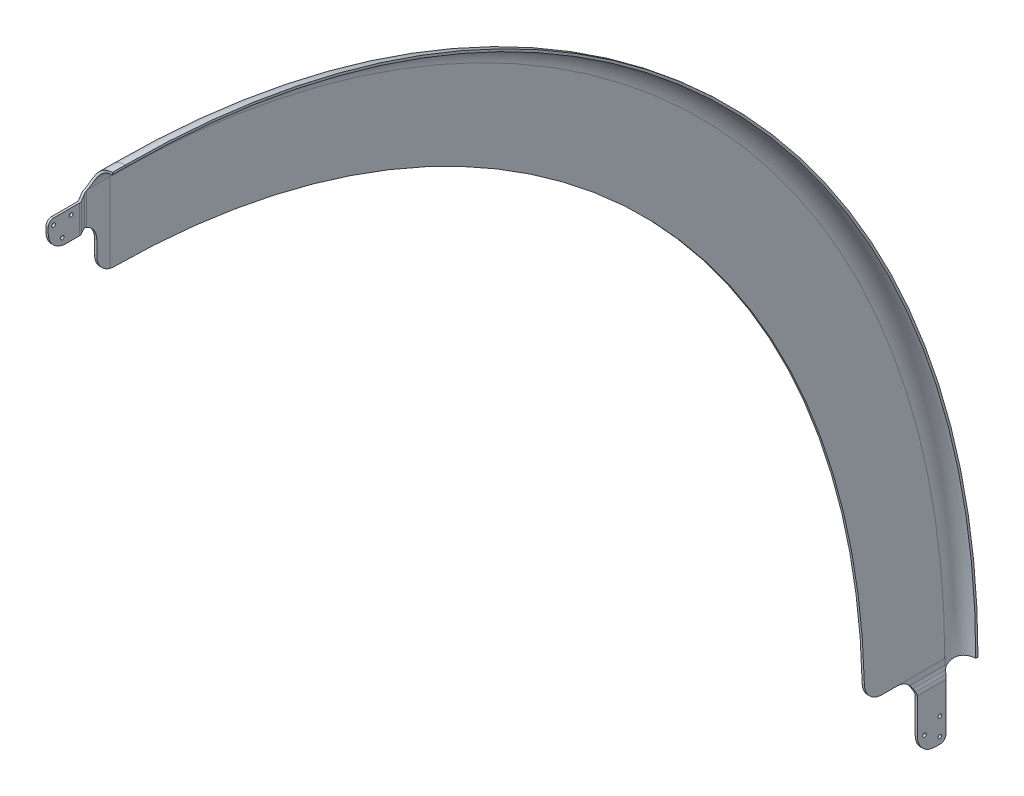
ISO-10303-21;
HEADER;
FILE_DESCRIPTION(('STEP AP214'),'2;1');
FILE_NAME('part.step','',(''),(''),'','','');
FILE_SCHEMA(('AUTOMOTIVE_DESIGN { 1 0 10303 214 1 1 1 1 }'));
ENDSEC;
DATA;
#1=APPLICATION_CONTEXT('core data for automotive mechanical design processes');
#2=APPLICATION_PROTOCOL_DEFINITION('international standard','automotive_design',2000,#1);
#3=PRODUCT_CONTEXT('',#1,'mechanical');
#4=PRODUCT('Part','Part','',(#3));
#5=PRODUCT_RELATED_PRODUCT_CATEGORY('part','',(#4));
#6=PRODUCT_DEFINITION_FORMATION('','',#4);
#7=PRODUCT_DEFINITION_CONTEXT('part definition',#1,'design');
#8=PRODUCT_DEFINITION('design','',#6,#7);
#9=PRODUCT_DEFINITION_SHAPE('','',#8);
#10=(LENGTH_UNIT() NAMED_UNIT(*) SI_UNIT(.MILLI.,.METRE.));
#11=(NAMED_UNIT(*) PLANE_ANGLE_UNIT() SI_UNIT($,.RADIAN.));
#12=(NAMED_UNIT(*) SI_UNIT($,.STERADIAN.) SOLID_ANGLE_UNIT());
#13=UNCERTAINTY_MEASURE_WITH_UNIT(LENGTH_MEASURE(1.E-05),#10,'distance_accuracy_value','');
#14=(GEOMETRIC_REPRESENTATION_CONTEXT(3) GLOBAL_UNCERTAINTY_ASSIGNED_CONTEXT((#13)) GLOBAL_UNIT_ASSIGNED_CONTEXT((#10,
#11,#12)) REPRESENTATION_CONTEXT('',''));
#15=CARTESIAN_POINT('',(0.,0.,0.));
#16=DIRECTION('',(0.,0.,1.));
#17=DIRECTION('',(1.,0.,0.));
#18=AXIS2_PLACEMENT_3D('',#15,#16,#17);
#19=CARTESIAN_POINT('',(-118.11,-404.9689,-645.3375));
#20=DIRECTION('',(-1.,0.,0.));
#21=DIRECTION('',(0.,0.,1.));
#22=AXIS2_PLACEMENT_3D('',#19,#20,#21);
#23=CYLINDRICAL_SURFACE('',#22,25.4);
#24=CARTESIAN_POINT('',(-116.944837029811,-384.204789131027,-630.708361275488));
#25=CARTESIAN_POINT('',(-117.021496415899,-384.349373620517,-630.503146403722));
#26=CARTESIAN_POINT('',(-117.095476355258,-384.497459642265,-630.299417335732));
#27=CARTESIAN_POINT('',(-117.237462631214,-384.800705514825,-629.895095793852));
#28=CARTESIAN_POINT('',(-117.305467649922,-384.955866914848,-629.694504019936));
#29=CARTESIAN_POINT('',(-117.499898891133,-385.432831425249,-629.096740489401));
#30=CARTESIAN_POINT('',(-117.616319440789,-385.765332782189,-628.704693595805));
#31=CARTESIAN_POINT('',(-117.817995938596,-386.462797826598,-627.931785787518));
#32=CARTESIAN_POINT('',(-117.902803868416,-386.828143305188,-627.551151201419));
#33=CARTESIAN_POINT('',(-118.032020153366,-387.585302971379,-626.810486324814));
#34=CARTESIAN_POINT('',(-118.076482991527,-387.977080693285,-626.450428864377));
#35=CARTESIAN_POINT('',(-118.109937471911,-388.633534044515,-625.884280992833));
#36=CARTESIAN_POINT('',(-118.113425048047,-388.891175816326,-625.670810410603));
#37=CARTESIAN_POINT('',(-118.09963627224,-389.414422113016,-625.254424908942));
#38=CARTESIAN_POINT('',(-118.082358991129,-389.680026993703,-625.051510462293));
#39=CARTESIAN_POINT('',(-118.02531713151,-390.215471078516,-624.658869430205));
#40=CARTESIAN_POINT('',(-117.985719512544,-390.485264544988,-624.469056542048));
#41=CARTESIAN_POINT('',(-117.882379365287,-391.028817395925,-624.102116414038));
#42=CARTESIAN_POINT('',(-117.818642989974,-391.30257575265,-623.9249859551));
#43=CARTESIAN_POINT('',(-117.688058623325,-391.77059184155,-623.634581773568));
#44=CARTESIAN_POINT('',(-117.627650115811,-391.964528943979,-623.517860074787));
#45=CARTESIAN_POINT('',(-117.493638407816,-392.351969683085,-623.291562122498));
#46=CARTESIAN_POINT('',(-117.420038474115,-392.545473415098,-623.181984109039));
#47=CARTESIAN_POINT('',(-117.258654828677,-392.932475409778,-622.969362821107));
#48=CARTESIAN_POINT('',(-117.170760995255,-393.125960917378,-622.866379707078));
#49=CARTESIAN_POINT('',(-116.981013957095,-393.510137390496,-622.668054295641));
#50=CARTESIAN_POINT('',(-116.879152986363,-393.700826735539,-622.572716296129));
#51=CARTESIAN_POINT('',(-116.770254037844,-393.889408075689,-622.481322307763));
#52=B_SPLINE_CURVE_WITH_KNOTS('',3,(#24,#25,#26,#27,#28,#29,#30,#31,#32,#33,#34,#35,#36,#37,#38,
#39,#40,#41,#42,#43,#44,#45,#46,#47,#48,#49,#50,#51),.UNSPECIFIED.,.F.,.F.,(4,2,2,2,2,2,2,2,2,2,
2,2,2,4),(0.,0.787350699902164,1.57487463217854,3.15418412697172,4.75509394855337,
6.35383862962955,7.3568784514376,8.35996315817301,9.35564235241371,10.3510679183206,
11.0534572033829,11.7556727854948,12.4635796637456,13.1718817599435),.UNSPECIFIED.);
#53=CARTESIAN_POINT('',(-118.049184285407,-389.990596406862,-624.823835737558));
#54=VERTEX_POINT('',#53);
#55=CARTESIAN_POINT('',(-116.770254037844,-393.889408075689,-622.481322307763));
#56=VERTEX_POINT('',#55);
#57=EDGE_CURVE('E1083',#54,#56,#52,.T.);
#58=ORIENTED_EDGE('',*,*,#57,.F.);
#59=CARTESIAN_POINT('',(-98.746981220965,-379.687058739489,-647.784641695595));
#60=CARTESIAN_POINT('',(-99.0194197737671,-379.680609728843,-647.717979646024));
#61=CARTESIAN_POINT('',(-99.2907296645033,-379.673983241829,-647.646810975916));
#62=CARTESIAN_POINT('',(-99.830841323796,-379.660626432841,-647.495529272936));
#63=CARTESIAN_POINT('',(-100.099643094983,-379.653896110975,-647.415416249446));
#64=CARTESIAN_POINT('',(-100.901831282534,-379.633928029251,-647.161788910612));
#65=CARTESIAN_POINT('',(-101.431081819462,-379.620911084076,-646.974966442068));
#66=CARTESIAN_POINT('',(-102.477492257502,-379.597804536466,-646.566124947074));
#67=CARTESIAN_POINT('',(-102.994615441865,-379.587722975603,-646.344011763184));
#68=CARTESIAN_POINT('',(-104.013077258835,-379.573270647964,-645.865893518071));
#69=CARTESIAN_POINT('',(-104.514415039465,-379.568900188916,-645.60988663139));
#70=CARTESIAN_POINT('',(-105.551507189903,-379.568899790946,-645.036078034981));
#71=CARTESIAN_POINT('',(-106.085233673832,-379.574251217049,-644.714598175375));
#72=CARTESIAN_POINT('',(-107.127414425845,-379.600109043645,-644.033438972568));
#73=CARTESIAN_POINT('',(-107.635867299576,-379.620616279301,-643.673757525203));
#74=CARTESIAN_POINT('',(-108.623990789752,-379.681485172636,-642.91883722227));
#75=CARTESIAN_POINT('',(-109.103678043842,-379.721835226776,-642.523619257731));
#76=CARTESIAN_POINT('',(-110.031328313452,-379.827210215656,-641.700534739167));
#77=CARTESIAN_POINT('',(-110.479292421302,-379.8922343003,-641.272669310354));
#78=CARTESIAN_POINT('',(-111.343288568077,-380.052266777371,-640.38512094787));
#79=CARTESIAN_POINT('',(-111.759078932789,-380.14747897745,-639.925238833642));
#80=CARTESIAN_POINT('',(-112.552239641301,-380.37228672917,-638.98124866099));
#81=CARTESIAN_POINT('',(-112.929608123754,-380.501883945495,-638.497139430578));
#82=CARTESIAN_POINT('',(-113.642879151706,-380.799170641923,-637.511334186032));
#83=CARTESIAN_POINT('',(-113.978832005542,-380.966813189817,-637.009660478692));
#84=CARTESIAN_POINT('',(-114.607953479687,-381.343223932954,-635.995132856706));
#85=CARTESIAN_POINT('',(-114.901134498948,-381.551980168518,-635.48228223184));
#86=CARTESIAN_POINT('',(-115.361515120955,-381.942328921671,-634.609440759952));
#87=CARTESIAN_POINT('',(-115.539925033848,-382.112899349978,-634.250356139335));
#88=CARTESIAN_POINT('',(-115.875899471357,-382.475052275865,-633.532914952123));
#89=CARTESIAN_POINT('',(-116.033460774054,-382.666638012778,-633.174558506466));
#90=CARTESIAN_POINT('',(-116.328104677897,-383.070727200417,-632.461240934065));
#91=CARTESIAN_POINT('',(-116.465187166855,-383.283230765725,-632.106279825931));
#92=CARTESIAN_POINT('',(-116.719579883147,-383.728746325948,-631.402312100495));
#93=CARTESIAN_POINT('',(-116.836892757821,-383.961755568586,-631.053304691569));
#94=CARTESIAN_POINT('',(-117.104329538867,-384.563882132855,-630.198691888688));
#95=CARTESIAN_POINT('',(-117.243369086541,-384.944859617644,-629.697894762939));
#96=CARTESIAN_POINT('',(-117.484592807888,-385.747880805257,-628.720860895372));
#97=CARTESIAN_POINT('',(-117.58676433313,-386.169938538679,-628.244632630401));
#98=CARTESIAN_POINT('',(-117.759254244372,-387.052469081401,-627.321679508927));
#99=CARTESIAN_POINT('',(-117.829524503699,-387.512998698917,-626.875000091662));
#100=CARTESIAN_POINT('',(-117.943308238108,-388.468345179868,-626.016417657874));
#101=CARTESIAN_POINT('',(-117.986823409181,-388.963159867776,-625.604512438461));
#102=CARTESIAN_POINT('',(-118.052317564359,-389.980074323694,-624.821550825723));
#103=CARTESIAN_POINT('',(-118.074439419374,-390.501968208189,-624.45023833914));
#104=CARTESIAN_POINT('',(-118.102839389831,-391.572592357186,-623.747945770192));
#105=CARTESIAN_POINT('',(-118.109117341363,-392.121322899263,-623.416966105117));
#106=CARTESIAN_POINT('',(-118.110708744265,-393.242352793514,-622.797349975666));
#107=CARTESIAN_POINT('',(-118.106019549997,-393.814657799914,-622.508723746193));
#108=CARTESIAN_POINT('',(-118.090116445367,-394.979350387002,-621.975583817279));
#109=CARTESIAN_POINT('',(-118.07890246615,-395.571738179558,-621.73107058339));
#110=CARTESIAN_POINT('',(-118.052811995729,-396.823535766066,-621.268960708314));
#111=CARTESIAN_POINT('',(-118.037707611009,-397.48440696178,-621.05532628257));
#112=CARTESIAN_POINT('',(-118.008551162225,-398.82156426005,-620.682844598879));
#113=CARTESIAN_POINT('',(-117.994499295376,-399.497853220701,-620.5240075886));
#114=CARTESIAN_POINT('',(-117.970562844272,-400.860103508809,-620.262450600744));
#115=CARTESIAN_POINT('',(-117.960671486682,-401.546047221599,-620.159639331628));
#116=CARTESIAN_POINT('',(-117.946974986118,-402.923821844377,-620.010492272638));
#117=CARTESIAN_POINT('',(-117.943166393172,-403.615649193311,-619.964124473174));
#118=CARTESIAN_POINT('',(-117.942565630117,-404.581196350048,-619.938987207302));
#119=CARTESIAN_POINT('',(-117.942921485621,-404.854457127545,-619.936287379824));
#120=CARTESIAN_POINT('',(-117.944657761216,-405.400605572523,-619.939703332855));
#121=CARTESIAN_POINT('',(-117.946037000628,-405.673493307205,-619.945808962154));
#122=CARTESIAN_POINT('',(-117.947914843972,-405.946238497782,-619.956309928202));
#123=B_SPLINE_CURVE_WITH_KNOTS('',3,(#59,#60,#61,#62,#63,#64,#65,#66,#67,#68,#69,#70,#71,#72,
#73,#74,#75,#76,#77,#78,#79,#80,#81,#82,#83,#84,#85,#86,#87,#88,#89,#90,#91,#92,#93,#94,#95,#96,
#97,#98,#99,#100,#101,#102,#103,#104,#105,#106,#107,#108,#109,#110,#111,#112,#113,#114,#115,
#116,#117,#118,#119,#120,#121,#122),.UNSPECIFIED.,.F.,.F.,(4,2,2,2,2,2,2,2,2,2,2,2,2,2,2,2,2,2,
2,2,2,2,2,2,2,2,2,2,2,2,2,4),(0.,0.841568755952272,1.68313662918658,3.36602186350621,
5.05347494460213,6.7410189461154,8.60844843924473,10.4759808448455,12.3424224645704,
14.2087997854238,16.0880558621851,17.967402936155,19.8444441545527,21.7209401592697,
23.0272176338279,24.3336967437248,25.6401830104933,26.946494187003,28.8766276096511,
30.8074225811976,32.7411207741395,34.6746963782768,36.5952679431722,38.5158593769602,
40.4369141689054,42.3579892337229,44.4397538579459,46.521907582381,48.6006583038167,
50.6782295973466,51.4979388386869,52.3167038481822),.UNSPECIFIED.);
#124=CARTESIAN_POINT('',(-105.006722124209,-379.5689,-645.3375));
#125=VERTEX_POINT('',#124);
#126=EDGE_CURVE('E782',#125,#54,#123,.T.);
#127=ORIENTED_EDGE('',*,*,#126,.F.);
#128=DIRECTION('',(1.,0.,0.));
#129=VECTOR('',#128,1.);
#130=CARTESIAN_POINT('',(-118.11,-379.5689,-645.3375));
#131=LINE('',#130,#129);
#132=CARTESIAN_POINT('',(-92.7099999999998,-379.5689,-645.3375));
#133=VERTEX_POINT('',#132);
#134=EDGE_CURVE('E598',#133,#125,#131,.F.);
#135=ORIENTED_EDGE('',*,*,#134,.F.);
#136=CARTESIAN_POINT('',(-114.831664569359,-389.472555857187,-625.212308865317));
#137=CARTESIAN_POINT('',(-114.815353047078,-389.251290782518,-625.382680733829));
#138=CARTESIAN_POINT('',(-114.796748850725,-389.032960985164,-625.556609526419));
#139=CARTESIAN_POINT('',(-114.754436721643,-388.602423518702,-625.911325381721));
#140=CARTESIAN_POINT('',(-114.730728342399,-388.390216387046,-626.092113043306));
#141=CARTESIAN_POINT('',(-114.651146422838,-387.762996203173,-626.644526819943));
#142=CARTESIAN_POINT('',(-114.586832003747,-387.357615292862,-627.026025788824));
#143=CARTESIAN_POINT('',(-114.431446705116,-386.574045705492,-627.813266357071));
#144=CARTESIAN_POINT('',(-114.34029399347,-386.195944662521,-628.219079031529));
#145=CARTESIAN_POINT('',(-114.12749168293,-385.470767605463,-629.04987594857));
#146=CARTESIAN_POINT('',(-114.005849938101,-385.123683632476,-629.474855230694));
#147=CARTESIAN_POINT('',(-113.727916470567,-384.460698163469,-630.341731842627));
#148=CARTESIAN_POINT('',(-113.571433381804,-384.14498337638,-630.783711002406));
#149=CARTESIAN_POINT('',(-113.221518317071,-383.548571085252,-631.676687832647));
#150=CARTESIAN_POINT('',(-113.028083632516,-383.267876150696,-632.127686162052));
#151=CARTESIAN_POINT('',(-112.603124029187,-382.743098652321,-633.031161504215));
#152=CARTESIAN_POINT('',(-112.371702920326,-382.498919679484,-633.483631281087));
#153=CARTESIAN_POINT('',(-111.869783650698,-382.046207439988,-634.38467564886));
#154=CARTESIAN_POINT('',(-111.599288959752,-381.837671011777,-634.833250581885));
#155=CARTESIAN_POINT('',(-111.044171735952,-381.471286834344,-635.682565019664));
#156=CARTESIAN_POINT('',(-110.762668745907,-381.310646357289,-636.084146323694));
#157=CARTESIAN_POINT('',(-110.168370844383,-381.016757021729,-636.873908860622));
#158=CARTESIAN_POINT('',(-109.855577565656,-380.883506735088,-637.26209079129));
#159=CARTESIAN_POINT('',(-109.199965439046,-380.64215273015,-638.021202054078));
#160=CARTESIAN_POINT('',(-108.857115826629,-380.53407520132,-638.392113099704));
#161=CARTESIAN_POINT('',(-108.143672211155,-380.34068098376,-639.112551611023));
#162=CARTESIAN_POINT('',(-107.773077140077,-380.255365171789,-639.462078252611));
#163=CARTESIAN_POINT('',(-106.999277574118,-380.103264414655,-640.142876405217));
#164=CARTESIAN_POINT('',(-106.595594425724,-380.036854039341,-640.473686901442));
#165=CARTESIAN_POINT('',(-105.764343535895,-379.921595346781,-641.107110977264));
#166=CARTESIAN_POINT('',(-105.336775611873,-379.872747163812,-641.409724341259));
#167=CARTESIAN_POINT('',(-104.460212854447,-379.789490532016,-641.984627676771));
#168=CARTESIAN_POINT('',(-104.011211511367,-379.75508650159,-642.256908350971));
#169=CARTESIAN_POINT('',(-103.094503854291,-379.697758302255,-642.769260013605));
#170=CARTESIAN_POINT('',(-102.626796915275,-379.674834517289,-643.009329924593));
#171=CARTESIAN_POINT('',(-101.622650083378,-379.635650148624,-643.480509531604));
#172=CARTESIAN_POINT('',(-101.084326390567,-379.620405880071,-643.707697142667));
#173=CARTESIAN_POINT('',(-99.9912554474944,-379.597304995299,-644.119047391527));
#174=CARTESIAN_POINT('',(-99.4365054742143,-379.589449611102,-644.303202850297));
#175=CARTESIAN_POINT('',(-98.3146269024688,-379.57831843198,-644.62713239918));
#176=CARTESIAN_POINT('',(-97.7475082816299,-379.575039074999,-644.766940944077));
#177=CARTESIAN_POINT('',(-96.6042307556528,-379.570851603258,-645.001445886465));
#178=CARTESIAN_POINT('',(-96.0280755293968,-379.569942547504,-645.096160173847));
#179=CARTESIAN_POINT('',(-94.9944972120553,-379.569090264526,-645.224523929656));
#180=CARTESIAN_POINT('',(-94.5381471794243,-379.568981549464,-645.266919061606));
#181=CARTESIAN_POINT('',(-93.8527624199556,-379.568912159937,-645.309279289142));
#182=CARTESIAN_POINT('',(-93.6243477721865,-379.568904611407,-645.319860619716));
#183=CARTESIAN_POINT('',(-93.1672927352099,-379.568899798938,-645.333971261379));
#184=CARTESIAN_POINT('',(-92.9386523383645,-379.568902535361,-645.33750032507));
#185=CARTESIAN_POINT('',(-92.7099999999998,-379.5689,-645.3375));
#186=B_SPLINE_CURVE_WITH_KNOTS('',3,(#136,#137,#138,#139,#140,#141,#142,#143,#144,#145,#146,
#147,#148,#149,#150,#151,#152,#153,#154,#155,#156,#157,#158,#159,#160,#161,#162,#163,#164,#165,
#166,#167,#168,#169,#170,#171,#172,#173,#174,#175,#176,#177,#178,#179,#180,#181,#182,#183,#184,
#185),.UNSPECIFIED.,.F.,.F.,(4,2,2,2,2,2,2,2,2,2,2,2,2,2,2,2,2,2,2,2,2,2,2,2,4),(0.,
0.839105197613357,1.67828382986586,3.35751470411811,5.04191966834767,6.72589117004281,
8.41935063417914,10.112934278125,11.8019644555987,13.4908447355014,15.0371744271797,
16.5834234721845,18.131274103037,19.6791843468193,21.2559128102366,22.832653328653,
24.4098758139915,25.9871510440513,27.7387321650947,29.4906052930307,31.2411139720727,
32.9909276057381,34.3649699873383,35.0508518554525,35.7367577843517),.UNSPECIFIED.);
#187=CARTESIAN_POINT('',(-114.831664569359,-389.472555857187,-625.212308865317));
#188=VERTEX_POINT('',#187);
#189=EDGE_CURVE('E778',#188,#133,#186,.T.);
#190=ORIENTED_EDGE('',*,*,#189,.F.);
#191=CARTESIAN_POINT('',(-113.595254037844,-393.03866938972,-622.913637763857));
#192=CARTESIAN_POINT('',(-113.679855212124,-392.892142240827,-622.991590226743));
#193=CARTESIAN_POINT('',(-113.760143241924,-392.744483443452,-623.071997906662));
#194=CARTESIAN_POINT('',(-113.912182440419,-392.447524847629,-623.237635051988));
#195=CARTESIAN_POINT('',(-113.983935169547,-392.298225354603,-623.322863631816));
#196=CARTESIAN_POINT('',(-114.185246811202,-391.851649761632,-623.583977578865));
#197=CARTESIAN_POINT('',(-114.302508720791,-391.552806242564,-623.766820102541));
#198=CARTESIAN_POINT('',(-114.505283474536,-390.95570869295,-624.149855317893));
#199=CARTESIAN_POINT('',(-114.590805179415,-390.65745452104,-624.350043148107));
#200=CARTESIAN_POINT('',(-114.697211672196,-390.211886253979,-624.663264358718));
#201=CARTESIAN_POINT('',(-114.729136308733,-390.062939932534,-624.770385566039));
#202=CARTESIAN_POINT('',(-114.785746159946,-389.766543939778,-624.988489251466));
#203=CARTESIAN_POINT('',(-114.810432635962,-389.61909401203,-625.09947105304));
#204=CARTESIAN_POINT('',(-114.831664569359,-389.472555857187,-625.212308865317));
#205=B_SPLINE_CURVE_WITH_KNOTS('',3,(#191,#192,#193,#194,#195,#196,#197,#198,#199,#200,#201,
#202,#203,#204),.UNSPECIFIED.,.F.,.F.,(4,2,2,2,2,2,4),(0.,0.558726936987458,1.11735156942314,
2.22366930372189,3.32967796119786,3.88818640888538,4.44659747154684),.UNSPECIFIED.);
#206=CARTESIAN_POINT('',(-113.595254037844,-393.03866938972,-622.913637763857));
#207=VERTEX_POINT('',#206);
#208=EDGE_CURVE('E779',#207,#188,#205,.T.);
#209=ORIENTED_EDGE('',*,*,#208,.F.);
#210=CARTESIAN_POINT('',(-106.707332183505,-404.9689,-645.3375));
#211=DIRECTION('',(0.86602540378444,0.499999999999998,0.));
#212=DIRECTION('',(-0.499999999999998,0.86602540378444,0.));
#213=AXIS2_PLACEMENT_3D('',#210,#211,#212);
#214=ELLIPSE('',#213,29.3293936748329,25.4);
#215=CARTESIAN_POINT('',(-111.512245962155,-396.646545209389,-621.339616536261));
#216=VERTEX_POINT('',#215);
#217=EDGE_CURVE('E669',#216,#207,#214,.F.);
#218=ORIENTED_EDGE('',*,*,#217,.F.);
#219=CARTESIAN_POINT('',(-110.1725,-401.646545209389,-620.155721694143));
#220=CARTESIAN_POINT('',(-110.172499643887,-401.5052092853,-620.174367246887));
#221=CARTESIAN_POINT('',(-110.175496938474,-401.364052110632,-620.194203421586));
#222=CARTESIAN_POINT('',(-110.187433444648,-401.082342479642,-620.236206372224));
#223=CARTESIAN_POINT('',(-110.19637241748,-400.94178999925,-620.258373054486));
#224=CARTESIAN_POINT('',(-110.232011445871,-400.521519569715,-620.328274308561));
#225=CARTESIAN_POINT('',(-110.267533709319,-400.243060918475,-620.379426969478));
#226=CARTESIAN_POINT('',(-110.360406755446,-399.697776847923,-620.48893913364));
#227=CARTESIAN_POINT('',(-110.417267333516,-399.430830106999,-620.547118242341));
#228=CARTESIAN_POINT('',(-110.552068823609,-398.904070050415,-620.67070113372));
#229=CARTESIAN_POINT('',(-110.630004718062,-398.644255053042,-620.736103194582));
#230=CARTESIAN_POINT('',(-110.770082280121,-398.23771816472,-620.845139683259));
#231=CARTESIAN_POINT('',(-110.825670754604,-398.088153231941,-620.88675253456));
#232=CARTESIAN_POINT('',(-110.943707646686,-397.792361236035,-620.971931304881));
#233=CARTESIAN_POINT('',(-111.006154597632,-397.646133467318,-621.01549680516));
#234=CARTESIAN_POINT('',(-111.205236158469,-397.209020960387,-621.14993678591));
#235=CARTESIAN_POINT('',(-111.352253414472,-396.923641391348,-621.243491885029));
#236=CARTESIAN_POINT('',(-111.512245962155,-396.646545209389,-621.339616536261));
#237=B_SPLINE_CURVE_WITH_KNOTS('',3,(#219,#220,#221,#222,#223,#224,#225,#226,#227,#228,#229,
#230,#231,#232,#233,#234,#235,#236),.UNSPECIFIED.,.F.,.F.,(4,2,2,2,2,2,2,2,4),(0.,
0.427603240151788,0.855189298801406,1.70997634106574,2.54622186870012,3.38226847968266,
3.87679359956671,4.3712131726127,5.37288418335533),.UNSPECIFIED.);
#238=CARTESIAN_POINT('',(-110.1725,-401.646545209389,-620.155721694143));
#239=VERTEX_POINT('',#238);
#240=EDGE_CURVE('E660',#239,#216,#237,.T.);
#241=ORIENTED_EDGE('',*,*,#240,.F.);
#242=CARTESIAN_POINT('',(-110.1725,-404.9689,-645.3375));
#243=DIRECTION('',(1.,0.,0.));
#244=DIRECTION('',(0.,1.,0.));
#245=AXIS2_PLACEMENT_3D('',#242,#243,#244);
#246=CIRCLE('',#245,25.4);
#247=CARTESIAN_POINT('',(-110.1725,-404.9689,-619.9375));
#248=VERTEX_POINT('',#247);
#249=EDGE_CURVE('E653',#248,#239,#246,.F.);
#250=ORIENTED_EDGE('',*,*,#249,.F.);
#251=DIRECTION('',(1.,0.,0.));
#252=VECTOR('',#251,1.);
#253=CARTESIAN_POINT('',(-114.935,-404.9689,-619.9375));
#254=LINE('',#253,#252);
#255=CARTESIAN_POINT('',(-113.3475,-404.9689,-619.9375));
#256=VERTEX_POINT('',#255);
#257=EDGE_CURVE('E597',#256,#248,#254,.T.);
#258=ORIENTED_EDGE('',*,*,#257,.F.);
#259=CARTESIAN_POINT('',(-113.3475,-404.9689,-645.3375));
#260=DIRECTION('',(-1.,0.,0.));
#261=DIRECTION('',(0.,0.,1.));
#262=AXIS2_PLACEMENT_3D('',#259,#260,#261);
#263=CIRCLE('',#262,25.4);
#264=CARTESIAN_POINT('',(-113.3475,-402.497283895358,-620.058039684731));
#265=VERTEX_POINT('',#264);
#266=EDGE_CURVE('E746',#265,#256,#263,.F.);
#267=ORIENTED_EDGE('',*,*,#266,.F.);
#268=CARTESIAN_POINT('',(-114.687245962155,-397.497283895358,-621.061278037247));
#269=CARTESIAN_POINT('',(-114.551405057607,-397.732535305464,-620.988845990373));
#270=CARTESIAN_POINT('',(-114.424899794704,-397.973820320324,-620.918354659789));
#271=CARTESIAN_POINT('',(-114.191452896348,-398.467238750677,-620.78238696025));
#272=CARTESIAN_POINT('',(-114.084524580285,-398.719379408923,-620.716914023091));
#273=CARTESIAN_POINT('',(-113.893489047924,-399.227177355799,-620.593623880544));
#274=CARTESIAN_POINT('',(-113.808921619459,-399.482627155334,-620.535667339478));
#275=CARTESIAN_POINT('',(-113.660401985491,-400.000736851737,-620.426710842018));
#276=CARTESIAN_POINT('',(-113.596439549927,-400.263393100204,-620.375707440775));
#277=CARTESIAN_POINT('',(-113.478940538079,-400.848709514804,-620.27179972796));
#278=CARTESIAN_POINT('',(-113.430200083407,-401.172670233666,-620.220634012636));
#279=CARTESIAN_POINT('',(-113.380854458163,-401.664411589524,-620.15281539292));
#280=CARTESIAN_POINT('',(-113.368364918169,-401.830464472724,-620.131582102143));
#281=CARTESIAN_POINT('',(-113.351687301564,-402.163372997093,-620.09235934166));
#282=CARTESIAN_POINT('',(-113.347499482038,-402.330228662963,-620.074369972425));
#283=CARTESIAN_POINT('',(-113.3475,-402.497283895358,-620.058039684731));
#284=B_SPLINE_CURVE_WITH_KNOTS('',3,(#268,#269,#270,#271,#272,#273,#274,#275,#276,#277,#278,
#279,#280,#281,#282,#283),.UNSPECIFIED.,.F.,.F.,(4,2,2,2,2,2,2,4),(0.,0.843267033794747,
1.68710567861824,2.51191718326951,3.33631854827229,4.32906444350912,4.83247051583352,
5.33589217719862),.UNSPECIFIED.);
#285=CARTESIAN_POINT('',(-114.687245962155,-397.497283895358,-621.061278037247));
#286=VERTEX_POINT('',#285);
#287=EDGE_CURVE('E737',#286,#265,#284,.T.);
#288=ORIENTED_EDGE('',*,*,#287,.F.);
#289=CARTESIAN_POINT('',(-110.373506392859,-404.9689,-645.3375));
#290=DIRECTION('',(-0.866025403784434,-0.500000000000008,0.));
#291=DIRECTION('',(-0.500000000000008,0.866025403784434,0.));
#292=AXIS2_PLACEMENT_3D('',#289,#290,#291);
#293=ELLIPSE('',#292,29.3293936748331,25.4);
#294=EDGE_CURVE('E750',#56,#286,#293,.F.);
#295=ORIENTED_EDGE('',*,*,#294,.F.);
#296=EDGE_LOOP('',(#58,#127,#135,#190,#209,#218,#241,#250,#258,#267,#288,#295));
#297=FACE_BOUND('',#296,.T.);
#298=ADVANCED_FACE('F50',(#297),#23,.F.);
#299=CARTESIAN_POINT('',(-92.7099999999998,-379.5689,574.18));
#300=DIRECTION('',(1.,0.,0.));
#301=DIRECTION('',(0.,0.,-1.));
#302=AXIS2_PLACEMENT_3D('',#299,#300,#301);
#303=TOROIDAL_SURFACE('',#302,1197.2925,25.4);
#304=CARTESIAN_POINT('',(-92.7099999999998,-379.5689,-623.1125));
#305=DIRECTION('',(0.,1.,0.));
#306=DIRECTION('',(0.,0.,1.));
#307=AXIS2_PLACEMENT_3D('',#304,#305,#306);
#308=CIRCLE('',#307,25.4);
#309=CARTESIAN_POINT('',(-92.7099999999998,-379.5689,-648.5125));
#310=VERTEX_POINT('',#309);
#311=EDGE_CURVE('E487',#310,#125,#308,.T.);
#312=ORIENTED_EDGE('',*,*,#311,.T.);
#313=ORIENTED_EDGE('',*,*,#126,.T.);
#314=CARTESIAN_POINT('',(-118.086887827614,-389.5689,-624.154087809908));
#315=CARTESIAN_POINT('',(-118.071617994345,-389.792999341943,-624.509766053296));
#316=CARTESIAN_POINT('',(-118.048795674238,-390.016816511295,-624.865301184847));
#317=CARTESIAN_POINT('',(-117.98794626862,-390.463247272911,-625.575841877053));
#318=CARTESIAN_POINT('',(-117.949918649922,-390.685860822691,-625.930847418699));
#319=CARTESIAN_POINT('',(-117.858505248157,-391.129494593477,-626.64048495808));
#320=CARTESIAN_POINT('',(-117.80510114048,-391.350512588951,-626.995116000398));
#321=CARTESIAN_POINT('',(-117.682810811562,-391.78997951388,-627.703277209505));
#322=CARTESIAN_POINT('',(-117.61392446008,-392.008428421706,-628.056807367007));
#323=CARTESIAN_POINT('',(-117.382250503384,-392.663160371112,-629.122335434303));
#324=CARTESIAN_POINT('',(-117.195331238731,-393.094466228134,-629.832326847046));
#325=CARTESIAN_POINT('',(-116.755795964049,-393.936761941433,-631.24353901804));
#326=CARTESIAN_POINT('',(-116.503216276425,-394.347762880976,-631.944764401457));
#327=CARTESIAN_POINT('',(-116.005587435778,-395.036724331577,-633.151783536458));
#328=CARTESIAN_POINT('',(-115.77613514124,-395.321174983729,-633.660324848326));
#329=CARTESIAN_POINT('',(-115.279250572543,-395.870744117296,-634.669176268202));
#330=CARTESIAN_POINT('',(-115.011827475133,-396.135867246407,-635.16948833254));
#331=CARTESIAN_POINT('',(-114.438737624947,-396.641353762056,-636.158408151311));
#332=CARTESIAN_POINT('',(-114.133183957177,-396.88178668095,-636.647045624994));
#333=CARTESIAN_POINT('',(-113.482371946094,-397.333005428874,-637.611394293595));
#334=CARTESIAN_POINT('',(-113.137126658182,-397.543800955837,-638.087109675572));
#335=CARTESIAN_POINT('',(-112.506371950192,-397.87617226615,-638.89451926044));
#336=CARTESIAN_POINT('',(-112.230309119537,-398.006389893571,-639.230055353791));
#337=CARTESIAN_POINT('',(-111.657098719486,-398.244319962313,-639.89104912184));
#338=CARTESIAN_POINT('',(-111.359951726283,-398.352033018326,-640.216507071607));
#339=CARTESIAN_POINT('',(-110.745361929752,-398.541256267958,-640.855250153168));
#340=CARTESIAN_POINT('',(-110.427934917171,-398.622786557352,-641.168544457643));
#341=CARTESIAN_POINT('',(-109.773752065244,-398.755676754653,-641.781060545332));
#342=CARTESIAN_POINT('',(-109.437001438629,-398.807044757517,-642.080286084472));
#343=CARTESIAN_POINT('',(-108.826547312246,-398.86725885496,-642.594575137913));
#344=CARTESIAN_POINT('',(-108.556391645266,-398.883215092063,-642.813029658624));
#345=CARTESIAN_POINT('',(-108.007272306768,-398.89264821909,-643.239044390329));
#346=CARTESIAN_POINT('',(-107.728310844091,-398.886130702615,-643.446607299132));
#347=CARTESIAN_POINT('',(-107.163589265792,-398.848540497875,-643.84948822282));
#348=CARTESIAN_POINT('',(-106.877834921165,-398.8174879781,-644.044816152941));
#349=CARTESIAN_POINT('',(-106.301678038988,-398.72886313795,-644.422186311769));
#350=CARTESIAN_POINT('',(-106.011276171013,-398.671294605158,-644.604230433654));
#351=CARTESIAN_POINT('',(-105.472713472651,-398.538739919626,-644.927528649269));
#352=CARTESIAN_POINT('',(-105.224787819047,-398.467690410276,-645.070793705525));
#353=CARTESIAN_POINT('',(-104.729807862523,-398.304406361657,-645.346353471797));
#354=CARTESIAN_POINT('',(-104.482753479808,-398.212173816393,-645.478649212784));
#355=CARTESIAN_POINT('',(-103.99190994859,-398.005995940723,-645.731798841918));
#356=CARTESIAN_POINT('',(-103.748120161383,-397.892054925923,-645.852654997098));
#357=CARTESIAN_POINT('',(-103.266299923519,-397.642247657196,-646.082683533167));
#358=CARTESIAN_POINT('',(-103.028269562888,-397.506381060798,-646.191855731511));
#359=CARTESIAN_POINT('',(-102.559709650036,-397.212332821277,-646.398853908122));
#360=CARTESIAN_POINT('',(-102.329213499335,-397.054065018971,-646.496633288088));
#361=CARTESIAN_POINT('',(-101.879424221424,-396.716223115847,-646.680497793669));
#362=CARTESIAN_POINT('',(-101.660131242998,-396.536648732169,-646.766582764));
#363=CARTESIAN_POINT('',(-101.235384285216,-396.157197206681,-646.927425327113));
#364=CARTESIAN_POINT('',(-101.02993037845,-395.957319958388,-647.00218286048));
#365=CARTESIAN_POINT('',(-100.635336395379,-395.538629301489,-647.140922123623));
#366=CARTESIAN_POINT('',(-100.4461954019,-395.319816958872,-647.204904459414));
#367=CARTESIAN_POINT('',(-100.099321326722,-394.881197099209,-647.318574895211));
#368=CARTESIAN_POINT('',(-99.9403096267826,-394.662578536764,-647.368957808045));
#369=CARTESIAN_POINT('',(-99.6398461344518,-394.211983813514,-647.461657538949));
#370=CARTESIAN_POINT('',(-99.4983934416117,-393.980008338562,-647.503974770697));
#371=CARTESIAN_POINT('',(-99.2344144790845,-393.504379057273,-647.581182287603));
#372=CARTESIAN_POINT('',(-99.1118865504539,-393.260726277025,-647.616073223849));
#373=CARTESIAN_POINT('',(-98.8868772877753,-392.76348572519,-647.679054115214));
#374=CARTESIAN_POINT('',(-98.7843961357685,-392.509897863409,-647.707144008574));
#375=CARTESIAN_POINT('',(-98.601326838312,-391.997217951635,-647.756834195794));
#376=CARTESIAN_POINT('',(-98.5205294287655,-391.738206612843,-647.778496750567));
#377=CARTESIAN_POINT('',(-98.3801777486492,-391.214092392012,-647.816167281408));
#378=CARTESIAN_POINT('',(-98.3206232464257,-390.948989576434,-647.83217531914));
#379=CARTESIAN_POINT('',(-98.2232551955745,-390.414549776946,-647.858887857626));
#380=CARTESIAN_POINT('',(-98.1854423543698,-390.145212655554,-647.86959218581));
#381=CARTESIAN_POINT('',(-98.1318756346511,-389.604199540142,-647.885919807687));
#382=CARTESIAN_POINT('',(-98.1161219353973,-389.332523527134,-647.891543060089));
#383=CARTESIAN_POINT('',(-98.1067762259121,-388.786765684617,-647.897815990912));
#384=CARTESIAN_POINT('',(-98.1133452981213,-388.512680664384,-647.89842940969));
#385=CARTESIAN_POINT('',(-98.1489576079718,-387.966009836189,-647.8945276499));
#386=CARTESIAN_POINT('',(-98.1780009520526,-387.693424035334,-647.890012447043));
#387=CARTESIAN_POINT('',(-98.2583349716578,-387.151685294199,-647.875647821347));
#388=CARTESIAN_POINT('',(-98.3096261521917,-386.882532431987,-647.865798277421));
#389=CARTESIAN_POINT('',(-98.4340395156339,-386.349592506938,-647.840422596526));
#390=CARTESIAN_POINT('',(-98.5071616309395,-386.085805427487,-647.824896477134));
#391=CARTESIAN_POINT('',(-98.6745619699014,-385.565692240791,-647.787717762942));
#392=CARTESIAN_POINT('',(-98.7688243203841,-385.309360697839,-647.766069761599));
#393=CARTESIAN_POINT('',(-98.9777204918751,-384.80581053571,-647.716080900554));
#394=CARTESIAN_POINT('',(-99.0923543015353,-384.558591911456,-647.687740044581));
#395=CARTESIAN_POINT('',(-99.3409472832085,-384.075096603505,-647.62373822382));
#396=CARTESIAN_POINT('',(-99.4749040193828,-383.838818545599,-647.588078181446));
#397=CARTESIAN_POINT('',(-99.7609005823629,-383.378884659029,-647.50877055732));
#398=CARTESIAN_POINT('',(-99.9129402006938,-383.155228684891,-647.465123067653));
#399=CARTESIAN_POINT('',(-100.231919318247,-382.72443343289,-647.369691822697));
#400=CARTESIAN_POINT('',(-100.39868313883,-382.517143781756,-647.31799954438));
#401=CARTESIAN_POINT('',(-100.746826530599,-382.117862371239,-647.205559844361));
#402=CARTESIAN_POINT('',(-100.928205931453,-381.925870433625,-647.14481252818));
#403=CARTESIAN_POINT('',(-101.303726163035,-381.558402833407,-647.013768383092));
#404=CARTESIAN_POINT('',(-101.49786490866,-381.382924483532,-646.943473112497));
#405=CARTESIAN_POINT('',(-101.896955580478,-381.049401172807,-646.792942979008));
#406=CARTESIAN_POINT('',(-102.101907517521,-380.891356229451,-646.71270810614));
#407=CARTESIAN_POINT('',(-102.520124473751,-380.593683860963,-646.542238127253));
#408=CARTESIAN_POINT('',(-102.733371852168,-380.454019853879,-646.452023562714));
#409=CARTESIAN_POINT('',(-103.166463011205,-380.193124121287,-646.261394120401));
#410=CARTESIAN_POINT('',(-103.386306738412,-380.071892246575,-646.160979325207));
#411=CARTESIAN_POINT('',(-103.83052701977,-379.847948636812,-645.950037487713));
#412=CARTESIAN_POINT('',(-104.054903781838,-379.745237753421,-645.839509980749));
#413=CARTESIAN_POINT('',(-104.506215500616,-379.558147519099,-645.608582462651));
#414=CARTESIAN_POINT('',(-104.733150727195,-379.473770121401,-645.48818140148));
#415=CARTESIAN_POINT('',(-105.200496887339,-379.318683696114,-645.230853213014));
#416=CARTESIAN_POINT('',(-105.440948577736,-379.249008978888,-645.093377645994));
#417=CARTESIAN_POINT('',(-105.920680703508,-379.12887332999,-644.80840710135));
#418=CARTESIAN_POINT('',(-106.159961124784,-379.078412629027,-644.660912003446));
#419=CARTESIAN_POINT('',(-106.635754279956,-378.995727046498,-644.356497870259));
#420=CARTESIAN_POINT('',(-106.87226605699,-378.96350829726,-644.199575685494));
#421=CARTESIAN_POINT('',(-107.341053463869,-378.916231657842,-643.877037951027));
#422=CARTESIAN_POINT('',(-107.573328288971,-378.901176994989,-643.711420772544));
#423=CARTESIAN_POINT('',(-108.138923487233,-378.883802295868,-643.293552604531));
#424=CARTESIAN_POINT('',(-108.469177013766,-378.890619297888,-643.036727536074));
#425=CARTESIAN_POINT('',(-109.115395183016,-378.934802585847,-642.508146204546));
#426=CARTESIAN_POINT('',(-109.431354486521,-378.972180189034,-642.236384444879));
#427=CARTESIAN_POINT('',(-110.047655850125,-379.073951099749,-641.67953419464));
#428=CARTESIAN_POINT('',(-110.347970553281,-379.138390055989,-641.394423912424));
#429=CARTESIAN_POINT('',(-110.931286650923,-379.290906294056,-640.813158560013));
#430=CARTESIAN_POINT('',(-111.214287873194,-379.378983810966,-640.517003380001));
#431=CARTESIAN_POINT('',(-111.876518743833,-379.616682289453,-639.789937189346));
#432=CARTESIAN_POINT('',(-112.246792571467,-379.776661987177,-639.354228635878));
#433=CARTESIAN_POINT('',(-112.951100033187,-380.130460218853,-638.467472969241));
#434=CARTESIAN_POINT('',(-113.285116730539,-380.324294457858,-638.01641881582));
#435=CARTESIAN_POINT('',(-113.917794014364,-380.739986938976,-637.101212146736));
#436=CARTESIAN_POINT('',(-114.216383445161,-380.961899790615,-636.637035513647));
#437=CARTESIAN_POINT('',(-114.778171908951,-381.428260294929,-635.698958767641));
#438=CARTESIAN_POINT('',(-115.041379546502,-381.672702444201,-635.225061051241));
#439=CARTESIAN_POINT('',(-115.458121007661,-382.10227227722,-634.415690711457));
#440=CARTESIAN_POINT('',(-115.620568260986,-382.282659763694,-634.082236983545));
#441=CARTESIAN_POINT('',(-115.929248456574,-382.651051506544,-633.412088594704));
#442=CARTESIAN_POINT('',(-116.075482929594,-382.839055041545,-633.07539424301));
#443=CARTESIAN_POINT('',(-116.35109033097,-383.220248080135,-632.401615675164));
#444=CARTESIAN_POINT('',(-116.480575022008,-383.413391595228,-632.064550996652));
#445=CARTESIAN_POINT('',(-116.724164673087,-383.805186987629,-631.388102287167));
#446=CARTESIAN_POINT('',(-116.838270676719,-384.003838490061,-631.048718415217));
#447=CARTESIAN_POINT('',(-116.944837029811,-384.204789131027,-630.708361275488));
#448=B_SPLINE_CURVE_WITH_KNOTS('',3,(#314,#315,#316,#317,#318,#319,#320,#321,#322,#323,#324,
#325,#326,#327,#328,#329,#330,#331,#332,#333,#334,#335,#336,#337,#338,#339,#340,#341,#342,#343,
#344,#345,#346,#347,#348,#349,#350,#351,#352,#353,#354,#355,#356,#357,#358,#359,#360,#361,#362,
#363,#364,#365,#366,#367,#368,#369,#370,#371,#372,#373,#374,#375,#376,#377,#378,#379,#380,#381,
#382,#383,#384,#385,#386,#387,#388,#389,#390,#391,#392,#393,#394,#395,#396,#397,#398,#399,#400,
#401,#402,#403,#404,#405,#406,#407,#408,#409,#410,#411,#412,#413,#414,#415,#416,#417,#418,#419,
#420,#421,#422,#423,#424,#425,#426,#427,#428,#429,#430,#431,#432,#433,#434,#435,#436,#437,#438,
#439,#440,#441,#442,#443,#444,#445,#446,#447),.UNSPECIFIED.,.F.,.F.,(4,2,2,2,2,2,2,2,2,2,2,2,2,
2,2,2,2,2,2,2,2,2,2,2,2,2,2,2,2,2,2,2,2,2,2,2,2,2,2,2,2,2,2,2,2,2,2,2,2,2,2,2,2,2,2,2,2,2,2,2,2,
2,2,2,2,2,4),(0.,1.26193561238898,2.52391547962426,3.7874055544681,5.05090625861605,
7.60258814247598,10.1528614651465,12.0302452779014,13.9071761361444,15.7786672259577,
17.6495444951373,19.0093281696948,20.3690746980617,21.7277750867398,23.0861106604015,
24.1285923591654,25.1708146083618,26.2121810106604,27.2533987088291,28.1375732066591,
29.0216645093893,29.9055802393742,30.7895097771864,31.6769364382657,32.5643748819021,
33.4518179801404,34.3392111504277,35.1631783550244,35.9871032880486,36.810955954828,
37.634816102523,38.4504134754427,39.2660019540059,40.081616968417,40.8972386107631,
41.7187582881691,42.5402818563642,43.3618240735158,44.1833637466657,45.0042886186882,
45.8252130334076,46.6460340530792,47.4668456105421,48.2789268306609,49.0909985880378,
49.9029379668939,50.7148781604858,51.525177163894,52.3354696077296,53.1457993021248,
53.9562152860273,54.8121642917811,55.6681235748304,56.5243704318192,57.3807782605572,
58.634141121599,59.8879683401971,61.1439191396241,62.3998824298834,64.1784327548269,
65.9578103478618,67.7407033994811,69.5231620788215,70.7601521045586,71.9970252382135,
73.2251652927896,74.4532219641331),.UNSPECIFIED.);
#449=CARTESIAN_POINT('',(-118.086887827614,-389.5689,-624.154087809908));
#450=VERTEX_POINT('',#449);
#451=EDGE_CURVE('E1027',#450,#54,#448,.T.);
#452=ORIENTED_EDGE('',*,*,#451,.F.);
#453=CARTESIAN_POINT('',(-118.11,-389.5689,-623.070738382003));
#454=CARTESIAN_POINT('',(-118.109994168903,-389.5689,-623.415936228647));
#455=CARTESIAN_POINT('',(-118.102966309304,-389.5689,-623.76084779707));
#456=CARTESIAN_POINT('',(-118.074866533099,-389.5689,-624.450098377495));
#457=CARTESIAN_POINT('',(-118.053794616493,-389.5689,-624.794437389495));
#458=CARTESIAN_POINT('',(-118.025700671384,-389.5689,-625.138490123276));
#459=B_SPLINE_CURVE_WITH_KNOTS('',3,(#453,#454,#455,#456,#457,#458),.UNSPECIFIED.,.F.,.F.,(4,2,
4),(0.,1.03494948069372,2.06989896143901),.UNSPECIFIED.);
#460=CARTESIAN_POINT('',(-118.11,-389.5689,-623.070738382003));
#461=VERTEX_POINT('',#460);
#462=EDGE_CURVE('E815',#461,#450,#459,.T.);
#463=ORIENTED_EDGE('',*,*,#462,.F.);
#464=CARTESIAN_POINT('',(-118.11,-379.5689,574.18));
#465=DIRECTION('',(1.,0.,0.));
#466=DIRECTION('',(0.,0.,-1.));
#467=AXIS2_PLACEMENT_3D('',#464,#465,#466);
#468=CIRCLE('',#467,1197.2925);
#469=CARTESIAN_POINT('',(-118.11,-379.5689,-623.1125));
#470=VERTEX_POINT('',#469);
#471=EDGE_CURVE('E814',#470,#461,#468,.F.);
#472=ORIENTED_EDGE('',*,*,#471,.F.);
#473=CARTESIAN_POINT('',(-118.11,-379.5689,574.18));
#474=DIRECTION('',(1.,0.,0.));
#475=DIRECTION('',(0.,0.,-1.));
#476=AXIS2_PLACEMENT_3D('',#473,#474,#475);
#477=CIRCLE('',#476,1197.2925);
#478=CARTESIAN_POINT('',(-118.11,817.7236,574.18));
#479=VERTEX_POINT('',#478);
#480=EDGE_CURVE('E492',#470,#479,#477,.T.);
#481=ORIENTED_EDGE('',*,*,#480,.T.);
#482=CARTESIAN_POINT('',(-92.7099999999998,817.7236,574.18));
#483=DIRECTION('',(0.,0.,1.));
#484=DIRECTION('',(0.,-1.,0.));
#485=AXIS2_PLACEMENT_3D('',#482,#483,#484);
#486=CIRCLE('',#485,25.4);
#487=CARTESIAN_POINT('',(-92.7099999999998,843.1236,574.18));
#488=VERTEX_POINT('',#487);
#489=EDGE_CURVE('E493',#488,#479,#486,.T.);
#490=ORIENTED_EDGE('',*,*,#489,.F.);
#491=CARTESIAN_POINT('',(-92.7099999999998,-379.5689,574.18));
#492=DIRECTION('',(1.,0.,0.));
#493=DIRECTION('',(0.,0.,-1.));
#494=AXIS2_PLACEMENT_3D('',#491,#492,#493);
#495=CIRCLE('',#494,1222.6925);
#496=EDGE_CURVE('E496',#310,#488,#495,.T.);
#497=ORIENTED_EDGE('',*,*,#496,.F.);
#498=EDGE_LOOP('',(#312,#313,#452,#463,#472,#481,#490,#497));
#499=FACE_BOUND('',#498,.T.);
#500=ADVANCED_FACE('F923',(#499),#303,.T.);
#501=CARTESIAN_POINT('',(-118.11,817.7236,574.18));
#502=DIRECTION('',(-1.,0.,0.));
#503=DIRECTION('',(0.,0.,1.));
#504=AXIS2_PLACEMENT_3D('',#501,#502,#503);
#505=PLANE('',#504);
#506=DIRECTION('',(0.,-1.,0.));
#507=VECTOR('',#506,1.);
#508=CARTESIAN_POINT('',(-118.11,817.7236,574.18));
#509=LINE('',#508,#507);
#510=CARTESIAN_POINT('',(-118.11,703.576980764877,574.18));
#511=VERTEX_POINT('',#510);
#512=EDGE_CURVE('E499',#479,#511,#509,.T.);
#513=ORIENTED_EDGE('',*,*,#512,.T.);
#514=CARTESIAN_POINT('',(-118.11,728.103924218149,567.5778));
#515=DIRECTION('',(-1.,0.,0.));
#516=DIRECTION('',(0.,0.,1.));
#517=AXIS2_PLACEMENT_3D('',#514,#515,#516);
#518=CIRCLE('',#517,25.4);
#519=CARTESIAN_POINT('',(-118.11,728.103924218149,592.9778));
#520=VERTEX_POINT('',#519);
#521=EDGE_CURVE('E579',#511,#520,#518,.T.);
#522=ORIENTED_EDGE('',*,*,#521,.T.);
#523=DIRECTION('',(0.,1.,0.));
#524=VECTOR('',#523,1.);
#525=CARTESIAN_POINT('',(-118.11,691.083495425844,592.9778));
#526=LINE('',#525,#524);
#527=CARTESIAN_POINT('',(-118.11,748.3236,592.9778));
#528=VERTEX_POINT('',#527);
#529=EDGE_CURVE('E399',#520,#528,#526,.T.);
#530=ORIENTED_EDGE('',*,*,#529,.T.);
#531=CARTESIAN_POINT('',(-118.11,748.3236,618.3778));
#532=DIRECTION('',(-1.,0.,0.));
#533=DIRECTION('',(0.,0.,1.));
#534=AXIS2_PLACEMENT_3D('',#531,#532,#533);
#535=CIRCLE('',#534,25.4);
#536=CARTESIAN_POINT('',(-118.11,771.900526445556,608.928538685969));
#537=VERTEX_POINT('',#536);
#538=EDGE_CURVE('E903',#528,#537,#535,.F.);
#539=ORIENTED_EDGE('',*,*,#538,.T.);
#540=DIRECTION('',(0.,-1.,0.));
#541=VECTOR('',#540,1.);
#542=CARTESIAN_POINT('',(-118.11,879.54714491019,608.928538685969));
#543=LINE('',#542,#541);
#544=CARTESIAN_POINT('',(-118.11,816.371673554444,608.928538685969));
#545=VERTEX_POINT('',#544);
#546=EDGE_CURVE('E374',#545,#537,#543,.T.);
#547=ORIENTED_EDGE('',*,*,#546,.F.);
#548=CARTESIAN_POINT('',(-118.11,839.9486,618.3778));
#549=DIRECTION('',(-1.,0.,0.));
#550=DIRECTION('',(0.,0.,1.));
#551=AXIS2_PLACEMENT_3D('',#548,#549,#550);
#552=CIRCLE('',#551,25.4);
#553=CARTESIAN_POINT('',(-118.11,817.7236,606.081077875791));
#554=VERTEX_POINT('',#553);
#555=EDGE_CURVE('E883',#545,#554,#552,.F.);
#556=ORIENTED_EDGE('',*,*,#555,.T.);
#557=DIRECTION('',(0.,0.,1.));
#558=VECTOR('',#557,1.);
#559=CARTESIAN_POINT('',(-118.11,817.7236,574.18));
#560=LINE('',#559,#558);
#561=EDGE_CURVE('E504',#479,#554,#560,.T.);
#562=ORIENTED_EDGE('',*,*,#561,.F.);
#563=EDGE_LOOP('',(#513,#522,#530,#539,#547,#556,#562));
#564=FACE_BOUND('',#563,.T.);
#565=ADVANCED_FACE('F932',(#564),#505,.T.);
#566=CARTESIAN_POINT('',(-118.11,-379.5689,-623.1125));
#567=DIRECTION('',(-1.,0.,0.));
#568=DIRECTION('',(0.,0.,1.));
#569=AXIS2_PLACEMENT_3D('',#566,#567,#568);
#570=PLANE('',#569);
#571=CARTESIAN_POINT('',(-118.11,-379.5689,574.18));
#572=DIRECTION('',(1.,0.,0.));
#573=DIRECTION('',(0.,0.,-1.));
#574=AXIS2_PLACEMENT_3D('',#571,#572,#573);
#575=CIRCLE('',#574,1082.2925);
#576=CARTESIAN_POINT('',(-118.11,-354.751336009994,-507.827922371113));
#577=VERTEX_POINT('',#576);
#578=CARTESIAN_POINT('',(-118.11,702.704375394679,567.729192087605));
#579=VERTEX_POINT('',#578);
#580=EDGE_CURVE('E474',#577,#579,#575,.T.);
#581=ORIENTED_EDGE('',*,*,#580,.T.);
#582=CARTESIAN_POINT('',(-118.11,728.103924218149,567.5778));
#583=DIRECTION('',(-1.,0.,0.));
#584=DIRECTION('',(0.,0.,1.));
#585=AXIS2_PLACEMENT_3D('',#582,#583,#584);
#586=CIRCLE('',#585,25.4);
#587=EDGE_CURVE('E574',#579,#511,#586,.T.);
#588=ORIENTED_EDGE('',*,*,#587,.T.);
#589=ORIENTED_EDGE('',*,*,#512,.F.);
#590=ORIENTED_EDGE('',*,*,#480,.F.);
#591=DIRECTION('',(0.,0.,1.));
#592=VECTOR('',#591,1.);
#593=CARTESIAN_POINT('',(-118.11,-379.5689,-623.1125));
#594=LINE('',#593,#592);
#595=CARTESIAN_POINT('',(-118.11,-379.5689,-553.7125));
#596=VERTEX_POINT('',#595);
#597=EDGE_CURVE('E489',#470,#596,#594,.T.);
#598=ORIENTED_EDGE('',*,*,#597,.T.);
#599=DIRECTION('',(0.,0.,1.));
#600=VECTOR('',#599,1.);
#601=CARTESIAN_POINT('',(-118.11,-379.5689,-579.1125));
#602=LINE('',#601,#600);
#603=CARTESIAN_POINT('',(-118.11,-379.5689,-533.221243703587));
#604=VERTEX_POINT('',#603);
#605=EDGE_CURVE('E481',#596,#604,#602,.T.);
#606=ORIENTED_EDGE('',*,*,#605,.T.);
#607=CARTESIAN_POINT('',(-118.11,-354.1689,-533.221243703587));
#608=DIRECTION('',(-1.,0.,0.));
#609=DIRECTION('',(0.,0.,1.));
#610=AXIS2_PLACEMENT_3D('',#607,#608,#609);
#611=CIRCLE('',#610,25.4);
#612=EDGE_CURVE('E575',#604,#577,#611,.T.);
#613=ORIENTED_EDGE('',*,*,#612,.T.);
#614=EDGE_LOOP('',(#581,#588,#589,#590,#598,#606,#613));
#615=FACE_BOUND('',#614,.T.);
#616=ADVANCED_FACE('F928',(#615),#570,.T.);
#617=CARTESIAN_POINT('',(-118.11,-844.7111,-623.1125));
#618=DIRECTION('',(-1.,0.,0.));
#619=DIRECTION('',(0.,0.,1.));
#620=AXIS2_PLACEMENT_3D('',#617,#618,#619);
#621=PLANE('',#620);
#622=DIRECTION('',(0.,0.,1.));
#623=VECTOR('',#622,1.);
#624=CARTESIAN_POINT('',(-118.11,-389.5689,-579.1125));
#625=LINE('',#624,#623);
#626=CARTESIAN_POINT('',(-118.11,-389.5689,-573.911509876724));
#627=VERTEX_POINT('',#626);
#628=EDGE_CURVE('E479',#461,#627,#625,.T.);
#629=ORIENTED_EDGE('',*,*,#628,.T.);
#630=CARTESIAN_POINT('',(-118.11,-404.9689,-553.7125));
#631=DIRECTION('',(-1.,0.,0.));
#632=DIRECTION('',(0.,0.,1.));
#633=AXIS2_PLACEMENT_3D('',#630,#631,#632);
#634=CIRCLE('',#633,25.4);
#635=EDGE_CURVE('E848',#627,#596,#634,.F.);
#636=ORIENTED_EDGE('',*,*,#635,.T.);
#637=ORIENTED_EDGE('',*,*,#597,.F.);
#638=ORIENTED_EDGE('',*,*,#471,.T.);
#639=EDGE_LOOP('',(#629,#636,#637,#638));
#640=FACE_BOUND('',#639,.T.);
#641=ADVANCED_FACE('F917',(#640),#621,.T.);
#642=CARTESIAN_POINT('',(-114.935,-844.7111,-623.1125));
#643=DIRECTION('',(1.,0.,0.));
#644=DIRECTION('',(0.,0.,-1.));
#645=AXIS2_PLACEMENT_3D('',#642,#643,#644);
#646=PLANE('',#645);
#647=DIRECTION('',(0.,0.,-1.));
#648=VECTOR('',#647,1.);
#649=CARTESIAN_POINT('',(-114.935,-379.5689,-623.1125));
#650=LINE('',#649,#648);
#651=CARTESIAN_POINT('',(-114.935,-379.5689,-553.7125));
#652=VERTEX_POINT('',#651);
#653=CARTESIAN_POINT('',(-114.935,-379.5689,-623.1125));
#654=VERTEX_POINT('',#653);
#655=EDGE_CURVE('E517',#652,#654,#650,.T.);
#656=ORIENTED_EDGE('',*,*,#655,.F.);
#657=CARTESIAN_POINT('',(-114.935,-404.9689,-553.7125));
#658=DIRECTION('',(1.,0.,0.));
#659=DIRECTION('',(0.,0.,-1.));
#660=AXIS2_PLACEMENT_3D('',#657,#658,#659);
#661=CIRCLE('',#660,25.4);
#662=CARTESIAN_POINT('',(-114.935,-388.03866938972,-572.647316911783));
#663=VERTEX_POINT('',#662);
#664=EDGE_CURVE('E751',#652,#663,#661,.F.);
#665=ORIENTED_EDGE('',*,*,#664,.T.);
#666=DIRECTION('',(0.,0.,1.));
#667=VECTOR('',#666,1.);
#668=CARTESIAN_POINT('',(-114.935,-388.03866938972,-710.505995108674));
#669=LINE('',#668,#667);
#670=CARTESIAN_POINT('',(-114.935,-388.03866938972,-623.082541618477));
#671=VERTEX_POINT('',#670);
#672=EDGE_CURVE('E427',#671,#663,#669,.T.);
#673=ORIENTED_EDGE('',*,*,#672,.F.);
#674=CARTESIAN_POINT('',(-114.935,-379.5689,574.18));
#675=DIRECTION('',(1.,0.,0.));
#676=DIRECTION('',(0.,0.,-1.));
#677=AXIS2_PLACEMENT_3D('',#674,#675,#676);
#678=CIRCLE('',#677,1197.2925);
#679=EDGE_CURVE('E818',#654,#671,#678,.F.);
#680=ORIENTED_EDGE('',*,*,#679,.F.);
#681=EDGE_LOOP('',(#656,#665,#673,#680));
#682=FACE_BOUND('',#681,.T.);
#683=ADVANCED_FACE('F1519',(#682),#646,.T.);
#684=CARTESIAN_POINT('',(-114.935,-379.5689,-623.1125));
#685=DIRECTION('',(1.,0.,0.));
#686=DIRECTION('',(0.,0.,-1.));
#687=AXIS2_PLACEMENT_3D('',#684,#685,#686);
#688=PLANE('',#687);
#689=DIRECTION('',(0.,1.,0.));
#690=VECTOR('',#689,1.);
#691=CARTESIAN_POINT('',(-114.935,817.7236,574.18));
#692=LINE('',#691,#690);
#693=CARTESIAN_POINT('',(-114.935,703.576980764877,574.18));
#694=VERTEX_POINT('',#693);
#695=CARTESIAN_POINT('',(-114.935,817.7236,574.18));
#696=VERTEX_POINT('',#695);
#697=EDGE_CURVE('E518',#694,#696,#692,.T.);
#698=ORIENTED_EDGE('',*,*,#697,.F.);
#699=CARTESIAN_POINT('',(-114.935,728.103924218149,567.5778));
#700=DIRECTION('',(1.,0.,0.));
#701=DIRECTION('',(0.,0.,-1.));
#702=AXIS2_PLACEMENT_3D('',#699,#700,#701);
#703=CIRCLE('',#702,25.4);
#704=CARTESIAN_POINT('',(-114.935,702.704375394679,567.729192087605));
#705=VERTEX_POINT('',#704);
#706=EDGE_CURVE('E591',#694,#705,#703,.T.);
#707=ORIENTED_EDGE('',*,*,#706,.T.);
#708=CARTESIAN_POINT('',(-114.935,-379.5689,574.18));
#709=DIRECTION('',(1.,0.,0.));
#710=DIRECTION('',(0.,0.,-1.));
#711=AXIS2_PLACEMENT_3D('',#708,#709,#710);
#712=CIRCLE('',#711,1082.2925);
#713=CARTESIAN_POINT('',(-114.935,-354.751336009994,-507.827922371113));
#714=VERTEX_POINT('',#713);
#715=EDGE_CURVE('E476',#714,#705,#712,.T.);
#716=ORIENTED_EDGE('',*,*,#715,.F.);
#717=CARTESIAN_POINT('',(-114.935,-354.1689,-533.221243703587));
#718=DIRECTION('',(1.,0.,0.));
#719=DIRECTION('',(0.,0.,-1.));
#720=AXIS2_PLACEMENT_3D('',#717,#718,#719);
#721=CIRCLE('',#720,25.4);
#722=CARTESIAN_POINT('',(-114.935,-379.5689,-533.221243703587));
#723=VERTEX_POINT('',#722);
#724=EDGE_CURVE('E589',#714,#723,#721,.T.);
#725=ORIENTED_EDGE('',*,*,#724,.T.);
#726=EDGE_CURVE('E521',#723,#652,#650,.T.);
#727=ORIENTED_EDGE('',*,*,#726,.T.);
#728=ORIENTED_EDGE('',*,*,#655,.T.);
#729=CARTESIAN_POINT('',(-114.935,-379.5689,574.18));
#730=DIRECTION('',(1.,0.,0.));
#731=DIRECTION('',(0.,0.,-1.));
#732=AXIS2_PLACEMENT_3D('',#729,#730,#731);
#733=CIRCLE('',#732,1197.2925);
#734=EDGE_CURVE('E530',#654,#696,#733,.T.);
#735=ORIENTED_EDGE('',*,*,#734,.T.);
#736=EDGE_LOOP('',(#698,#707,#716,#725,#727,#728,#735));
#737=FACE_BOUND('',#736,.T.);
#738=ADVANCED_FACE('F824',(#737),#688,.T.);
#739=CARTESIAN_POINT('',(-92.7099999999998,-379.5689,574.18));
#740=DIRECTION('',(1.,0.,0.));
#741=DIRECTION('',(0.,0.,-1.));
#742=AXIS2_PLACEMENT_3D('',#739,#740,#741);
#743=TOROIDAL_SURFACE('',#742,1197.2925,22.225);
#744=CARTESIAN_POINT('',(-92.7099999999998,-379.5689,574.18));
#745=DIRECTION('',(1.,0.,0.));
#746=DIRECTION('',(0.,0.,-1.));
#747=AXIS2_PLACEMENT_3D('',#744,#745,#746);
#748=CIRCLE('',#747,1219.5175);
#749=CARTESIAN_POINT('',(-92.7099999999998,839.9486,574.18));
#750=VERTEX_POINT('',#749);
#751=EDGE_CURVE('E540',#133,#750,#748,.T.);
#752=ORIENTED_EDGE('',*,*,#751,.T.);
#753=CARTESIAN_POINT('',(-92.7099999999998,817.7236,574.18));
#754=DIRECTION('',(0.,0.,-1.));
#755=DIRECTION('',(0.,-1.,0.));
#756=AXIS2_PLACEMENT_3D('',#753,#754,#755);
#757=CIRCLE('',#756,22.225);
#758=EDGE_CURVE('E532',#696,#750,#757,.T.);
#759=ORIENTED_EDGE('',*,*,#758,.F.);
#760=ORIENTED_EDGE('',*,*,#734,.F.);
#761=ORIENTED_EDGE('',*,*,#679,.T.);
#762=CARTESIAN_POINT('',(-114.831664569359,-389.472555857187,-625.212308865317));
#763=CARTESIAN_POINT('',(-114.865759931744,-389.237182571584,-624.861834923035));
#764=CARTESIAN_POINT('',(-114.891400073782,-389.001091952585,-624.510976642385));
#765=CARTESIAN_POINT('',(-114.925809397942,-388.5284294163,-623.809164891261));
#766=CARTESIAN_POINT('',(-114.93459204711,-388.291858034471,-623.458211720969));
#767=CARTESIAN_POINT('',(-114.934995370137,-388.049778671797,-623.0990251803));
#768=CARTESIAN_POINT('',(-114.934999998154,-388.044224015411,-623.090783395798));
#769=CARTESIAN_POINT('',(-114.935,-388.03866938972,-623.082541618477));
#770=B_SPLINE_CURVE_WITH_KNOTS('',3,(#762,#763,#764,#765,#766,#767,#768,#769),.UNSPECIFIED.,.F.,
.F.,(4,2,2,4),(0.,1.27064111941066,2.54026673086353,2.57008335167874),.UNSPECIFIED.);
#771=EDGE_CURVE('E808',#671,#188,#770,.F.);
#772=ORIENTED_EDGE('',*,*,#771,.T.);
#773=ORIENTED_EDGE('',*,*,#189,.T.);
#774=EDGE_LOOP('',(#752,#759,#760,#761,#772,#773));
#775=FACE_BOUND('',#774,.T.);
#776=ADVANCED_FACE('F819',(#775),#743,.F.);
#777=CARTESIAN_POINT('',(-92.7099999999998,-379.5689,-645.3375));
#778=DIRECTION('',(1.,0.,0.));
#779=DIRECTION('',(0.,0.,-1.));
#780=AXIS2_PLACEMENT_3D('',#777,#778,#779);
#781=PLANE('',#780);
#782=DIRECTION('',(0.,1.,0.));
#783=VECTOR('',#782,1.);
#784=CARTESIAN_POINT('',(-92.7099999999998,839.9486,574.18));
#785=LINE('',#784,#783);
#786=EDGE_CURVE('E514',#750,#488,#785,.T.);
#787=ORIENTED_EDGE('',*,*,#786,.F.);
#788=ORIENTED_EDGE('',*,*,#751,.F.);
#789=DIRECTION('',(0.,0.,-1.));
#790=VECTOR('',#789,1.);
#791=CARTESIAN_POINT('',(-92.7099999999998,-379.5689,-645.3375));
#792=LINE('',#791,#790);
#793=EDGE_CURVE('E502',#133,#310,#792,.T.);
#794=ORIENTED_EDGE('',*,*,#793,.T.);
#795=ORIENTED_EDGE('',*,*,#496,.T.);
#796=EDGE_LOOP('',(#787,#788,#794,#795));
#797=FACE_BOUND('',#796,.T.);
#798=ADVANCED_FACE('F822',(#797),#781,.T.);
#799=CARTESIAN_POINT('',(-92.7099999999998,817.7236,574.18));
#800=DIRECTION('',(0.,0.,1.));
#801=DIRECTION('',(1.,0.,0.));
#802=AXIS2_PLACEMENT_3D('',#799,#800,#801);
#803=CYLINDRICAL_SURFACE('',#802,25.4);
#804=CARTESIAN_POINT('',(-92.7099999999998,817.7236,592.9778));
#805=DIRECTION('',(0.,0.,-1.));
#806=DIRECTION('',(-1.,0.,0.));
#807=AXIS2_PLACEMENT_3D('',#804,#805,#806);
#808=CIRCLE('',#807,25.4);
#809=CARTESIAN_POINT('',(-92.7099999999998,843.1236,592.9778));
#810=VERTEX_POINT('',#809);
#811=CARTESIAN_POINT('',(-105.006722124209,839.9486,592.9778));
#812=VERTEX_POINT('',#811);
#813=EDGE_CURVE('E406',#810,#812,#808,.F.);
#814=ORIENTED_EDGE('',*,*,#813,.F.);
#815=DIRECTION('',(0.,0.,1.));
#816=VECTOR('',#815,1.);
#817=CARTESIAN_POINT('',(-92.7099999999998,843.1236,574.18));
#818=LINE('',#817,#816);
#819=EDGE_CURVE('E508',#488,#810,#818,.T.);
#820=ORIENTED_EDGE('',*,*,#819,.F.);
#821=ORIENTED_EDGE('',*,*,#489,.T.);
#822=ORIENTED_EDGE('',*,*,#561,.T.);
#823=CARTESIAN_POINT('',(-118.11,817.7236,606.081077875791));
#824=CARTESIAN_POINT('',(-118.109996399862,817.873893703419,605.809438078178));
#825=CARTESIAN_POINT('',(-118.108666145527,818.029155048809,605.540578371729));
#826=CARTESIAN_POINT('',(-118.102795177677,818.349418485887,605.008740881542));
#827=CARTESIAN_POINT('',(-118.098254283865,818.514421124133,604.745763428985));
#828=CARTESIAN_POINT('',(-118.078975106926,819.023852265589,603.965984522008));
#829=CARTESIAN_POINT('',(-118.058579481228,819.38258921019,603.458543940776));
#830=CARTESIAN_POINT('',(-117.997883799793,820.137520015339,602.469624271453));
#831=CARTESIAN_POINT('',(-117.957485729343,820.533890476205,601.988286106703));
#832=CARTESIAN_POINT('',(-117.851872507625,821.359438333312,601.057585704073));
#833=CARTESIAN_POINT('',(-117.786662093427,821.788609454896,600.608217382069));
#834=CARTESIAN_POINT('',(-117.626219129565,822.678115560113,599.742417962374));
#835=CARTESIAN_POINT('',(-117.530836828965,823.138596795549,599.326164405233));
#836=CARTESIAN_POINT('',(-117.305601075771,824.083817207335,598.532155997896));
#837=CARTESIAN_POINT('',(-117.175745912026,824.568557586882,598.154403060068));
#838=CARTESIAN_POINT('',(-116.878134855,825.554665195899,597.441140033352));
#839=CARTESIAN_POINT('',(-116.710501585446,826.055974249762,597.105498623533));
#840=CARTESIAN_POINT('',(-116.334167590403,827.069768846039,596.47685624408));
#841=CARTESIAN_POINT('',(-116.125471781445,827.582253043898,596.1838501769));
#842=CARTESIAN_POINT('',(-115.686068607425,828.564404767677,595.66568708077));
#843=CARTESIAN_POINT('',(-115.459052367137,829.03375833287,595.436792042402));
#844=CARTESIAN_POINT('',(-114.969200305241,829.969697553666,595.014472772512));
#845=CARTESIAN_POINT('',(-114.706366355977,830.436283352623,594.821046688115));
#846=CARTESIAN_POINT('',(-114.145061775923,831.361458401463,594.468253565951));
#847=CARTESIAN_POINT('',(-113.846557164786,831.820039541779,594.308919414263));
#848=CARTESIAN_POINT('',(-113.215314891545,832.723457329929,594.022473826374));
#849=CARTESIAN_POINT('',(-112.882577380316,833.168294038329,593.895362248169));
#850=CARTESIAN_POINT('',(-112.196182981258,834.025135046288,593.674320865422));
#851=CARTESIAN_POINT('',(-111.843578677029,834.437738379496,593.579434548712));
#852=CARTESIAN_POINT('',(-111.109973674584,835.242084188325,593.414280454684));
#853=CARTESIAN_POINT('',(-110.728971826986,835.633825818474,593.344013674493));
#854=CARTESIAN_POINT('',(-109.940823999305,836.393312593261,593.224913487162));
#855=CARTESIAN_POINT('',(-109.533683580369,836.761062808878,593.176075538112));
#856=CARTESIAN_POINT('',(-108.695508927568,837.470114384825,593.096495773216));
#857=CARTESIAN_POINT('',(-108.264479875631,837.811421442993,593.06575004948));
#858=CARTESIAN_POINT('',(-107.373569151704,838.470929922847,593.018626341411));
#859=CARTESIAN_POINT('',(-106.913334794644,838.788671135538,593.002487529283));
#860=CARTESIAN_POINT('',(-105.973899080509,839.392485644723,592.982105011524));
#861=CARTESIAN_POINT('',(-105.49474786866,839.678635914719,592.977831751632));
#862=CARTESIAN_POINT('',(-105.006722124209,839.9486,592.9778));
#863=B_SPLINE_CURVE_WITH_KNOTS('',3,(#823,#824,#825,#826,#827,#828,#829,#830,#831,#832,#833,
#834,#835,#836,#837,#838,#839,#840,#841,#842,#843,#844,#845,#846,#847,#848,#849,#850,#851,#852,
#853,#854,#855,#856,#857,#858,#859,#860,#861,#862),.UNSPECIFIED.,.F.,.F.,(4,2,2,2,2,2,2,2,2,2,2,
2,2,2,2,2,2,2,2,4),(0.,0.931223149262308,1.8624985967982,3.72575880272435,5.59824096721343,
7.47036582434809,9.35193229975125,11.2335921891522,13.1092301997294,14.9846437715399,
16.6906523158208,18.3965717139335,20.1041293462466,21.8116794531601,23.462884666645,
25.1141567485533,26.7650786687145,28.4156438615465,30.0927704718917,31.7657159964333),.UNSPECIFIED.);
#864=EDGE_CURVE('E1145',#554,#812,#863,.T.);
#865=ORIENTED_EDGE('',*,*,#864,.T.);
#866=EDGE_LOOP('',(#814,#820,#821,#822,#865));
#867=FACE_BOUND('',#866,.T.);
#868=ADVANCED_FACE('F1015',(#867),#803,.T.);
#869=CARTESIAN_POINT('',(-114.935,817.7236,574.18));
#870=DIRECTION('',(1.,0.,0.));
#871=DIRECTION('',(0.,1.,0.));
#872=AXIS2_PLACEMENT_3D('',#869,#870,#871);
#873=PLANE('',#872);
#874=DIRECTION('',(0.,1.,0.));
#875=VECTOR('',#874,1.);
#876=CARTESIAN_POINT('',(-114.935,817.7236,592.9778));
#877=LINE('',#876,#875);
#878=CARTESIAN_POINT('',(-114.935,728.103924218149,592.9778));
#879=VERTEX_POINT('',#878);
#880=CARTESIAN_POINT('',(-114.935,748.3236,592.9778));
#881=VERTEX_POINT('',#880);
#882=EDGE_CURVE('E404',#879,#881,#877,.T.);
#883=ORIENTED_EDGE('',*,*,#882,.F.);
#884=CARTESIAN_POINT('',(-114.935,728.103924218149,567.5778));
#885=DIRECTION('',(1.,0.,0.));
#886=DIRECTION('',(0.,1.,0.));
#887=AXIS2_PLACEMENT_3D('',#884,#885,#886);
#888=CIRCLE('',#887,25.4);
#889=EDGE_CURVE('E590',#879,#694,#888,.T.);
#890=ORIENTED_EDGE('',*,*,#889,.T.);
#891=ORIENTED_EDGE('',*,*,#697,.T.);
#892=DIRECTION('',(0.,0.,1.));
#893=VECTOR('',#892,1.);
#894=CARTESIAN_POINT('',(-114.935,817.7236,574.18));
#895=LINE('',#894,#893);
#896=CARTESIAN_POINT('',(-114.935,817.7236,606.081077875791));
#897=VERTEX_POINT('',#896);
#898=EDGE_CURVE('E507',#696,#897,#895,.T.);
#899=ORIENTED_EDGE('',*,*,#898,.T.);
#900=CARTESIAN_POINT('',(-114.935,839.9486,618.3778));
#901=DIRECTION('',(1.,0.,0.));
#902=DIRECTION('',(0.,1.,0.));
#903=AXIS2_PLACEMENT_3D('',#900,#901,#902);
#904=CIRCLE('',#903,25.4);
#905=CARTESIAN_POINT('',(-114.935,816.730718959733,608.0778));
#906=VERTEX_POINT('',#905);
#907=EDGE_CURVE('E850',#897,#906,#904,.F.);
#908=ORIENTED_EDGE('',*,*,#907,.T.);
#909=DIRECTION('',(0.,-1.,0.));
#910=VECTOR('',#909,1.);
#911=CARTESIAN_POINT('',(-114.935,879.54714491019,608.0778));
#912=LINE('',#911,#910);
#913=CARTESIAN_POINT('',(-114.935,771.541481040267,608.0778));
#914=VERTEX_POINT('',#913);
#915=EDGE_CURVE('E372',#906,#914,#912,.T.);
#916=ORIENTED_EDGE('',*,*,#915,.T.);
#917=CARTESIAN_POINT('',(-114.935,748.3236,618.3778));
#918=DIRECTION('',(1.,0.,0.));
#919=DIRECTION('',(0.,1.,0.));
#920=AXIS2_PLACEMENT_3D('',#917,#918,#919);
#921=CIRCLE('',#920,25.4);
#922=EDGE_CURVE('E949',#914,#881,#921,.F.);
#923=ORIENTED_EDGE('',*,*,#922,.T.);
#924=EDGE_LOOP('',(#883,#890,#891,#899,#908,#916,#923));
#925=FACE_BOUND('',#924,.T.);
#926=ADVANCED_FACE('F830',(#925),#873,.T.);
#927=CARTESIAN_POINT('',(-92.7099999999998,817.7236,574.18));
#928=DIRECTION('',(0.,0.,1.));
#929=DIRECTION('',(1.,0.,0.));
#930=AXIS2_PLACEMENT_3D('',#927,#928,#929);
#931=CYLINDRICAL_SURFACE('',#930,22.225);
#932=DIRECTION('',(0.,0.,1.));
#933=VECTOR('',#932,1.);
#934=CARTESIAN_POINT('',(-92.7099999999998,839.9486,574.18));
#935=LINE('',#934,#933);
#936=CARTESIAN_POINT('',(-92.7099999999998,839.9486,592.9778));
#937=VERTEX_POINT('',#936);
#938=EDGE_CURVE('E534',#750,#937,#935,.T.);
#939=ORIENTED_EDGE('',*,*,#938,.T.);
#940=CARTESIAN_POINT('',(-92.7099999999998,839.9486,592.9778));
#941=CARTESIAN_POINT('',(-93.0201006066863,839.948603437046,592.977810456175));
#942=CARTESIAN_POINT('',(-93.3301974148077,839.942109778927,592.977800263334));
#943=CARTESIAN_POINT('',(-93.9498400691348,839.91615596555,592.97781465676));
#944=CARTESIAN_POINT('',(-94.2593859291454,839.896696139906,592.977839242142));
#945=CARTESIAN_POINT('',(-94.8773946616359,839.84483805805,592.977999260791));
#946=CARTESIAN_POINT('',(-95.1858575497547,839.81243998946,592.97813469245));
#947=CARTESIAN_POINT('',(-95.8011365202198,839.734772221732,592.978670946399));
#948=CARTESIAN_POINT('',(-96.1079525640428,839.689502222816,592.979071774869));
#949=CARTESIAN_POINT('',(-97.0258789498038,839.534353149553,592.980961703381));
#950=CARTESIAN_POINT('',(-97.6338932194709,839.405183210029,592.98313877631));
#951=CARTESIAN_POINT('',(-98.535901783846,839.173681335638,592.989509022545));
#952=CARTESIAN_POINT('',(-98.8349129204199,839.090219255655,592.992150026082));
#953=CARTESIAN_POINT('',(-99.429255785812,838.910826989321,592.998850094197));
#954=CARTESIAN_POINT('',(-99.7245864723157,838.81489335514,593.002909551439));
#955=CARTESIAN_POINT('',(-100.604585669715,838.508500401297,593.017828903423));
#956=CARTESIAN_POINT('',(-101.182880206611,838.279546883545,593.031428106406));
#957=CARTESIAN_POINT('',(-102.31794317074,837.774134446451,593.069780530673));
#958=CARTESIAN_POINT('',(-102.874712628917,837.497677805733,593.094533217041));
#959=CARTESIAN_POINT('',(-103.690289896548,837.049234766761,593.143374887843));
#960=CARTESIAN_POINT('',(-103.958856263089,836.894147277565,593.161604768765));
#961=CARTESIAN_POINT('',(-104.488949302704,836.573082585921,593.202572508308));
#962=CARTESIAN_POINT('',(-104.750477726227,836.407108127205,593.225309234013));
#963=CARTESIAN_POINT('',(-105.523828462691,835.893333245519,593.301222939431));
#964=CARTESIAN_POINT('',(-106.024507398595,835.529631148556,593.362108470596));
#965=CARTESIAN_POINT('',(-106.976787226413,834.775495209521,593.507298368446));
#966=CARTESIAN_POINT('',(-107.429417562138,834.386210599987,593.590834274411));
#967=CARTESIAN_POINT('',(-108.298714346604,833.575903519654,593.786696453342));
#968=CARTESIAN_POINT('',(-108.715381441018,833.154881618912,593.899022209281));
#969=CARTESIAN_POINT('',(-109.508939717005,832.286968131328,594.15665120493));
#970=CARTESIAN_POINT('',(-109.885867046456,831.840100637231,594.301924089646));
#971=CARTESIAN_POINT('',(-110.597564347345,830.92665790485,594.629121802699));
#972=CARTESIAN_POINT('',(-110.932339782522,830.460085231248,594.811041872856));
#973=CARTESIAN_POINT('',(-111.523581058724,829.566514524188,595.19199233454));
#974=CARTESIAN_POINT('',(-111.784608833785,829.140791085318,595.386955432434));
#975=CARTESIAN_POINT('',(-112.271361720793,828.285132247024,595.808994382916));
#976=CARTESIAN_POINT('',(-112.497089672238,827.855197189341,596.03606764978));
#977=CARTESIAN_POINT('',(-112.913594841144,826.996838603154,596.522476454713));
#978=CARTESIAN_POINT('',(-113.104380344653,826.56841473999,596.781804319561));
#979=CARTESIAN_POINT('',(-113.452345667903,825.718389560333,597.332195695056));
#980=CARTESIAN_POINT('',(-113.609525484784,825.296788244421,597.623259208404));
#981=CARTESIAN_POINT('',(-113.886249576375,824.483311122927,598.22267520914));
#982=CARTESIAN_POINT('',(-114.007123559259,824.090937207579,598.529742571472));
#983=CARTESIAN_POINT('',(-114.222362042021,823.320812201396,599.17031364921));
#984=CARTESIAN_POINT('',(-114.316726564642,822.943061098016,599.503817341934));
#985=CARTESIAN_POINT('',(-114.481773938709,822.205076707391,600.195842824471));
#986=CARTESIAN_POINT('',(-114.552433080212,821.844861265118,600.554389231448));
#987=CARTESIAN_POINT('',(-114.672930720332,821.145057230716,601.294297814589));
#988=CARTESIAN_POINT('',(-114.722770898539,820.805466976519,601.675658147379));
#989=CARTESIAN_POINT('',(-114.796307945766,820.216529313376,602.378726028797));
#990=CARTESIAN_POINT('',(-114.823272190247,819.962975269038,602.696592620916));
#991=CARTESIAN_POINT('',(-114.867565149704,819.471135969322,603.344540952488));
#992=CARTESIAN_POINT('',(-114.884894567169,819.232849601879,603.674621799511));
#993=CARTESIAN_POINT('',(-114.911397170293,818.773106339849,604.344874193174));
#994=CARTESIAN_POINT('',(-114.920599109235,818.551592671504,604.685005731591));
#995=CARTESIAN_POINT('',(-114.932394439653,818.125072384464,605.375550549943));
#996=CARTESIAN_POINT('',(-114.934988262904,817.920064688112,605.725963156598));
#997=CARTESIAN_POINT('',(-114.935,817.7236,606.081077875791));
#998=B_SPLINE_CURVE_WITH_KNOTS('',3,(#940,#941,#942,#943,#944,#945,#946,#947,#948,#949,#950,
#951,#952,#953,#954,#955,#956,#957,#958,#959,#960,#961,#962,#963,#964,#965,#966,#967,#968,#969,
#970,#971,#972,#973,#974,#975,#976,#977,#978,#979,#980,#981,#982,#983,#984,#985,#986,#987,#988,
#989,#990,#991,#992,#993,#994,#995,#996,#997),.UNSPECIFIED.,.F.,.F.,(4,2,2,2,2,2,2,2,2,2,2,2,2,
2,2,2,2,2,2,2,2,2,2,2,2,2,2,2,4),(0.,0.930226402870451,1.86042915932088,2.79061842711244,
3.72082936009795,5.58297511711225,6.5141140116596,7.44551087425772,9.30948116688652,
11.173362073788,12.1050872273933,13.0365784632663,14.8992495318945,16.705277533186,
18.5112731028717,20.3156114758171,22.119715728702,23.7258765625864,25.3319081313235,
26.9375583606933,28.5432087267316,30.0796825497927,31.6161550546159,33.1541597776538,
34.6920403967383,35.9139711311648,37.1358127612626,38.3533142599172,39.5707362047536),.UNSPECIFIED.);
#999=EDGE_CURVE('E839',#937,#897,#998,.T.);
#1000=ORIENTED_EDGE('',*,*,#999,.T.);
#1001=ORIENTED_EDGE('',*,*,#898,.F.);
#1002=ORIENTED_EDGE('',*,*,#758,.T.);
#1003=EDGE_LOOP('',(#939,#1000,#1001,#1002));
#1004=FACE_BOUND('',#1003,.T.);
#1005=ADVANCED_FACE('F827',(#1004),#931,.F.);
#1006=CARTESIAN_POINT('',(-92.7099999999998,839.9486,574.18));
#1007=DIRECTION('',(1.,0.,0.));
#1008=DIRECTION('',(0.,0.,-1.));
#1009=AXIS2_PLACEMENT_3D('',#1006,#1007,#1008);
#1010=PLANE('',#1009);
#1011=DIRECTION('',(0.,1.,0.));
#1012=VECTOR('',#1011,1.);
#1013=CARTESIAN_POINT('',(-92.7099999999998,839.9486,592.9778));
#1014=LINE('',#1013,#1012);
#1015=EDGE_CURVE('E544',#937,#810,#1014,.T.);
#1016=ORIENTED_EDGE('',*,*,#1015,.F.);
#1017=ORIENTED_EDGE('',*,*,#938,.F.);
#1018=ORIENTED_EDGE('',*,*,#786,.T.);
#1019=ORIENTED_EDGE('',*,*,#819,.T.);
#1020=EDGE_LOOP('',(#1016,#1017,#1018,#1019));
#1021=FACE_BOUND('',#1020,.T.);
#1022=ADVANCED_FACE('F833',(#1021),#1010,.T.);
#1023=CARTESIAN_POINT('',(-118.11,-379.5689,-579.1125));
#1024=DIRECTION('',(0.,1.,0.));
#1025=DIRECTION('',(0.,0.,1.));
#1026=AXIS2_PLACEMENT_3D('',#1023,#1024,#1025);
#1027=PLANE('',#1026);
#1028=ORIENTED_EDGE('',*,*,#726,.F.);
#1029=DIRECTION('',(1.,0.,0.));
#1030=VECTOR('',#1029,1.);
#1031=CARTESIAN_POINT('',(-118.11,-379.5689,-533.221243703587));
#1032=LINE('',#1031,#1030);
#1033=EDGE_CURVE('E608',#723,#604,#1032,.F.);
#1034=ORIENTED_EDGE('',*,*,#1033,.T.);
#1035=ORIENTED_EDGE('',*,*,#605,.F.);
#1036=DIRECTION('',(1.,0.,0.));
#1037=VECTOR('',#1036,1.);
#1038=CARTESIAN_POINT('',(-114.935,-379.5689,-553.7125));
#1039=LINE('',#1038,#1037);
#1040=EDGE_CURVE('E601',#596,#652,#1039,.T.);
#1041=ORIENTED_EDGE('',*,*,#1040,.T.);
#1042=EDGE_LOOP('',(#1028,#1034,#1035,#1041));
#1043=FACE_BOUND('',#1042,.T.);
#1044=ADVANCED_FACE('F1116',(#1043),#1027,.F.);
#1045=CARTESIAN_POINT('',(-118.11,-389.5689,-579.1125));
#1046=DIRECTION('',(0.,0.,-1.));
#1047=DIRECTION('',(-1.,0.,0.));
#1048=AXIS2_PLACEMENT_3D('',#1045,#1046,#1047);
#1049=PLANE('',#1048);
#1050=DIRECTION('',(0.,1.,0.));
#1051=VECTOR('',#1050,1.);
#1052=CARTESIAN_POINT('',(-110.1725,-401.646545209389,-579.1125));
#1053=LINE('',#1052,#1051);
#1054=CARTESIAN_POINT('',(-110.1725,-452.3889,-579.1125));
#1055=VERTEX_POINT('',#1054);
#1056=CARTESIAN_POINT('',(-110.1725,-404.9689,-579.1125));
#1057=VERTEX_POINT('',#1056);
#1058=EDGE_CURVE('E437',#1055,#1057,#1053,.T.);
#1059=ORIENTED_EDGE('',*,*,#1058,.T.);
#1060=DIRECTION('',(1.,0.,0.));
#1061=VECTOR('',#1060,1.);
#1062=CARTESIAN_POINT('',(-118.11,-404.9689,-579.1125));
#1063=LINE('',#1062,#1061);
#1064=CARTESIAN_POINT('',(-113.3475,-404.9689,-579.1125));
#1065=VERTEX_POINT('',#1064);
#1066=EDGE_CURVE('E614',#1057,#1065,#1063,.F.);
#1067=ORIENTED_EDGE('',*,*,#1066,.T.);
#1068=DIRECTION('',(0.,-1.,0.));
#1069=VECTOR('',#1068,1.);
#1070=CARTESIAN_POINT('',(-113.3475,-402.497283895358,-579.1125));
#1071=LINE('',#1070,#1069);
#1072=CARTESIAN_POINT('',(-113.3475,-452.3889,-579.1125));
#1073=VERTEX_POINT('',#1072);
#1074=EDGE_CURVE('E434',#1065,#1073,#1071,.T.);
#1075=ORIENTED_EDGE('',*,*,#1074,.T.);
#1076=DIRECTION('',(1.,0.,0.));
#1077=VECTOR('',#1076,1.);
#1078=CARTESIAN_POINT('',(-110.1725,-452.3889,-579.1125));
#1079=LINE('',#1078,#1077);
#1080=EDGE_CURVE('E613',#1073,#1055,#1079,.T.);
#1081=ORIENTED_EDGE('',*,*,#1080,.T.);
#1082=EDGE_LOOP('',(#1059,#1067,#1075,#1081));
#1083=FACE_BOUND('',#1082,.T.);
#1084=ADVANCED_FACE('F1036',(#1083),#1049,.F.);
#1085=CARTESIAN_POINT('',(-118.11,-389.5689,-579.1125));
#1086=DIRECTION('',(0.,1.,0.));
#1087=DIRECTION('',(0.,0.,1.));
#1088=AXIS2_PLACEMENT_3D('',#1085,#1086,#1087);
#1089=PLANE('',#1088);
#1090=ORIENTED_EDGE('',*,*,#628,.F.);
#1091=ORIENTED_EDGE('',*,*,#462,.T.);
#1092=DIRECTION('',(0.,0.,1.));
#1093=VECTOR('',#1092,1.);
#1094=CARTESIAN_POINT('',(-118.086887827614,-389.5689,-710.505995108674));
#1095=LINE('',#1094,#1093);
#1096=CARTESIAN_POINT('',(-118.086887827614,-389.5689,-573.911509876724));
#1097=VERTEX_POINT('',#1096);
#1098=EDGE_CURVE('E432',#450,#1097,#1095,.T.);
#1099=ORIENTED_EDGE('',*,*,#1098,.T.);
#1100=DIRECTION('',(-1.,0.,0.));
#1101=VECTOR('',#1100,1.);
#1102=CARTESIAN_POINT('',(-118.086887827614,-389.5689,-573.911509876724));
#1103=LINE('',#1102,#1101);
#1104=EDGE_CURVE('E1109',#1097,#627,#1103,.T.);
#1105=ORIENTED_EDGE('',*,*,#1104,.T.);
#1106=EDGE_LOOP('',(#1090,#1091,#1099,#1105));
#1107=FACE_BOUND('',#1106,.T.);
#1108=ADVANCED_FACE('F1031',(#1107),#1089,.F.);
#1109=CARTESIAN_POINT('',(-118.11,-389.5689,-619.9375));
#1110=DIRECTION('',(0.,0.,1.));
#1111=DIRECTION('',(1.,0.,0.));
#1112=AXIS2_PLACEMENT_3D('',#1109,#1110,#1111);
#1113=PLANE('',#1112);
#1114=DIRECTION('',(0.,-1.,0.));
#1115=VECTOR('',#1114,1.);
#1116=CARTESIAN_POINT('',(-110.1725,-401.646545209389,-619.9375));
#1117=LINE('',#1116,#1115);
#1118=CARTESIAN_POINT('',(-110.1725,-469.7889,-619.9375));
#1119=VERTEX_POINT('',#1118);
#1120=EDGE_CURVE('E429',#248,#1119,#1117,.T.);
#1121=ORIENTED_EDGE('',*,*,#1120,.T.);
#1122=DIRECTION('',(-1.,0.,0.));
#1123=VECTOR('',#1122,1.);
#1124=CARTESIAN_POINT('',(-113.3475,-469.7889,-619.9375));
#1125=LINE('',#1124,#1123);
#1126=CARTESIAN_POINT('',(-113.3475,-469.7889,-619.9375));
#1127=VERTEX_POINT('',#1126);
#1128=EDGE_CURVE('E1054',#1119,#1127,#1125,.T.);
#1129=ORIENTED_EDGE('',*,*,#1128,.T.);
#1130=DIRECTION('',(0.,1.,0.));
#1131=VECTOR('',#1130,1.);
#1132=CARTESIAN_POINT('',(-113.3475,-402.497283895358,-619.9375));
#1133=LINE('',#1132,#1131);
#1134=EDGE_CURVE('E428',#1127,#256,#1133,.T.);
#1135=ORIENTED_EDGE('',*,*,#1134,.T.);
#1136=ORIENTED_EDGE('',*,*,#257,.T.);
#1137=EDGE_LOOP('',(#1121,#1129,#1135,#1136));
#1138=FACE_BOUND('',#1137,.T.);
#1139=ADVANCED_FACE('F1040',(#1138),#1113,.F.);
#1140=CARTESIAN_POINT('',(-118.11,-379.5689,-619.9375));
#1141=DIRECTION('',(0.,1.,0.));
#1142=DIRECTION('',(0.,0.,1.));
#1143=AXIS2_PLACEMENT_3D('',#1140,#1141,#1142);
#1144=PLANE('',#1143);
#1145=ORIENTED_EDGE('',*,*,#793,.F.);
#1146=ORIENTED_EDGE('',*,*,#134,.T.);
#1147=ORIENTED_EDGE('',*,*,#311,.F.);
#1148=EDGE_LOOP('',(#1145,#1146,#1147));
#1149=FACE_BOUND('',#1148,.T.);
#1150=ADVANCED_FACE('F1009',(#1149),#1144,.F.);
#1151=CARTESIAN_POINT('',(-118.11,-379.5689,574.18));
#1152=DIRECTION('',(1.,0.,0.));
#1153=DIRECTION('',(0.,0.,-1.));
#1154=AXIS2_PLACEMENT_3D('',#1151,#1152,#1153);
#1155=CYLINDRICAL_SURFACE('',#1154,1082.2925);
#1156=ORIENTED_EDGE('',*,*,#715,.T.);
#1157=DIRECTION('',(1.,0.,0.));
#1158=VECTOR('',#1157,1.);
#1159=CARTESIAN_POINT('',(-118.11,702.70437539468,567.729192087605));
#1160=LINE('',#1159,#1158);
#1161=EDGE_CURVE('E568',#705,#579,#1160,.F.);
#1162=ORIENTED_EDGE('',*,*,#1161,.T.);
#1163=ORIENTED_EDGE('',*,*,#580,.F.);
#1164=DIRECTION('',(1.,0.,0.));
#1165=VECTOR('',#1164,1.);
#1166=CARTESIAN_POINT('',(-118.11,-354.751336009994,-507.827922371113));
#1167=LINE('',#1166,#1165);
#1168=EDGE_CURVE('E562',#577,#714,#1167,.T.);
#1169=ORIENTED_EDGE('',*,*,#1168,.T.);
#1170=EDGE_LOOP('',(#1156,#1162,#1163,#1169));
#1171=FACE_BOUND('',#1170,.T.);
#1172=ADVANCED_FACE('F1047',(#1171),#1155,.F.);
#1173=CARTESIAN_POINT('',(-108.11,-388.889408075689,-710.505995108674));
#1174=DIRECTION('',(0.,0.,1.));
#1175=DIRECTION('',(1.,0.,0.));
#1176=AXIS2_PLACEMENT_3D('',#1173,#1174,#1175);
#1177=CYLINDRICAL_SURFACE('',#1176,10.);
#1178=ORIENTED_EDGE('',*,*,#1098,.F.);
#1179=ORIENTED_EDGE('',*,*,#451,.T.);
#1180=ORIENTED_EDGE('',*,*,#57,.T.);
#1181=DIRECTION('',(0.,0.,1.));
#1182=VECTOR('',#1181,1.);
#1183=CARTESIAN_POINT('',(-116.770254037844,-393.889408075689,-710.505995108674));
#1184=LINE('',#1183,#1182);
#1185=CARTESIAN_POINT('',(-116.770254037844,-393.889408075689,-576.568677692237));
#1186=VERTEX_POINT('',#1185);
#1187=EDGE_CURVE('E443',#56,#1186,#1184,.T.);
#1188=ORIENTED_EDGE('',*,*,#1187,.T.);
#1189=CARTESIAN_POINT('',(-116.770254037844,-393.889408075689,-576.568677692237));
#1190=CARTESIAN_POINT('',(-116.844445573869,-393.76090767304,-576.50638961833));
#1191=CARTESIAN_POINT('',(-116.915378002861,-393.631439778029,-576.44228911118));
#1192=CARTESIAN_POINT('',(-117.050756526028,-393.370971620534,-576.310494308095));
#1193=CARTESIAN_POINT('',(-117.115203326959,-393.239971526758,-576.242800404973));
#1194=CARTESIAN_POINT('',(-117.298781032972,-392.845460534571,-576.03447368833));
#1195=CARTESIAN_POINT('',(-117.408276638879,-392.580216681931,-575.888488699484));
#1196=CARTESIAN_POINT('',(-117.600339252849,-392.053374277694,-575.585768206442));
#1197=CARTESIAN_POINT('',(-117.683365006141,-391.791798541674,-575.429280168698));
#1198=CARTESIAN_POINT('',(-117.826253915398,-391.270066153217,-575.104003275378));
#1199=CARTESIAN_POINT('',(-117.886122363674,-391.009909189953,-574.935217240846));
#1200=CARTESIAN_POINT('',(-117.972826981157,-390.552461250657,-574.626228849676));
#1201=CARTESIAN_POINT('',(-118.004088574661,-390.354422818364,-574.488337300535));
#1202=CARTESIAN_POINT('',(-118.054540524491,-389.959900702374,-574.20516941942));
#1203=CARTESIAN_POINT('',(-118.073641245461,-389.763438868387,-574.05984659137));
#1204=CARTESIAN_POINT('',(-118.086887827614,-389.5689,-573.911509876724));
#1205=B_SPLINE_CURVE_WITH_KNOTS('',3,(#1189,#1190,#1191,#1192,#1193,#1194,#1195,#1196,#1197,
#1198,#1199,#1200,#1201,#1202,#1203,#1204),.UNSPECIFIED.,.F.,.F.,(4,2,2,2,2,2,2,4),(0.,
0.482672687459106,0.965292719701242,1.9297030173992,2.87635427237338,3.82278905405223,
4.55239004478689,5.28730835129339),.UNSPECIFIED.);
#1206=EDGE_CURVE('E1101',#1186,#1097,#1205,.T.);
#1207=ORIENTED_EDGE('',*,*,#1206,.T.);
#1208=EDGE_LOOP('',(#1178,#1179,#1180,#1188,#1207));
#1209=FACE_BOUND('',#1208,.T.);
#1210=ADVANCED_FACE('F798',(#1209),#1177,.T.);
#1211=CARTESIAN_POINT('',(-104.935,-388.03866938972,-710.505995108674));
#1212=DIRECTION('',(0.,0.,1.));
#1213=DIRECTION('',(1.,0.,0.));
#1214=AXIS2_PLACEMENT_3D('',#1211,#1212,#1213);
#1215=CYLINDRICAL_SURFACE('',#1214,9.99999999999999);
#1216=DIRECTION('',(0.,0.,1.));
#1217=VECTOR('',#1216,1.);
#1218=CARTESIAN_POINT('',(-113.595254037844,-393.03866938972,-710.505995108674));
#1219=LINE('',#1218,#1217);
#1220=CARTESIAN_POINT('',(-113.595254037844,-393.03866938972,-576.136362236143));
#1221=VERTEX_POINT('',#1220);
#1222=EDGE_CURVE('E450',#207,#1221,#1219,.T.);
#1223=ORIENTED_EDGE('',*,*,#1222,.F.);
#1224=ORIENTED_EDGE('',*,*,#208,.T.);
#1225=ORIENTED_EDGE('',*,*,#771,.F.);
#1226=ORIENTED_EDGE('',*,*,#672,.T.);
#1227=CARTESIAN_POINT('',(-114.935,-388.03866938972,-572.647316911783));
#1228=CARTESIAN_POINT('',(-114.934998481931,-388.169986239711,-572.764733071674));
#1229=CARTESIAN_POINT('',(-114.932412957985,-388.302517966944,-572.880773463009));
#1230=CARTESIAN_POINT('',(-114.921778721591,-388.569857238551,-573.10998444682));
#1231=CARTESIAN_POINT('',(-114.913729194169,-388.704665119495,-573.223154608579));
#1232=CARTESIAN_POINT('',(-114.880911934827,-389.11259633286,-573.558445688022));
#1233=CARTESIAN_POINT('',(-114.847473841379,-389.388855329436,-573.77601475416));
#1234=CARTESIAN_POINT('',(-114.756306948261,-389.94085806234,-574.1926049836));
#1235=CARTESIAN_POINT('',(-114.699169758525,-390.216460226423,-574.391942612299));
#1236=CARTESIAN_POINT('',(-114.55881729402,-390.770660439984,-574.776298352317));
#1237=CARTESIAN_POINT('',(-114.475625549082,-391.049255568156,-574.961329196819));
#1238=CARTESIAN_POINT('',(-114.278934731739,-391.613934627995,-575.320825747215));
#1239=CARTESIAN_POINT('',(-114.164697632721,-391.900023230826,-575.494886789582));
#1240=CARTESIAN_POINT('',(-113.969800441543,-392.32788631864,-575.744126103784));
#1241=CARTESIAN_POINT('',(-113.900414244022,-392.471165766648,-575.825690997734));
#1242=CARTESIAN_POINT('',(-113.753763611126,-392.756201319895,-575.984379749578));
#1243=CARTESIAN_POINT('',(-113.676497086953,-392.897957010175,-576.061502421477));
#1244=CARTESIAN_POINT('',(-113.595254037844,-393.03866938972,-576.136362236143));
#1245=B_SPLINE_CURVE_WITH_KNOTS('',3,(#1227,#1228,#1229,#1230,#1231,#1232,#1233,#1234,#1235,
#1236,#1237,#1238,#1239,#1240,#1241,#1242,#1243,#1244),.UNSPECIFIED.,.F.,.F.,(4,2,2,2,2,2,2,2,
4),(0.,0.528409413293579,1.05689765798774,2.11536675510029,3.14886720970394,4.18143698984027,
5.24110311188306,5.7775218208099,6.31408308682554),.UNSPECIFIED.);
#1246=EDGE_CURVE('E709',#663,#1221,#1245,.T.);
#1247=ORIENTED_EDGE('',*,*,#1246,.T.);
#1248=EDGE_LOOP('',(#1223,#1224,#1225,#1226,#1247));
#1249=FACE_BOUND('',#1248,.T.);
#1250=ADVANCED_FACE('F797',(#1249),#1215,.F.);
#1251=CARTESIAN_POINT('',(-113.595254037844,-393.03866938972,-710.505995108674));
#1252=DIRECTION('',(0.86602540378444,0.499999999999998,0.));
#1253=DIRECTION('',(-0.499999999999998,0.86602540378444,0.));
#1254=AXIS2_PLACEMENT_3D('',#1251,#1252,#1253);
#1255=PLANE('',#1254);
#1256=DIRECTION('',(0.,0.,1.));
#1257=VECTOR('',#1256,1.);
#1258=CARTESIAN_POINT('',(-111.512245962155,-396.646545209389,-710.505995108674));
#1259=LINE('',#1258,#1257);
#1260=CARTESIAN_POINT('',(-111.512245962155,-396.646545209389,-577.710383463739));
#1261=VERTEX_POINT('',#1260);
#1262=EDGE_CURVE('E448',#216,#1261,#1259,.T.);
#1263=ORIENTED_EDGE('',*,*,#1262,.F.);
#1264=ORIENTED_EDGE('',*,*,#217,.T.);
#1265=ORIENTED_EDGE('',*,*,#1222,.T.);
#1266=CARTESIAN_POINT('',(-106.707332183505,-404.9689,-553.7125));
#1267=DIRECTION('',(0.86602540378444,0.499999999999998,0.));
#1268=DIRECTION('',(-0.499999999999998,0.86602540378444,0.));
#1269=AXIS2_PLACEMENT_3D('',#1266,#1267,#1268);
#1270=ELLIPSE('',#1269,29.3293936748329,25.4);
#1271=EDGE_CURVE('E694',#1221,#1261,#1270,.F.);
#1272=ORIENTED_EDGE('',*,*,#1271,.T.);
#1273=EDGE_LOOP('',(#1263,#1264,#1265,#1272));
#1274=FACE_BOUND('',#1273,.T.);
#1275=ADVANCED_FACE('F676',(#1274),#1255,.T.);
#1276=CARTESIAN_POINT('',(-120.1725,-401.646545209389,-710.505995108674));
#1277=DIRECTION('',(0.,0.,1.));
#1278=DIRECTION('',(1.,0.,0.));
#1279=AXIS2_PLACEMENT_3D('',#1276,#1277,#1278);
#1280=CYLINDRICAL_SURFACE('',#1279,9.99999999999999);
#1281=DIRECTION('',(0.,0.,1.));
#1282=VECTOR('',#1281,1.);
#1283=CARTESIAN_POINT('',(-110.1725,-401.646545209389,-710.505995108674));
#1284=LINE('',#1283,#1282);
#1285=CARTESIAN_POINT('',(-110.1725,-401.646545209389,-578.894278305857));
#1286=VERTEX_POINT('',#1285);
#1287=EDGE_CURVE('E455',#239,#1286,#1284,.T.);
#1288=ORIENTED_EDGE('',*,*,#1287,.F.);
#1289=ORIENTED_EDGE('',*,*,#240,.T.);
#1290=ORIENTED_EDGE('',*,*,#1262,.T.);
#1291=CARTESIAN_POINT('',(-111.512245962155,-396.646545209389,-577.710383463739));
#1292=CARTESIAN_POINT('',(-111.375687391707,-396.883045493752,-577.792429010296));
#1293=CARTESIAN_POINT('',(-111.24854085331,-397.125671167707,-577.872626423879));
#1294=CARTESIAN_POINT('',(-111.013982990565,-397.622007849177,-578.02814302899));
#1295=CARTESIAN_POINT('',(-110.906586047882,-397.875726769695,-578.103458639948));
#1296=CARTESIAN_POINT('',(-110.714812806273,-398.386944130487,-578.246288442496));
#1297=CARTESIAN_POINT('',(-110.629974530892,-398.644230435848,-578.313939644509));
#1298=CARTESIAN_POINT('',(-110.481162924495,-399.166293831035,-578.442279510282));
#1299=CARTESIAN_POINT('',(-110.417178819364,-399.431066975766,-578.502971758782));
#1300=CARTESIAN_POINT('',(-110.301222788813,-400.015071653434,-578.626831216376));
#1301=CARTESIAN_POINT('',(-110.253510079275,-400.335499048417,-578.688464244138));
#1302=CARTESIAN_POINT('',(-110.205186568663,-400.822069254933,-578.772257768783));
#1303=CARTESIAN_POINT('',(-110.192951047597,-400.986377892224,-578.798896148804));
#1304=CARTESIAN_POINT('',(-110.176607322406,-401.315888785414,-578.8489933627));
#1305=CARTESIAN_POINT('',(-110.172499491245,-401.481091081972,-578.872452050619));
#1306=CARTESIAN_POINT('',(-110.1725,-401.646545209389,-578.894278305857));
#1307=B_SPLINE_CURVE_WITH_KNOTS('',3,(#1291,#1292,#1293,#1294,#1295,#1296,#1297,#1298,#1299,
#1300,#1301,#1302,#1303,#1304,#1305,#1306),.UNSPECIFIED.,.F.,.F.,(4,2,2,2,2,2,2,4),(0.,
0.855295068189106,1.71121051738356,2.54794398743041,3.38424447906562,4.37164958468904,
4.87216067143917,5.37269472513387),.UNSPECIFIED.);
#1308=EDGE_CURVE('E685',#1261,#1286,#1307,.T.);
#1309=ORIENTED_EDGE('',*,*,#1308,.T.);
#1310=EDGE_LOOP('',(#1288,#1289,#1290,#1309));
#1311=FACE_BOUND('',#1310,.T.);
#1312=ADVANCED_FACE('F675',(#1311),#1280,.T.);
#1313=CARTESIAN_POINT('',(-110.1725,-401.646545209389,-710.505995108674));
#1314=DIRECTION('',(1.,0.,0.));
#1315=DIRECTION('',(0.,1.,0.));
#1316=AXIS2_PLACEMENT_3D('',#1313,#1314,#1315);
#1317=PLANE('',#1316);
#1318=CARTESIAN_POINT('',(-110.1725,-468.1889,-611.1125));
#1319=DIRECTION('',(1.,0.,0.));
#1320=DIRECTION('',(0.,1.,0.));
#1321=AXIS2_PLACEMENT_3D('',#1318,#1319,#1320);
#1322=CIRCLE('',#1321,2.59080000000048);
#1323=CARTESIAN_POINT('',(-110.1725,-465.5981,-611.1125));
#1324=VERTEX_POINT('',#1323);
#1325=EDGE_CURVE('E412',#1324,#1324,#1322,.T.);
#1326=ORIENTED_EDGE('',*,*,#1325,.F.);
#1327=EDGE_LOOP('',(#1326));
#1328=FACE_BOUND('',#1327,.T.);
#1329=CARTESIAN_POINT('',(-110.1725,-442.7889,-611.1125));
#1330=DIRECTION('',(1.,0.,0.));
#1331=DIRECTION('',(0.,1.,0.));
#1332=AXIS2_PLACEMENT_3D('',#1329,#1330,#1331);
#1333=CIRCLE('',#1332,2.59079999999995);
#1334=CARTESIAN_POINT('',(-110.1725,-440.1981,-611.1125));
#1335=VERTEX_POINT('',#1334);
#1336=EDGE_CURVE('E417',#1335,#1335,#1333,.T.);
#1337=ORIENTED_EDGE('',*,*,#1336,.F.);
#1338=EDGE_LOOP('',(#1337));
#1339=FACE_BOUND('',#1338,.T.);
#1340=CARTESIAN_POINT('',(-110.1725,-455.4889,-589.115454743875));
#1341=DIRECTION('',(1.,0.,0.));
#1342=DIRECTION('',(0.,1.,0.));
#1343=AXIS2_PLACEMENT_3D('',#1340,#1341,#1342);
#1344=CIRCLE('',#1343,2.59079999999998);
#1345=CARTESIAN_POINT('',(-110.1725,-452.8981,-589.115454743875));
#1346=VERTEX_POINT('',#1345);
#1347=EDGE_CURVE('E413',#1346,#1346,#1344,.T.);
#1348=ORIENTED_EDGE('',*,*,#1347,.F.);
#1349=EDGE_LOOP('',(#1348));
#1350=FACE_BOUND('',#1349,.T.);
#1351=DIRECTION('',(0.,0.,1.));
#1352=VECTOR('',#1351,1.);
#1353=CARTESIAN_POINT('',(-110.1725,-477.7889,-710.505995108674));
#1354=LINE('',#1353,#1352);
#1355=CARTESIAN_POINT('',(-110.1725,-477.7889,-611.9375));
#1356=VERTEX_POINT('',#1355);
#1357=CARTESIAN_POINT('',(-110.1725,-477.7889,-604.5125));
#1358=VERTEX_POINT('',#1357);
#1359=EDGE_CURVE('E456',#1356,#1358,#1354,.T.);
#1360=ORIENTED_EDGE('',*,*,#1359,.F.);
#1361=CARTESIAN_POINT('',(-110.1725,-469.7889,-611.9375));
#1362=DIRECTION('',(1.,0.,0.));
#1363=DIRECTION('',(0.,1.,0.));
#1364=AXIS2_PLACEMENT_3D('',#1361,#1362,#1363);
#1365=CIRCLE('',#1364,8.);
#1366=EDGE_CURVE('E11',#1356,#1119,#1365,.T.);
#1367=ORIENTED_EDGE('',*,*,#1366,.T.);
#1368=ORIENTED_EDGE('',*,*,#1120,.F.);
#1369=ORIENTED_EDGE('',*,*,#249,.T.);
#1370=ORIENTED_EDGE('',*,*,#1287,.T.);
#1371=CARTESIAN_POINT('',(-110.1725,-404.9689,-553.7125));
#1372=DIRECTION('',(1.,0.,0.));
#1373=DIRECTION('',(0.,1.,0.));
#1374=AXIS2_PLACEMENT_3D('',#1371,#1372,#1373);
#1375=CIRCLE('',#1374,25.4);
#1376=EDGE_CURVE('E692',#1286,#1057,#1375,.F.);
#1377=ORIENTED_EDGE('',*,*,#1376,.T.);
#1378=ORIENTED_EDGE('',*,*,#1058,.F.);
#1379=CARTESIAN_POINT('',(-110.1725,-452.3889,-604.5125));
#1380=DIRECTION('',(1.,0.,0.));
#1381=DIRECTION('',(0.,1.,0.));
#1382=AXIS2_PLACEMENT_3D('',#1379,#1380,#1381);
#1383=CIRCLE('',#1382,25.4);
#1384=EDGE_CURVE('E616',#1055,#1358,#1383,.T.);
#1385=ORIENTED_EDGE('',*,*,#1384,.T.);
#1386=EDGE_LOOP('',(#1360,#1367,#1368,#1369,#1370,#1377,#1378,#1385));
#1387=FACE_BOUND('',#1386,.T.);
#1388=ADVANCED_FACE('F680',(#1328,#1339,#1350,#1387),#1317,.T.);
#1389=CARTESIAN_POINT('',(-113.3475,-477.7889,-710.505995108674));
#1390=DIRECTION('',(0.,-1.,0.));
#1391=DIRECTION('',(0.,0.,-1.));
#1392=AXIS2_PLACEMENT_3D('',#1389,#1390,#1391);
#1393=PLANE('',#1392);
#1394=DIRECTION('',(0.,0.,1.));
#1395=VECTOR('',#1394,1.);
#1396=CARTESIAN_POINT('',(-113.3475,-477.7889,-710.505995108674));
#1397=LINE('',#1396,#1395);
#1398=CARTESIAN_POINT('',(-113.3475,-477.7889,-611.9375));
#1399=VERTEX_POINT('',#1398);
#1400=CARTESIAN_POINT('',(-113.3475,-477.7889,-604.5125));
#1401=VERTEX_POINT('',#1400);
#1402=EDGE_CURVE('E457',#1399,#1401,#1397,.T.);
#1403=ORIENTED_EDGE('',*,*,#1402,.F.);
#1404=DIRECTION('',(-1.,0.,0.));
#1405=VECTOR('',#1404,1.);
#1406=CARTESIAN_POINT('',(-110.1725,-477.7889,-611.9375));
#1407=LINE('',#1406,#1405);
#1408=EDGE_CURVE('E57',#1399,#1356,#1407,.F.);
#1409=ORIENTED_EDGE('',*,*,#1408,.T.);
#1410=ORIENTED_EDGE('',*,*,#1359,.T.);
#1411=DIRECTION('',(1.,0.,0.));
#1412=VECTOR('',#1411,1.);
#1413=CARTESIAN_POINT('',(-113.3475,-477.7889,-604.5125));
#1414=LINE('',#1413,#1412);
#1415=EDGE_CURVE('E625',#1358,#1401,#1414,.F.);
#1416=ORIENTED_EDGE('',*,*,#1415,.T.);
#1417=EDGE_LOOP('',(#1403,#1409,#1410,#1416));
#1418=FACE_BOUND('',#1417,.T.);
#1419=ADVANCED_FACE('F1445',(#1418),#1393,.T.);
#1420=CARTESIAN_POINT('',(-113.3475,-402.497283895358,-710.505995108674));
#1421=DIRECTION('',(-1.,0.,0.));
#1422=DIRECTION('',(0.,0.,1.));
#1423=AXIS2_PLACEMENT_3D('',#1420,#1421,#1422);
#1424=PLANE('',#1423);
#1425=CARTESIAN_POINT('',(-113.3475,-468.1889,-611.1125));
#1426=DIRECTION('',(-1.,0.,0.));
#1427=DIRECTION('',(0.,0.,1.));
#1428=AXIS2_PLACEMENT_3D('',#1425,#1426,#1427);
#1429=CIRCLE('',#1428,2.59080000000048);
#1430=CARTESIAN_POINT('',(-113.3475,-468.1889,-608.5217));
#1431=VERTEX_POINT('',#1430);
#1432=EDGE_CURVE('E439',#1431,#1431,#1429,.T.);
#1433=ORIENTED_EDGE('',*,*,#1432,.F.);
#1434=EDGE_LOOP('',(#1433));
#1435=FACE_BOUND('',#1434,.T.);
#1436=CARTESIAN_POINT('',(-113.3475,-442.7889,-611.1125));
#1437=DIRECTION('',(-1.,0.,0.));
#1438=DIRECTION('',(0.,0.,1.));
#1439=AXIS2_PLACEMENT_3D('',#1436,#1437,#1438);
#1440=CIRCLE('',#1439,2.59079999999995);
#1441=CARTESIAN_POINT('',(-113.3475,-442.7889,-608.5217));
#1442=VERTEX_POINT('',#1441);
#1443=EDGE_CURVE('E554',#1442,#1442,#1440,.T.);
#1444=ORIENTED_EDGE('',*,*,#1443,.F.);
#1445=EDGE_LOOP('',(#1444));
#1446=FACE_BOUND('',#1445,.T.);
#1447=CARTESIAN_POINT('',(-113.3475,-455.4889,-589.115454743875));
#1448=DIRECTION('',(-1.,0.,0.));
#1449=DIRECTION('',(0.,0.,1.));
#1450=AXIS2_PLACEMENT_3D('',#1447,#1448,#1449);
#1451=CIRCLE('',#1450,2.59079999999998);
#1452=CARTESIAN_POINT('',(-113.3475,-455.4889,-586.524654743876));
#1453=VERTEX_POINT('',#1452);
#1454=EDGE_CURVE('E416',#1453,#1453,#1451,.T.);
#1455=ORIENTED_EDGE('',*,*,#1454,.F.);
#1456=EDGE_LOOP('',(#1455));
#1457=FACE_BOUND('',#1456,.T.);
#1458=ORIENTED_EDGE('',*,*,#1134,.F.);
#1459=CARTESIAN_POINT('',(-113.3475,-469.7889,-611.9375));
#1460=DIRECTION('',(-1.,0.,0.));
#1461=DIRECTION('',(0.,0.,1.));
#1462=AXIS2_PLACEMENT_3D('',#1459,#1460,#1461);
#1463=CIRCLE('',#1462,8.);
#1464=EDGE_CURVE('E69',#1127,#1399,#1463,.T.);
#1465=ORIENTED_EDGE('',*,*,#1464,.T.);
#1466=ORIENTED_EDGE('',*,*,#1402,.T.);
#1467=CARTESIAN_POINT('',(-113.3475,-452.3889,-604.5125));
#1468=DIRECTION('',(-1.,0.,0.));
#1469=DIRECTION('',(0.,0.,1.));
#1470=AXIS2_PLACEMENT_3D('',#1467,#1468,#1469);
#1471=CIRCLE('',#1470,25.4);
#1472=EDGE_CURVE('E626',#1401,#1073,#1471,.T.);
#1473=ORIENTED_EDGE('',*,*,#1472,.T.);
#1474=ORIENTED_EDGE('',*,*,#1074,.F.);
#1475=CARTESIAN_POINT('',(-113.3475,-404.9689,-553.7125));
#1476=DIRECTION('',(-1.,0.,0.));
#1477=DIRECTION('',(0.,0.,1.));
#1478=AXIS2_PLACEMENT_3D('',#1475,#1476,#1477);
#1479=CIRCLE('',#1478,25.4);
#1480=CARTESIAN_POINT('',(-113.3475,-402.497283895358,-578.991960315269));
#1481=VERTEX_POINT('',#1480);
#1482=EDGE_CURVE('E730',#1065,#1481,#1479,.F.);
#1483=ORIENTED_EDGE('',*,*,#1482,.T.);
#1484=DIRECTION('',(0.,0.,1.));
#1485=VECTOR('',#1484,1.);
#1486=CARTESIAN_POINT('',(-113.3475,-402.497283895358,-710.505995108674));
#1487=LINE('',#1486,#1485);
#1488=EDGE_CURVE('E465',#265,#1481,#1487,.T.);
#1489=ORIENTED_EDGE('',*,*,#1488,.F.);
#1490=ORIENTED_EDGE('',*,*,#266,.T.);
#1491=EDGE_LOOP('',(#1458,#1465,#1466,#1473,#1474,#1483,#1489,#1490));
#1492=FACE_BOUND('',#1491,.T.);
#1493=ADVANCED_FACE('F731',(#1435,#1446,#1457,#1492),#1424,.T.);
#1494=CARTESIAN_POINT('',(-123.3475,-402.497283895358,-710.505995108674));
#1495=DIRECTION('',(0.,0.,1.));
#1496=DIRECTION('',(1.,0.,0.));
#1497=AXIS2_PLACEMENT_3D('',#1494,#1495,#1496);
#1498=CYLINDRICAL_SURFACE('',#1497,10.);
#1499=DIRECTION('',(0.,0.,1.));
#1500=VECTOR('',#1499,1.);
#1501=CARTESIAN_POINT('',(-114.687245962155,-397.497283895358,-710.505995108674));
#1502=LINE('',#1501,#1500);
#1503=CARTESIAN_POINT('',(-114.687245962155,-397.497283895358,-577.988721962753));
#1504=VERTEX_POINT('',#1503);
#1505=EDGE_CURVE('E464',#286,#1504,#1502,.T.);
#1506=ORIENTED_EDGE('',*,*,#1505,.F.);
#1507=ORIENTED_EDGE('',*,*,#287,.T.);
#1508=ORIENTED_EDGE('',*,*,#1488,.T.);
#1509=CARTESIAN_POINT('',(-113.3475,-402.497283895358,-578.991960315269));
#1510=CARTESIAN_POINT('',(-113.347499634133,-402.357395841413,-578.97828473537));
#1511=CARTESIAN_POINT('',(-113.350435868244,-402.217642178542,-578.963446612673));
#1512=CARTESIAN_POINT('',(-113.362139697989,-401.938645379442,-578.93148615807));
#1513=CARTESIAN_POINT('',(-113.370907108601,-401.799402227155,-578.914363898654));
#1514=CARTESIAN_POINT('',(-113.405884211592,-401.38290000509,-578.859645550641));
#1515=CARTESIAN_POINT('',(-113.440768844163,-401.106754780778,-578.818686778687));
#1516=CARTESIAN_POINT('',(-113.532069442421,-400.565709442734,-578.729404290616));
#1517=CARTESIAN_POINT('',(-113.587996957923,-400.300695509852,-578.681261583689));
#1518=CARTESIAN_POINT('',(-113.720702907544,-399.777433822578,-578.57773177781));
#1519=CARTESIAN_POINT('',(-113.797476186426,-399.519184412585,-578.522346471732));
#1520=CARTESIAN_POINT('',(-113.936584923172,-399.111884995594,-578.428489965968));
#1521=CARTESIAN_POINT('',(-113.992563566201,-398.960161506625,-578.392026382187));
#1522=CARTESIAN_POINT('',(-114.111598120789,-398.660077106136,-578.31702460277));
#1523=CARTESIAN_POINT('',(-114.174652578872,-398.511715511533,-578.278486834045));
#1524=CARTESIAN_POINT('',(-114.37594162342,-398.068110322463,-578.159052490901));
#1525=CARTESIAN_POINT('',(-114.524896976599,-397.778453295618,-578.075289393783));
#1526=CARTESIAN_POINT('',(-114.687245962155,-397.497283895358,-577.988721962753));
#1527=B_SPLINE_CURVE_WITH_KNOTS('',3,(#1509,#1510,#1511,#1512,#1513,#1514,#1515,#1516,#1517,
#1518,#1519,#1520,#1521,#1522,#1523,#1524,#1525,#1526),.UNSPECIFIED.,.F.,.F.,(4,2,2,2,2,2,2,2,
4),(0.,0.421588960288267,0.843164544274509,1.68597513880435,2.51032149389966,3.33446417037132,
3.83162655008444,4.32868699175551,5.33608079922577),.UNSPECIFIED.);
#1528=EDGE_CURVE('E720',#1481,#1504,#1527,.T.);
#1529=ORIENTED_EDGE('',*,*,#1528,.T.);
#1530=EDGE_LOOP('',(#1506,#1507,#1508,#1529));
#1531=FACE_BOUND('',#1530,.T.);
#1532=ADVANCED_FACE('F726',(#1531),#1498,.F.);
#1533=CARTESIAN_POINT('',(-116.770254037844,-393.889408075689,-710.505995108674));
#1534=DIRECTION('',(-0.866025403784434,-0.500000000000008,0.));
#1535=DIRECTION('',(0.500000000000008,-0.866025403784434,0.));
#1536=AXIS2_PLACEMENT_3D('',#1533,#1534,#1535);
#1537=PLANE('',#1536);
#1538=ORIENTED_EDGE('',*,*,#1187,.F.);
#1539=ORIENTED_EDGE('',*,*,#294,.T.);
#1540=ORIENTED_EDGE('',*,*,#1505,.T.);
#1541=CARTESIAN_POINT('',(-110.373506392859,-404.9689,-553.7125));
#1542=DIRECTION('',(-0.866025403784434,-0.500000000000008,0.));
#1543=DIRECTION('',(-0.500000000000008,0.866025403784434,0.));
#1544=AXIS2_PLACEMENT_3D('',#1541,#1542,#1543);
#1545=ELLIPSE('',#1544,29.3293936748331,25.4);
#1546=EDGE_CURVE('E727',#1504,#1186,#1545,.F.);
#1547=ORIENTED_EDGE('',*,*,#1546,.T.);
#1548=EDGE_LOOP('',(#1538,#1539,#1540,#1547));
#1549=FACE_BOUND('',#1548,.T.);
#1550=ADVANCED_FACE('F735',(#1549),#1537,.T.);
#1551=CARTESIAN_POINT('',(-120.1725,-455.4889,-589.115454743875));
#1552=DIRECTION('',(1.,0.,0.));
#1553=DIRECTION('',(0.,1.,0.));
#1554=AXIS2_PLACEMENT_3D('',#1551,#1552,#1553);
#1555=CYLINDRICAL_SURFACE('',#1554,2.59079999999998);
#1556=ORIENTED_EDGE('',*,*,#1454,.T.);
#1557=EDGE_LOOP('',(#1556));
#1558=FACE_BOUND('',#1557,.T.);
#1559=ORIENTED_EDGE('',*,*,#1347,.T.);
#1560=EDGE_LOOP('',(#1559));
#1561=FACE_BOUND('',#1560,.T.);
#1562=ADVANCED_FACE('F801',(#1558,#1561),#1555,.F.);
#1563=CARTESIAN_POINT('',(-120.1725,-442.7889,-611.1125));
#1564=DIRECTION('',(1.,0.,0.));
#1565=DIRECTION('',(0.,1.,0.));
#1566=AXIS2_PLACEMENT_3D('',#1563,#1564,#1565);
#1567=CYLINDRICAL_SURFACE('',#1566,2.59079999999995);
#1568=ORIENTED_EDGE('',*,*,#1443,.T.);
#1569=EDGE_LOOP('',(#1568));
#1570=FACE_BOUND('',#1569,.T.);
#1571=ORIENTED_EDGE('',*,*,#1336,.T.);
#1572=EDGE_LOOP('',(#1571));
#1573=FACE_BOUND('',#1572,.T.);
#1574=ADVANCED_FACE('F986',(#1570,#1573),#1567,.F.);
#1575=CARTESIAN_POINT('',(-120.1725,-468.1889,-611.1125));
#1576=DIRECTION('',(1.,0.,0.));
#1577=DIRECTION('',(0.,1.,0.));
#1578=AXIS2_PLACEMENT_3D('',#1575,#1576,#1577);
#1579=CYLINDRICAL_SURFACE('',#1578,2.59080000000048);
#1580=ORIENTED_EDGE('',*,*,#1432,.T.);
#1581=EDGE_LOOP('',(#1580));
#1582=FACE_BOUND('',#1581,.T.);
#1583=ORIENTED_EDGE('',*,*,#1325,.T.);
#1584=EDGE_LOOP('',(#1583));
#1585=FACE_BOUND('',#1584,.T.);
#1586=ADVANCED_FACE('F978',(#1582,#1585),#1579,.F.);
#1587=CARTESIAN_POINT('',(-118.11,814.5486,592.9778));
#1588=DIRECTION('',(0.,0.,-1.));
#1589=DIRECTION('',(-1.,0.,0.));
#1590=AXIS2_PLACEMENT_3D('',#1587,#1588,#1589);
#1591=PLANE('',#1590);
#1592=ORIENTED_EDGE('',*,*,#813,.T.);
#1593=DIRECTION('',(1.,0.,0.));
#1594=VECTOR('',#1593,1.);
#1595=CARTESIAN_POINT('',(-114.935,839.9486,592.9778));
#1596=LINE('',#1595,#1594);
#1597=EDGE_CURVE('E627',#812,#937,#1596,.T.);
#1598=ORIENTED_EDGE('',*,*,#1597,.T.);
#1599=ORIENTED_EDGE('',*,*,#1015,.T.);
#1600=EDGE_LOOP('',(#1592,#1598,#1599));
#1601=FACE_BOUND('',#1600,.T.);
#1602=ADVANCED_FACE('F975',(#1601),#1591,.F.);
#1603=CARTESIAN_POINT('',(-118.11,814.5486,607.9778));
#1604=DIRECTION('',(0.,-1.,0.));
#1605=DIRECTION('',(0.,0.,-1.));
#1606=AXIS2_PLACEMENT_3D('',#1603,#1604,#1605);
#1607=PLANE('',#1606);
#1608=DIRECTION('',(0.,0.,1.));
#1609=VECTOR('',#1608,1.);
#1610=CARTESIAN_POINT('',(-110.1725,814.5486,626.427980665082));
#1611=LINE('',#1610,#1609);
#1612=CARTESIAN_POINT('',(-110.1725,814.5486,626.427980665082));
#1613=VERTEX_POINT('',#1612);
#1614=CARTESIAN_POINT('',(-110.1725,814.5486,662.577241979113));
#1615=VERTEX_POINT('',#1614);
#1616=EDGE_CURVE('E1190',#1613,#1615,#1611,.T.);
#1617=ORIENTED_EDGE('',*,*,#1616,.T.);
#1618=DIRECTION('',(1.,0.,0.));
#1619=VECTOR('',#1618,1.);
#1620=CARTESIAN_POINT('',(-106.9975,814.5486,662.577241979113));
#1621=LINE('',#1620,#1619);
#1622=CARTESIAN_POINT('',(-106.9975,814.5486,662.577241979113));
#1623=VERTEX_POINT('',#1622);
#1624=EDGE_CURVE('E1071',#1615,#1623,#1621,.T.);
#1625=ORIENTED_EDGE('',*,*,#1624,.T.);
#1626=DIRECTION('',(0.,0.,-1.));
#1627=VECTOR('',#1626,1.);
#1628=CARTESIAN_POINT('',(-106.9975,814.5486,625.577241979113));
#1629=LINE('',#1628,#1627);
#1630=CARTESIAN_POINT('',(-106.9975,814.5486,625.577241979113));
#1631=VERTEX_POINT('',#1630);
#1632=EDGE_CURVE('E1200',#1623,#1631,#1629,.T.);
#1633=ORIENTED_EDGE('',*,*,#1632,.T.);
#1634=CARTESIAN_POINT('',(-113.9975,814.5486,625.577241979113));
#1635=DIRECTION('',(0.,-1.,0.));
#1636=DIRECTION('',(0.,0.,-1.));
#1637=AXIS2_PLACEMENT_3D('',#1634,#1635,#1636);
#1638=CIRCLE('',#1637,6.99999999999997);
#1639=CARTESIAN_POINT('',(-107.935322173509,814.5486,622.077241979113));
#1640=VERTEX_POINT('',#1639);
#1641=EDGE_CURVE('E1202',#1631,#1640,#1638,.F.);
#1642=ORIENTED_EDGE('',*,*,#1641,.T.);
#1643=DIRECTION('',(-0.500000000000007,0.,-0.866025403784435));
#1644=VECTOR('',#1643,1.);
#1645=CARTESIAN_POINT('',(-113.997177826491,814.5486,611.5778));
#1646=LINE('',#1645,#1644);
#1647=CARTESIAN_POINT('',(-110.071195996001,814.5486,618.3778));
#1648=VERTEX_POINT('',#1647);
#1649=EDGE_CURVE('E350',#1640,#1648,#1646,.T.);
#1650=ORIENTED_EDGE('',*,*,#1649,.T.);
#1651=DIRECTION('',(1.,0.,0.));
#1652=VECTOR('',#1651,1.);
#1653=CARTESIAN_POINT('',(-118.11,814.5486,618.3778));
#1654=LINE('',#1653,#1652);
#1655=CARTESIAN_POINT('',(-113.737370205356,814.5486,618.3778));
#1656=VERTEX_POINT('',#1655);
#1657=EDGE_CURVE('E633',#1648,#1656,#1654,.F.);
#1658=ORIENTED_EDGE('',*,*,#1657,.T.);
#1659=DIRECTION('',(0.500000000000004,0.,0.866025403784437));
#1660=VECTOR('',#1659,1.);
#1661=CARTESIAN_POINT('',(-117.172177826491,814.5486,612.428538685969));
#1662=LINE('',#1661,#1660);
#1663=CARTESIAN_POINT('',(-111.110322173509,814.5486,622.927980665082));
#1664=VERTEX_POINT('',#1663);
#1665=EDGE_CURVE('E403',#1656,#1664,#1662,.T.);
#1666=ORIENTED_EDGE('',*,*,#1665,.T.);
#1667=CARTESIAN_POINT('',(-117.1725,814.5486,626.427980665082));
#1668=DIRECTION('',(0.,-1.,0.));
#1669=DIRECTION('',(0.,0.,-1.));
#1670=AXIS2_PLACEMENT_3D('',#1667,#1668,#1669);
#1671=CIRCLE('',#1670,6.99999999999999);
#1672=EDGE_CURVE('E1195',#1664,#1613,#1671,.T.);
#1673=ORIENTED_EDGE('',*,*,#1672,.T.);
#1674=EDGE_LOOP('',(#1617,#1625,#1633,#1642,#1650,#1658,#1666,#1673));
#1675=FACE_BOUND('',#1674,.T.);
#1676=ADVANCED_FACE('F980',(#1675),#1607,.F.);
#1677=CARTESIAN_POINT('',(-118.11,773.7236,592.9778));
#1678=DIRECTION('',(0.,1.,0.));
#1679=DIRECTION('',(0.,0.,1.));
#1680=AXIS2_PLACEMENT_3D('',#1677,#1678,#1679);
#1681=PLANE('',#1680);
#1682=DIRECTION('',(-0.500000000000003,0.,-0.866025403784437));
#1683=VECTOR('',#1682,1.);
#1684=CARTESIAN_POINT('',(-117.172177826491,773.7236,612.428538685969));
#1685=LINE('',#1684,#1683);
#1686=CARTESIAN_POINT('',(-111.110322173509,773.7236,622.927980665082));
#1687=VERTEX_POINT('',#1686);
#1688=CARTESIAN_POINT('',(-113.737370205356,773.7236,618.3778));
#1689=VERTEX_POINT('',#1688);
#1690=EDGE_CURVE('E371',#1687,#1689,#1685,.T.);
#1691=ORIENTED_EDGE('',*,*,#1690,.T.);
#1692=DIRECTION('',(1.,0.,0.));
#1693=VECTOR('',#1692,1.);
#1694=CARTESIAN_POINT('',(-114.935,773.7236,618.3778));
#1695=LINE('',#1694,#1693);
#1696=CARTESIAN_POINT('',(-110.071195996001,773.7236,618.3778));
#1697=VERTEX_POINT('',#1696);
#1698=EDGE_CURVE('E337',#1689,#1697,#1695,.T.);
#1699=ORIENTED_EDGE('',*,*,#1698,.T.);
#1700=DIRECTION('',(0.500000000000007,0.,0.866025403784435));
#1701=VECTOR('',#1700,1.);
#1702=CARTESIAN_POINT('',(-113.997177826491,773.7236,611.5778));
#1703=LINE('',#1702,#1701);
#1704=CARTESIAN_POINT('',(-107.935322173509,773.7236,622.077241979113));
#1705=VERTEX_POINT('',#1704);
#1706=EDGE_CURVE('E328',#1697,#1705,#1703,.T.);
#1707=ORIENTED_EDGE('',*,*,#1706,.T.);
#1708=CARTESIAN_POINT('',(-113.9975,773.7236,625.577241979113));
#1709=DIRECTION('',(0.,-1.,0.));
#1710=DIRECTION('',(0.,0.,-1.));
#1711=AXIS2_PLACEMENT_3D('',#1708,#1709,#1710);
#1712=CIRCLE('',#1711,6.99999999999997);
#1713=CARTESIAN_POINT('',(-106.9975,773.7236,625.577241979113));
#1714=VERTEX_POINT('',#1713);
#1715=EDGE_CURVE('E332',#1705,#1714,#1712,.T.);
#1716=ORIENTED_EDGE('',*,*,#1715,.T.);
#1717=DIRECTION('',(0.,0.,1.));
#1718=VECTOR('',#1717,1.);
#1719=CARTESIAN_POINT('',(-106.9975,773.7236,625.577241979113));
#1720=LINE('',#1719,#1718);
#1721=CARTESIAN_POINT('',(-106.9975,773.7236,645.177241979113));
#1722=VERTEX_POINT('',#1721);
#1723=EDGE_CURVE('E356',#1714,#1722,#1720,.T.);
#1724=ORIENTED_EDGE('',*,*,#1723,.T.);
#1725=DIRECTION('',(-1.,0.,0.));
#1726=VECTOR('',#1725,1.);
#1727=CARTESIAN_POINT('',(-110.1725,773.7236,645.177241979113));
#1728=LINE('',#1727,#1726);
#1729=CARTESIAN_POINT('',(-110.1725,773.7236,645.177241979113));
#1730=VERTEX_POINT('',#1729);
#1731=EDGE_CURVE('E636',#1722,#1730,#1728,.T.);
#1732=ORIENTED_EDGE('',*,*,#1731,.T.);
#1733=DIRECTION('',(0.,0.,-1.));
#1734=VECTOR('',#1733,1.);
#1735=CARTESIAN_POINT('',(-110.1725,773.7236,626.427980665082));
#1736=LINE('',#1735,#1734);
#1737=CARTESIAN_POINT('',(-110.1725,773.7236,626.427980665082));
#1738=VERTEX_POINT('',#1737);
#1739=EDGE_CURVE('E363',#1730,#1738,#1736,.T.);
#1740=ORIENTED_EDGE('',*,*,#1739,.T.);
#1741=CARTESIAN_POINT('',(-117.1725,773.7236,626.427980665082));
#1742=DIRECTION('',(0.,1.,0.));
#1743=DIRECTION('',(0.,0.,-1.));
#1744=AXIS2_PLACEMENT_3D('',#1741,#1742,#1743);
#1745=CIRCLE('',#1744,6.99999999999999);
#1746=EDGE_CURVE('E370',#1738,#1687,#1745,.T.);
#1747=ORIENTED_EDGE('',*,*,#1746,.T.);
#1748=EDGE_LOOP('',(#1691,#1699,#1707,#1716,#1724,#1732,#1740,#1747));
#1749=FACE_BOUND('',#1748,.T.);
#1750=ADVANCED_FACE('F333',(#1749),#1681,.F.);
#1751=CARTESIAN_POINT('',(-118.11,691.083495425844,592.9778));
#1752=DIRECTION('',(0.,0.,-1.));
#1753=DIRECTION('',(-1.,0.,0.));
#1754=AXIS2_PLACEMENT_3D('',#1751,#1752,#1753);
#1755=PLANE('',#1754);
#1756=ORIENTED_EDGE('',*,*,#529,.F.);
#1757=DIRECTION('',(1.,0.,0.));
#1758=VECTOR('',#1757,1.);
#1759=CARTESIAN_POINT('',(-118.11,728.103924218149,592.9778));
#1760=LINE('',#1759,#1758);
#1761=EDGE_CURVE('E581',#520,#879,#1760,.T.);
#1762=ORIENTED_EDGE('',*,*,#1761,.T.);
#1763=ORIENTED_EDGE('',*,*,#882,.T.);
#1764=DIRECTION('',(1.,0.,0.));
#1765=VECTOR('',#1764,1.);
#1766=CARTESIAN_POINT('',(-118.11,748.3236,592.9778));
#1767=LINE('',#1766,#1765);
#1768=EDGE_CURVE('E582',#881,#528,#1767,.F.);
#1769=ORIENTED_EDGE('',*,*,#1768,.T.);
#1770=EDGE_LOOP('',(#1756,#1762,#1763,#1769));
#1771=FACE_BOUND('',#1770,.T.);
#1772=ADVANCED_FACE('F887',(#1771),#1755,.F.);
#1773=CARTESIAN_POINT('',(-111.11,879.54714491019,608.928538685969));
#1774=DIRECTION('',(0.,-1.,0.));
#1775=DIRECTION('',(0.,0.,-1.));
#1776=AXIS2_PLACEMENT_3D('',#1773,#1774,#1775);
#1777=CYLINDRICAL_SURFACE('',#1776,6.99999999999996);
#1778=DIRECTION('',(0.,-1.,0.));
#1779=VECTOR('',#1778,1.);
#1780=CARTESIAN_POINT('',(-117.172177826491,879.54714491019,612.428538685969));
#1781=LINE('',#1780,#1779);
#1782=CARTESIAN_POINT('',(-117.172177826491,815.25515370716,612.428538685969));
#1783=VERTEX_POINT('',#1782);
#1784=CARTESIAN_POINT('',(-117.172177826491,773.01704629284,612.428538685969));
#1785=VERTEX_POINT('',#1784);
#1786=EDGE_CURVE('E377',#1783,#1785,#1781,.T.);
#1787=ORIENTED_EDGE('',*,*,#1786,.F.);
#1788=CARTESIAN_POINT('',(-117.172177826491,815.25515370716,612.428538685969));
#1789=CARTESIAN_POINT('',(-117.272907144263,815.29715012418,612.254136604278));
#1790=CARTESIAN_POINT('',(-117.365737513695,815.342065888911,612.075903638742));
#1791=CARTESIAN_POINT('',(-117.535272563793,815.43775802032,611.713456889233));
#1792=CARTESIAN_POINT('',(-117.611978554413,815.488533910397,611.529243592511));
#1793=CARTESIAN_POINT('',(-117.747474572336,815.594814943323,611.160512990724));
#1794=CARTESIAN_POINT('',(-117.806615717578,815.650194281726,610.976088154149));
#1795=CARTESIAN_POINT('',(-117.909093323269,815.766449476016,610.604675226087));
#1796=CARTESIAN_POINT('',(-117.952434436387,815.827323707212,610.417687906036));
#1797=CARTESIAN_POINT('',(-118.028682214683,815.963794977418,610.014745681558));
#1798=CARTESIAN_POINT('',(-118.059091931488,816.040237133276,609.79860309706));
#1799=CARTESIAN_POINT('',(-118.099899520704,816.200607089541,609.364050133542));
#1800=CARTESIAN_POINT('',(-118.110038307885,816.284617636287,609.145645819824));
#1801=CARTESIAN_POINT('',(-118.11,816.371673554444,608.928538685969));
#1802=B_SPLINE_CURVE_WITH_KNOTS('',3,(#1788,#1789,#1790,#1791,#1792,#1793,#1794,#1795,#1796,
#1797,#1798,#1799,#1800,#1801),.UNSPECIFIED.,.F.,.F.,(4,2,2,2,2,2,4),(0.,0.616961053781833,
1.23387196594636,1.83746093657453,2.44087202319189,3.13367368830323,3.83527493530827),.UNSPECIFIED.);
#1803=EDGE_CURVE('E873',#1783,#545,#1802,.T.);
#1804=ORIENTED_EDGE('',*,*,#1803,.T.);
#1805=ORIENTED_EDGE('',*,*,#546,.T.);
#1806=CARTESIAN_POINT('',(-118.11,771.900526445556,608.928538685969));
#1807=CARTESIAN_POINT('',(-118.11002033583,771.977089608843,609.119509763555));
#1808=CARTESIAN_POINT('',(-118.10218477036,772.051302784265,609.311459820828));
#1809=CARTESIAN_POINT('',(-118.070466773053,772.194695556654,609.69605870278));
#1810=CARTESIAN_POINT('',(-118.046573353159,772.263871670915,609.888707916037));
#1811=CARTESIAN_POINT('',(-117.98311538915,772.395276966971,610.268916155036));
#1812=CARTESIAN_POINT('',(-117.943910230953,772.457626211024,610.456493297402));
#1813=CARTESIAN_POINT('',(-117.84973637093,772.576815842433,610.829303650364));
#1814=CARTESIAN_POINT('',(-117.794775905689,772.633659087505,611.014538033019));
#1815=CARTESIAN_POINT('',(-117.659843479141,772.749678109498,611.408242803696));
#1816=CARTESIAN_POINT('',(-117.577384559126,772.807971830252,611.616133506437));
#1817=CARTESIAN_POINT('',(-117.437837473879,772.890182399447,611.923767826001));
#1818=CARTESIAN_POINT('',(-117.38830364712,772.916870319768,612.026264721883));
#1819=CARTESIAN_POINT('',(-117.284086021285,772.968363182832,612.229093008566));
#1820=CARTESIAN_POINT('',(-117.229402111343,772.993168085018,612.329424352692));
#1821=CARTESIAN_POINT('',(-117.172177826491,773.01704629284,612.428538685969));
#1822=B_SPLINE_CURVE_WITH_KNOTS('',3,(#1806,#1807,#1808,#1809,#1810,#1811,#1812,#1813,#1814,
#1815,#1816,#1817,#1818,#1819,#1820,#1821),.UNSPECIFIED.,.F.,.F.,(4,2,2,2,2,2,2,4),(0.,
0.617127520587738,1.23467775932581,1.8385290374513,2.44206520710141,3.13417888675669,
3.48482622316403,3.83548110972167),.UNSPECIFIED.);
#1823=EDGE_CURVE('E896',#537,#1785,#1822,.T.);
#1824=ORIENTED_EDGE('',*,*,#1823,.T.);
#1825=EDGE_LOOP('',(#1787,#1804,#1805,#1824));
#1826=FACE_BOUND('',#1825,.T.);
#1827=ADVANCED_FACE('F881',(#1826),#1777,.T.);
#1828=CARTESIAN_POINT('',(-117.172177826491,879.54714491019,612.428538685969));
#1829=DIRECTION('',(-0.866025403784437,0.,0.500000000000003));
#1830=DIRECTION('',(0.500000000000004,0.,0.866025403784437));
#1831=AXIS2_PLACEMENT_3D('',#1828,#1829,#1830);
#1832=PLANE('',#1831);
#1833=ORIENTED_EDGE('',*,*,#1665,.F.);
#1834=CARTESIAN_POINT('',(-113.737370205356,839.9486,618.3778));
#1835=DIRECTION('',(-0.866025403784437,0.,0.500000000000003));
#1836=DIRECTION('',(-0.500000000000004,0.,-0.866025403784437));
#1837=AXIS2_PLACEMENT_3D('',#1834,#1835,#1836);
#1838=ELLIPSE('',#1837,29.3293936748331,25.4);
#1839=EDGE_CURVE('E885',#1656,#1783,#1838,.F.);
#1840=ORIENTED_EDGE('',*,*,#1839,.T.);
#1841=ORIENTED_EDGE('',*,*,#1786,.T.);
#1842=CARTESIAN_POINT('',(-113.737370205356,748.3236,618.3778));
#1843=DIRECTION('',(-0.866025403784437,0.,0.500000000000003));
#1844=DIRECTION('',(-0.500000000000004,0.,-0.866025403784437));
#1845=AXIS2_PLACEMENT_3D('',#1842,#1843,#1844);
#1846=ELLIPSE('',#1845,29.3293936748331,25.4);
#1847=EDGE_CURVE('E901',#1785,#1689,#1846,.F.);
#1848=ORIENTED_EDGE('',*,*,#1847,.T.);
#1849=ORIENTED_EDGE('',*,*,#1690,.F.);
#1850=DIRECTION('',(0.,-1.,0.));
#1851=VECTOR('',#1850,1.);
#1852=CARTESIAN_POINT('',(-111.110322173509,879.54714491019,622.927980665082));
#1853=LINE('',#1852,#1851);
#1854=EDGE_CURVE('E382',#1664,#1687,#1853,.T.);
#1855=ORIENTED_EDGE('',*,*,#1854,.F.);
#1856=EDGE_LOOP('',(#1833,#1840,#1841,#1848,#1849,#1855));
#1857=FACE_BOUND('',#1856,.T.);
#1858=ADVANCED_FACE('F888',(#1857),#1832,.T.);
#1859=CARTESIAN_POINT('',(-117.1725,879.54714491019,626.427980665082));
#1860=DIRECTION('',(0.,-1.,0.));
#1861=DIRECTION('',(0.,0.,-1.));
#1862=AXIS2_PLACEMENT_3D('',#1859,#1860,#1861);
#1863=CYLINDRICAL_SURFACE('',#1862,6.99999999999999);
#1864=ORIENTED_EDGE('',*,*,#1672,.F.);
#1865=ORIENTED_EDGE('',*,*,#1854,.T.);
#1866=ORIENTED_EDGE('',*,*,#1746,.F.);
#1867=DIRECTION('',(0.,-1.,0.));
#1868=VECTOR('',#1867,1.);
#1869=CARTESIAN_POINT('',(-110.1725,879.54714491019,626.427980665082));
#1870=LINE('',#1869,#1868);
#1871=EDGE_CURVE('E381',#1613,#1738,#1870,.T.);
#1872=ORIENTED_EDGE('',*,*,#1871,.F.);
#1873=EDGE_LOOP('',(#1864,#1865,#1866,#1872));
#1874=FACE_BOUND('',#1873,.T.);
#1875=ADVANCED_FACE('F1191',(#1874),#1863,.F.);
#1876=CARTESIAN_POINT('',(-110.1725,879.54714491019,626.427980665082));
#1877=DIRECTION('',(-1.,0.,0.));
#1878=DIRECTION('',(0.,0.,1.));
#1879=AXIS2_PLACEMENT_3D('',#1876,#1877,#1878);
#1880=PLANE('',#1879);
#1881=CARTESIAN_POINT('',(-110.1725,805.7236,637.577799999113));
#1882=DIRECTION('',(-1.,0.,0.));
#1883=DIRECTION('',(0.,0.,1.));
#1884=AXIS2_PLACEMENT_3D('',#1881,#1882,#1883);
#1885=CIRCLE('',#1884,2.59080000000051);
#1886=CARTESIAN_POINT('',(-110.1725,805.7236,634.986999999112));
#1887=VERTEX_POINT('',#1886);
#1888=EDGE_CURVE('E338',#1887,#1887,#1885,.T.);
#1889=ORIENTED_EDGE('',*,*,#1888,.F.);
#1890=EDGE_LOOP('',(#1889));
#1891=FACE_BOUND('',#1890,.T.);
#1892=CARTESIAN_POINT('',(-110.1725,805.7236,662.977799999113));
#1893=DIRECTION('',(-1.,0.,0.));
#1894=DIRECTION('',(0.,0.,1.));
#1895=AXIS2_PLACEMENT_3D('',#1892,#1893,#1894);
#1896=CIRCLE('',#1895,2.59079999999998);
#1897=CARTESIAN_POINT('',(-110.1725,805.7236,660.386999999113));
#1898=VERTEX_POINT('',#1897);
#1899=EDGE_CURVE('E1207',#1898,#1898,#1896,.T.);
#1900=ORIENTED_EDGE('',*,*,#1899,.F.);
#1901=EDGE_LOOP('',(#1900));
#1902=FACE_BOUND('',#1901,.T.);
#1903=CARTESIAN_POINT('',(-110.1725,783.726554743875,650.277799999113));
#1904=DIRECTION('',(-1.,0.,0.));
#1905=DIRECTION('',(0.,0.,1.));
#1906=AXIS2_PLACEMENT_3D('',#1903,#1904,#1905);
#1907=CIRCLE('',#1906,2.59079999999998);
#1908=CARTESIAN_POINT('',(-110.1725,783.726554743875,647.686999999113));
#1909=VERTEX_POINT('',#1908);
#1910=EDGE_CURVE('E1212',#1909,#1909,#1907,.T.);
#1911=ORIENTED_EDGE('',*,*,#1910,.F.);
#1912=EDGE_LOOP('',(#1911));
#1913=FACE_BOUND('',#1912,.T.);
#1914=DIRECTION('',(0.,-1.,0.));
#1915=VECTOR('',#1914,1.);
#1916=CARTESIAN_POINT('',(-110.1725,879.54714491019,670.577241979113));
#1917=LINE('',#1916,#1915);
#1918=CARTESIAN_POINT('',(-110.1725,806.5486,670.577241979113));
#1919=VERTEX_POINT('',#1918);
#1920=CARTESIAN_POINT('',(-110.1725,799.1236,670.577241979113));
#1921=VERTEX_POINT('',#1920);
#1922=EDGE_CURVE('E390',#1919,#1921,#1917,.T.);
#1923=ORIENTED_EDGE('',*,*,#1922,.F.);
#1924=CARTESIAN_POINT('',(-110.1725,806.5486,662.577241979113));
#1925=DIRECTION('',(-1.,0.,0.));
#1926=DIRECTION('',(0.,0.,1.));
#1927=AXIS2_PLACEMENT_3D('',#1924,#1925,#1926);
#1928=CIRCLE('',#1927,8.);
#1929=EDGE_CURVE('E1058',#1919,#1615,#1928,.T.);
#1930=ORIENTED_EDGE('',*,*,#1929,.T.);
#1931=ORIENTED_EDGE('',*,*,#1616,.F.);
#1932=ORIENTED_EDGE('',*,*,#1871,.T.);
#1933=ORIENTED_EDGE('',*,*,#1739,.F.);
#1934=CARTESIAN_POINT('',(-110.1725,799.1236,645.177241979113));
#1935=DIRECTION('',(-1.,0.,0.));
#1936=DIRECTION('',(0.,0.,1.));
#1937=AXIS2_PLACEMENT_3D('',#1934,#1935,#1936);
#1938=CIRCLE('',#1937,25.4);
#1939=EDGE_CURVE('E645',#1730,#1921,#1938,.T.);
#1940=ORIENTED_EDGE('',*,*,#1939,.T.);
#1941=EDGE_LOOP('',(#1923,#1930,#1931,#1932,#1933,#1940));
#1942=FACE_BOUND('',#1941,.T.);
#1943=ADVANCED_FACE('F1184',(#1891,#1902,#1913,#1942),#1880,.T.);
#1944=CARTESIAN_POINT('',(-110.1725,879.54714491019,670.577241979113));
#1945=DIRECTION('',(0.,0.,1.));
#1946=DIRECTION('',(1.,0.,0.));
#1947=AXIS2_PLACEMENT_3D('',#1944,#1945,#1946);
#1948=PLANE('',#1947);
#1949=DIRECTION('',(0.,-1.,0.));
#1950=VECTOR('',#1949,1.);
#1951=CARTESIAN_POINT('',(-106.9975,879.54714491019,670.577241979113));
#1952=LINE('',#1951,#1950);
#1953=CARTESIAN_POINT('',(-106.9975,806.5486,670.577241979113));
#1954=VERTEX_POINT('',#1953);
#1955=CARTESIAN_POINT('',(-106.9975,799.1236,670.577241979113));
#1956=VERTEX_POINT('',#1955);
#1957=EDGE_CURVE('E391',#1954,#1956,#1952,.T.);
#1958=ORIENTED_EDGE('',*,*,#1957,.F.);
#1959=DIRECTION('',(1.,0.,0.));
#1960=VECTOR('',#1959,1.);
#1961=CARTESIAN_POINT('',(-110.1725,806.5486,670.577241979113));
#1962=LINE('',#1961,#1960);
#1963=EDGE_CURVE('E1064',#1954,#1919,#1962,.F.);
#1964=ORIENTED_EDGE('',*,*,#1963,.T.);
#1965=ORIENTED_EDGE('',*,*,#1922,.T.);
#1966=DIRECTION('',(-1.,0.,0.));
#1967=VECTOR('',#1966,1.);
#1968=CARTESIAN_POINT('',(-106.9975,799.1236,670.577241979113));
#1969=LINE('',#1968,#1967);
#1970=EDGE_CURVE('E647',#1921,#1956,#1969,.F.);
#1971=ORIENTED_EDGE('',*,*,#1970,.T.);
#1972=EDGE_LOOP('',(#1958,#1964,#1965,#1971));
#1973=FACE_BOUND('',#1972,.T.);
#1974=ADVANCED_FACE('F1233',(#1973),#1948,.T.);
#1975=CARTESIAN_POINT('',(-106.9975,879.54714491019,625.577241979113));
#1976=DIRECTION('',(1.,0.,0.));
#1977=DIRECTION('',(0.,0.,-1.));
#1978=AXIS2_PLACEMENT_3D('',#1975,#1976,#1977);
#1979=PLANE('',#1978);
#1980=CARTESIAN_POINT('',(-106.9975,805.7236,637.577799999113));
#1981=DIRECTION('',(1.,0.,0.));
#1982=DIRECTION('',(0.,0.,-1.));
#1983=AXIS2_PLACEMENT_3D('',#1980,#1981,#1982);
#1984=CIRCLE('',#1983,2.59080000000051);
#1985=CARTESIAN_POINT('',(-106.9975,805.7236,634.986999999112));
#1986=VERTEX_POINT('',#1985);
#1987=EDGE_CURVE('E1218',#1986,#1986,#1984,.T.);
#1988=ORIENTED_EDGE('',*,*,#1987,.F.);
#1989=EDGE_LOOP('',(#1988));
#1990=FACE_BOUND('',#1989,.T.);
#1991=CARTESIAN_POINT('',(-106.9975,805.7236,662.977799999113));
#1992=DIRECTION('',(1.,0.,0.));
#1993=DIRECTION('',(0.,0.,-1.));
#1994=AXIS2_PLACEMENT_3D('',#1991,#1992,#1993);
#1995=CIRCLE('',#1994,2.59079999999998);
#1996=CARTESIAN_POINT('',(-106.9975,805.7236,660.386999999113));
#1997=VERTEX_POINT('',#1996);
#1998=EDGE_CURVE('E1222',#1997,#1997,#1995,.T.);
#1999=ORIENTED_EDGE('',*,*,#1998,.F.);
#2000=EDGE_LOOP('',(#1999));
#2001=FACE_BOUND('',#2000,.T.);
#2002=CARTESIAN_POINT('',(-106.9975,783.726554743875,650.277799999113));
#2003=DIRECTION('',(1.,0.,0.));
#2004=DIRECTION('',(0.,0.,-1.));
#2005=AXIS2_PLACEMENT_3D('',#2002,#2003,#2004);
#2006=CIRCLE('',#2005,2.59079999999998);
#2007=CARTESIAN_POINT('',(-106.9975,783.726554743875,647.686999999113));
#2008=VERTEX_POINT('',#2007);
#2009=EDGE_CURVE('E1217',#2008,#2008,#2006,.T.);
#2010=ORIENTED_EDGE('',*,*,#2009,.F.);
#2011=EDGE_LOOP('',(#2010));
#2012=FACE_BOUND('',#2011,.T.);
#2013=ORIENTED_EDGE('',*,*,#1632,.F.);
#2014=CARTESIAN_POINT('',(-106.9975,806.5486,662.577241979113));
#2015=DIRECTION('',(1.,0.,0.));
#2016=DIRECTION('',(0.,0.,-1.));
#2017=AXIS2_PLACEMENT_3D('',#2014,#2015,#2016);
#2018=CIRCLE('',#2017,8.);
#2019=EDGE_CURVE('E1073',#1623,#1954,#2018,.T.);
#2020=ORIENTED_EDGE('',*,*,#2019,.T.);
#2021=ORIENTED_EDGE('',*,*,#1957,.T.);
#2022=CARTESIAN_POINT('',(-106.9975,799.1236,645.177241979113));
#2023=DIRECTION('',(1.,0.,0.));
#2024=DIRECTION('',(0.,0.,-1.));
#2025=AXIS2_PLACEMENT_3D('',#2022,#2023,#2024);
#2026=CIRCLE('',#2025,25.4);
#2027=EDGE_CURVE('E648',#1956,#1722,#2026,.T.);
#2028=ORIENTED_EDGE('',*,*,#2027,.T.);
#2029=ORIENTED_EDGE('',*,*,#1723,.F.);
#2030=DIRECTION('',(0.,-1.,0.));
#2031=VECTOR('',#2030,1.);
#2032=CARTESIAN_POINT('',(-106.9975,879.54714491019,625.577241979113));
#2033=LINE('',#2032,#2031);
#2034=EDGE_CURVE('E353',#1631,#1714,#2033,.T.);
#2035=ORIENTED_EDGE('',*,*,#2034,.F.);
#2036=EDGE_LOOP('',(#2013,#2020,#2021,#2028,#2029,#2035));
#2037=FACE_BOUND('',#2036,.T.);
#2038=ADVANCED_FACE('F1177',(#1990,#2001,#2012,#2037),#1979,.T.);
#2039=CARTESIAN_POINT('',(-113.9975,879.54714491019,625.577241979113));
#2040=DIRECTION('',(0.,-1.,0.));
#2041=DIRECTION('',(0.,0.,-1.));
#2042=AXIS2_PLACEMENT_3D('',#2039,#2040,#2041);
#2043=CYLINDRICAL_SURFACE('',#2042,6.99999999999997);
#2044=ORIENTED_EDGE('',*,*,#1641,.F.);
#2045=ORIENTED_EDGE('',*,*,#2034,.T.);
#2046=ORIENTED_EDGE('',*,*,#1715,.F.);
#2047=DIRECTION('',(0.,-1.,0.));
#2048=VECTOR('',#2047,1.);
#2049=CARTESIAN_POINT('',(-107.935322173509,879.54714491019,622.077241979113));
#2050=LINE('',#2049,#2048);
#2051=EDGE_CURVE('E341',#1640,#1705,#2050,.T.);
#2052=ORIENTED_EDGE('',*,*,#2051,.F.);
#2053=EDGE_LOOP('',(#2044,#2045,#2046,#2052));
#2054=FACE_BOUND('',#2053,.T.);
#2055=ADVANCED_FACE('F352',(#2054),#2043,.T.);
#2056=CARTESIAN_POINT('',(-113.997177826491,879.54714491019,611.5778));
#2057=DIRECTION('',(0.866025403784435,0.,-0.500000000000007));
#2058=DIRECTION('',(-0.500000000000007,0.,-0.866025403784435));
#2059=AXIS2_PLACEMENT_3D('',#2056,#2057,#2058);
#2060=PLANE('',#2059);
#2061=ORIENTED_EDGE('',*,*,#1649,.F.);
#2062=ORIENTED_EDGE('',*,*,#2051,.T.);
#2063=ORIENTED_EDGE('',*,*,#1706,.F.);
#2064=CARTESIAN_POINT('',(-110.071195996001,748.3236,618.3778));
#2065=DIRECTION('',(0.866025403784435,0.,-0.500000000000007));
#2066=DIRECTION('',(-0.500000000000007,0.,-0.866025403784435));
#2067=AXIS2_PLACEMENT_3D('',#2064,#2065,#2066);
#2068=ELLIPSE('',#2067,29.3293936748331,25.4);
#2069=CARTESIAN_POINT('',(-113.997177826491,772.796442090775,611.5778));
#2070=VERTEX_POINT('',#2069);
#2071=EDGE_CURVE('E957',#1697,#2070,#2068,.F.);
#2072=ORIENTED_EDGE('',*,*,#2071,.T.);
#2073=DIRECTION('',(0.,-1.,0.));
#2074=VECTOR('',#2073,1.);
#2075=CARTESIAN_POINT('',(-113.997177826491,879.54714491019,611.5778));
#2076=LINE('',#2075,#2074);
#2077=CARTESIAN_POINT('',(-113.997177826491,815.475757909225,611.5778));
#2078=VERTEX_POINT('',#2077);
#2079=EDGE_CURVE('E355',#2078,#2070,#2076,.T.);
#2080=ORIENTED_EDGE('',*,*,#2079,.F.);
#2081=CARTESIAN_POINT('',(-110.071195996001,839.9486,618.3778));
#2082=DIRECTION('',(0.866025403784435,0.,-0.500000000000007));
#2083=DIRECTION('',(-0.500000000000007,0.,-0.866025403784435));
#2084=AXIS2_PLACEMENT_3D('',#2081,#2082,#2083);
#2085=ELLIPSE('',#2084,29.3293936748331,25.4);
#2086=EDGE_CURVE('E1148',#2078,#1648,#2085,.F.);
#2087=ORIENTED_EDGE('',*,*,#2086,.T.);
#2088=EDGE_LOOP('',(#2061,#2062,#2063,#2072,#2080,#2087));
#2089=FACE_BOUND('',#2088,.T.);
#2090=ADVANCED_FACE('F343',(#2089),#2060,.T.);
#2091=CARTESIAN_POINT('',(-107.935,879.54714491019,608.0778));
#2092=DIRECTION('',(0.,-1.,0.));
#2093=DIRECTION('',(0.,0.,-1.));
#2094=AXIS2_PLACEMENT_3D('',#2091,#2092,#2093);
#2095=CYLINDRICAL_SURFACE('',#2094,7.);
#2096=ORIENTED_EDGE('',*,*,#915,.F.);
#2097=CARTESIAN_POINT('',(-114.935,816.730718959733,608.0778));
#2098=CARTESIAN_POINT('',(-114.935019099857,816.645821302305,608.269114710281));
#2099=CARTESIAN_POINT('',(-114.927156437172,816.56331498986,608.461533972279));
#2100=CARTESIAN_POINT('',(-114.895261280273,816.403459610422,608.847339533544));
#2101=CARTESIAN_POINT('',(-114.871216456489,816.326114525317,609.040726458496));
#2102=CARTESIAN_POINT('',(-114.80726438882,816.178734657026,609.42265931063));
#2103=CARTESIAN_POINT('',(-114.767719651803,816.108576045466,609.611217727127));
#2104=CARTESIAN_POINT('',(-114.67261013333,815.974013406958,609.986205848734));
#2105=CARTESIAN_POINT('',(-114.61705419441,815.909606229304,610.172636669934));
#2106=CARTESIAN_POINT('',(-114.481714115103,815.778841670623,610.565571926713));
#2107=CARTESIAN_POINT('',(-114.399742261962,815.713285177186,610.771600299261));
#2108=CARTESIAN_POINT('',(-114.261075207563,815.620310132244,611.076714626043));
#2109=CARTESIAN_POINT('',(-114.211869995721,815.590036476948,611.178399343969));
#2110=CARTESIAN_POINT('',(-114.108345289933,815.531439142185,611.379711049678));
#2111=CARTESIAN_POINT('',(-114.054025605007,815.503115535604,611.47933796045));
#2112=CARTESIAN_POINT('',(-113.997177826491,815.475757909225,611.5778));
#2113=B_SPLINE_CURVE_WITH_KNOTS('',3,(#2097,#2098,#2099,#2100,#2101,#2102,#2103,#2104,#2105,
#2106,#2107,#2108,#2109,#2110,#2111,#2112),.UNSPECIFIED.,.F.,.F.,(4,2,2,2,2,2,2,4),(0.,
0.627812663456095,1.2561042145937,1.87050296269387,2.48456304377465,3.17702258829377,
3.5277482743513,3.87848706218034),.UNSPECIFIED.);
#2114=EDGE_CURVE('E865',#906,#2078,#2113,.T.);
#2115=ORIENTED_EDGE('',*,*,#2114,.T.);
#2116=ORIENTED_EDGE('',*,*,#2079,.T.);
#2117=CARTESIAN_POINT('',(-113.997177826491,772.796442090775,611.5778));
#2118=CARTESIAN_POINT('',(-114.098953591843,772.747503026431,611.401587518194));
#2119=CARTESIAN_POINT('',(-114.192593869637,772.695416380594,611.22158730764));
#2120=CARTESIAN_POINT('',(-114.363329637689,772.584997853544,610.855781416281));
#2121=CARTESIAN_POINT('',(-114.440427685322,772.526666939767,610.669976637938));
#2122=CARTESIAN_POINT('',(-114.576366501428,772.405109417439,610.298296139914));
#2123=CARTESIAN_POINT('',(-114.635562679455,772.342014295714,610.112507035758));
#2124=CARTESIAN_POINT('',(-114.737881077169,772.210083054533,609.738631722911));
#2125=CARTESIAN_POINT('',(-114.781007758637,772.141248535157,609.550546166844));
#2126=CARTESIAN_POINT('',(-114.855918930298,771.988836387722,609.149132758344));
#2127=CARTESIAN_POINT('',(-114.885517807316,771.904503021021,608.935683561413));
#2128=CARTESIAN_POINT('',(-114.925198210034,771.728324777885,608.506946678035));
#2129=CARTESIAN_POINT('',(-114.93503346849,771.636399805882,608.291668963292));
#2130=CARTESIAN_POINT('',(-114.935,771.541481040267,608.0778));
#2131=B_SPLINE_CURVE_WITH_KNOTS('',3,(#2117,#2118,#2119,#2120,#2121,#2122,#2123,#2124,#2125,
#2126,#2127,#2128,#2129,#2130),.UNSPECIFIED.,.F.,.F.,(4,2,2,2,2,2,4),(0.,0.627626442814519,
1.25515578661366,1.86925551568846,2.4831846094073,3.17644163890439,3.87828481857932),.UNSPECIFIED.);
#2132=EDGE_CURVE('E954',#2070,#914,#2131,.T.);
#2133=ORIENTED_EDGE('',*,*,#2132,.T.);
#2134=EDGE_LOOP('',(#2096,#2115,#2116,#2133));
#2135=FACE_BOUND('',#2134,.T.);
#2136=ADVANCED_FACE('F967',(#2135),#2095,.F.);
#2137=CARTESIAN_POINT('',(-118.11,783.726554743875,650.277799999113));
#2138=DIRECTION('',(1.,0.,0.));
#2139=DIRECTION('',(0.,0.,-1.));
#2140=AXIS2_PLACEMENT_3D('',#2137,#2138,#2139);
#2141=CYLINDRICAL_SURFACE('',#2140,2.59079999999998);
#2142=CARTESIAN_POINT('',(-110.1725,783.726554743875,647.686999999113));
#2143=CARTESIAN_POINT('',(-110.139427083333,783.726554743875,647.686999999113));
#2144=CARTESIAN_POINT('',(-110.106354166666,783.726554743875,647.686999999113));
#2145=CARTESIAN_POINT('',(-110.040208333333,783.726554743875,647.686999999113));
#2146=CARTESIAN_POINT('',(-110.007135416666,783.726554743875,647.686999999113));
#2147=CARTESIAN_POINT('',(-109.940989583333,783.726554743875,647.686999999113));
#2148=CARTESIAN_POINT('',(-109.907916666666,783.726554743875,647.686999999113));
#2149=CARTESIAN_POINT('',(-109.841770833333,783.726554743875,647.686999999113));
#2150=CARTESIAN_POINT('',(-109.808697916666,783.726554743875,647.686999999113));
#2151=CARTESIAN_POINT('',(-109.742552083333,783.726554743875,647.686999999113));
#2152=CARTESIAN_POINT('',(-109.709479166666,783.726554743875,647.686999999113));
#2153=CARTESIAN_POINT('',(-109.643333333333,783.726554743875,647.686999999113));
#2154=CARTESIAN_POINT('',(-109.610260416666,783.726554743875,647.686999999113));
#2155=CARTESIAN_POINT('',(-109.544114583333,783.726554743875,647.686999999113));
#2156=CARTESIAN_POINT('',(-109.511041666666,783.726554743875,647.686999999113));
#2157=CARTESIAN_POINT('',(-109.444895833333,783.726554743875,647.686999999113));
#2158=CARTESIAN_POINT('',(-109.411822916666,783.726554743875,647.686999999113));
#2159=CARTESIAN_POINT('',(-109.345677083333,783.726554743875,647.686999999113));
#2160=CARTESIAN_POINT('',(-109.312604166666,783.726554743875,647.686999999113));
#2161=CARTESIAN_POINT('',(-109.246458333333,783.726554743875,647.686999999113));
#2162=CARTESIAN_POINT('',(-109.213385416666,783.726554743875,647.686999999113));
#2163=CARTESIAN_POINT('',(-109.147239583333,783.726554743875,647.686999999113));
#2164=CARTESIAN_POINT('',(-109.114166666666,783.726554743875,647.686999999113));
#2165=CARTESIAN_POINT('',(-109.048020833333,783.726554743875,647.686999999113));
#2166=CARTESIAN_POINT('',(-109.014947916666,783.726554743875,647.686999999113));
#2167=CARTESIAN_POINT('',(-108.948802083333,783.726554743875,647.686999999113));
#2168=CARTESIAN_POINT('',(-108.915729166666,783.726554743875,647.686999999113));
#2169=CARTESIAN_POINT('',(-108.849583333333,783.726554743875,647.686999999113));
#2170=CARTESIAN_POINT('',(-108.816510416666,783.726554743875,647.686999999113));
#2171=CARTESIAN_POINT('',(-108.750364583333,783.726554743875,647.686999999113));
#2172=CARTESIAN_POINT('',(-108.717291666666,783.726554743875,647.686999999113));
#2173=CARTESIAN_POINT('',(-108.651145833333,783.726554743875,647.686999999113));
#2174=CARTESIAN_POINT('',(-108.618072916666,783.726554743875,647.686999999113));
#2175=CARTESIAN_POINT('',(-108.551927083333,783.726554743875,647.686999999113));
#2176=CARTESIAN_POINT('',(-108.518854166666,783.726554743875,647.686999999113));
#2177=CARTESIAN_POINT('',(-108.452708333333,783.726554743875,647.686999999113));
#2178=CARTESIAN_POINT('',(-108.419635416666,783.726554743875,647.686999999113));
#2179=CARTESIAN_POINT('',(-108.353489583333,783.726554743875,647.686999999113));
#2180=CARTESIAN_POINT('',(-108.320416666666,783.726554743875,647.686999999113));
#2181=CARTESIAN_POINT('',(-108.254270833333,783.726554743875,647.686999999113));
#2182=CARTESIAN_POINT('',(-108.221197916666,783.726554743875,647.686999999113));
#2183=CARTESIAN_POINT('',(-108.155052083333,783.726554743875,647.686999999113));
#2184=CARTESIAN_POINT('',(-108.121979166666,783.726554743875,647.686999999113));
#2185=CARTESIAN_POINT('',(-108.055833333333,783.726554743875,647.686999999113));
#2186=CARTESIAN_POINT('',(-108.022760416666,783.726554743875,647.686999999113));
#2187=CARTESIAN_POINT('',(-107.956614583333,783.726554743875,647.686999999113));
#2188=CARTESIAN_POINT('',(-107.923541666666,783.726554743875,647.686999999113));
#2189=CARTESIAN_POINT('',(-107.857395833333,783.726554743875,647.686999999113));
#2190=CARTESIAN_POINT('',(-107.824322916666,783.726554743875,647.686999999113));
#2191=CARTESIAN_POINT('',(-107.758177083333,783.726554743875,647.686999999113));
#2192=CARTESIAN_POINT('',(-107.725104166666,783.726554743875,647.686999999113));
#2193=CARTESIAN_POINT('',(-107.658958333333,783.726554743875,647.686999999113));
#2194=CARTESIAN_POINT('',(-107.625885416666,783.726554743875,647.686999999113));
#2195=CARTESIAN_POINT('',(-107.559739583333,783.726554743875,647.686999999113));
#2196=CARTESIAN_POINT('',(-107.526666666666,783.726554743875,647.686999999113));
#2197=CARTESIAN_POINT('',(-107.460520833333,783.726554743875,647.686999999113));
#2198=CARTESIAN_POINT('',(-107.427447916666,783.726554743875,647.686999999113));
#2199=CARTESIAN_POINT('',(-107.361302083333,783.726554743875,647.686999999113));
#2200=CARTESIAN_POINT('',(-107.328229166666,783.726554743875,647.686999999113));
#2201=CARTESIAN_POINT('',(-107.262083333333,783.726554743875,647.686999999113));
#2202=CARTESIAN_POINT('',(-107.229010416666,783.726554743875,647.686999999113));
#2203=CARTESIAN_POINT('',(-107.162864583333,783.726554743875,647.686999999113));
#2204=CARTESIAN_POINT('',(-107.129791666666,783.726554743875,647.686999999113));
#2205=CARTESIAN_POINT('',(-107.063645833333,783.726554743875,647.686999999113));
#2206=CARTESIAN_POINT('',(-107.030572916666,783.726554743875,647.686999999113));
#2207=CARTESIAN_POINT('',(-106.9975,783.726554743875,647.686999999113));
#2208=B_SPLINE_CURVE_WITH_KNOTS('',3,(#2142,#2143,#2144,#2145,#2146,#2147,#2148,#2149,#2150,
#2151,#2152,#2153,#2154,#2155,#2156,#2157,#2158,#2159,#2160,#2161,#2162,#2163,#2164,#2165,#2166,
#2167,#2168,#2169,#2170,#2171,#2172,#2173,#2174,#2175,#2176,#2177,#2178,#2179,#2180,#2181,#2182,
#2183,#2184,#2185,#2186,#2187,#2188,#2189,#2190,#2191,#2192,#2193,#2194,#2195,#2196,#2197,#2198,
#2199,#2200,#2201,#2202,#2203,#2204,#2205,#2206,#2207),.UNSPECIFIED.,.F.,.F.,(4,2,2,2,2,2,2,2,2,
2,2,2,2,2,2,2,2,2,2,2,2,2,2,2,2,2,2,2,2,2,2,2,4),(0.,0.0992187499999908,0.198437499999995,
0.297656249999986,0.396874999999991,0.496093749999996,0.595312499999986,0.694531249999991,
0.793749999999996,0.892968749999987,0.992187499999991,1.09140625,1.19062499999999,
1.28984374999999,1.38906249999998,1.48828124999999,1.58749999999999,1.68671874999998,
1.78593749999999,1.88515624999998,1.98437499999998,2.08359374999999,2.18281249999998,
2.28203124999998,2.38124999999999,2.48046874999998,2.57968749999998,2.67890624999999,
2.77812499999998,2.87734374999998,2.97656249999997,3.07578124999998,3.17499999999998),.UNSPECIFIED.);
#2209=EDGE_CURVE('BSEAM891',#1909,#2008,#2208,.T.);
#2210=ORIENTED_EDGE('',*,*,#1910,.T.);
#2211=ORIENTED_EDGE('',*,*,#2009,.T.);
#2212=ORIENTED_EDGE('',*,*,#2209,.T.);
#2213=ORIENTED_EDGE('',*,*,#2209,.F.);
#2214=EDGE_LOOP('',(#2210,#2212,#2211,#2213));
#2215=FACE_BOUND('',#2214,.T.);
#2216=ADVANCED_FACE('F891',(#2215),#2141,.F.);
#2217=CARTESIAN_POINT('',(-118.11,805.7236,662.977799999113));
#2218=DIRECTION('',(1.,0.,0.));
#2219=DIRECTION('',(0.,0.,-1.));
#2220=AXIS2_PLACEMENT_3D('',#2217,#2218,#2219);
#2221=CYLINDRICAL_SURFACE('',#2220,2.59079999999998);
#2222=CARTESIAN_POINT('',(-110.1725,805.7236,660.386999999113));
#2223=CARTESIAN_POINT('',(-110.139427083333,805.7236,660.386999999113));
#2224=CARTESIAN_POINT('',(-110.106354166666,805.7236,660.386999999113));
#2225=CARTESIAN_POINT('',(-110.040208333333,805.7236,660.386999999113));
#2226=CARTESIAN_POINT('',(-110.007135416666,805.7236,660.386999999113));
#2227=CARTESIAN_POINT('',(-109.940989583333,805.7236,660.386999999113));
#2228=CARTESIAN_POINT('',(-109.907916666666,805.7236,660.386999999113));
#2229=CARTESIAN_POINT('',(-109.841770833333,805.7236,660.386999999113));
#2230=CARTESIAN_POINT('',(-109.808697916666,805.7236,660.386999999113));
#2231=CARTESIAN_POINT('',(-109.742552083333,805.7236,660.386999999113));
#2232=CARTESIAN_POINT('',(-109.709479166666,805.7236,660.386999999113));
#2233=CARTESIAN_POINT('',(-109.643333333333,805.7236,660.386999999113));
#2234=CARTESIAN_POINT('',(-109.610260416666,805.7236,660.386999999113));
#2235=CARTESIAN_POINT('',(-109.544114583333,805.7236,660.386999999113));
#2236=CARTESIAN_POINT('',(-109.511041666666,805.7236,660.386999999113));
#2237=CARTESIAN_POINT('',(-109.444895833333,805.7236,660.386999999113));
#2238=CARTESIAN_POINT('',(-109.411822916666,805.7236,660.386999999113));
#2239=CARTESIAN_POINT('',(-109.345677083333,805.7236,660.386999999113));
#2240=CARTESIAN_POINT('',(-109.312604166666,805.7236,660.386999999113));
#2241=CARTESIAN_POINT('',(-109.246458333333,805.7236,660.386999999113));
#2242=CARTESIAN_POINT('',(-109.213385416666,805.7236,660.386999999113));
#2243=CARTESIAN_POINT('',(-109.147239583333,805.7236,660.386999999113));
#2244=CARTESIAN_POINT('',(-109.114166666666,805.7236,660.386999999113));
#2245=CARTESIAN_POINT('',(-109.048020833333,805.7236,660.386999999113));
#2246=CARTESIAN_POINT('',(-109.014947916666,805.7236,660.386999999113));
#2247=CARTESIAN_POINT('',(-108.948802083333,805.7236,660.386999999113));
#2248=CARTESIAN_POINT('',(-108.915729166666,805.7236,660.386999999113));
#2249=CARTESIAN_POINT('',(-108.849583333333,805.7236,660.386999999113));
#2250=CARTESIAN_POINT('',(-108.816510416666,805.7236,660.386999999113));
#2251=CARTESIAN_POINT('',(-108.750364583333,805.7236,660.386999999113));
#2252=CARTESIAN_POINT('',(-108.717291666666,805.7236,660.386999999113));
#2253=CARTESIAN_POINT('',(-108.651145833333,805.7236,660.386999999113));
#2254=CARTESIAN_POINT('',(-108.618072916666,805.7236,660.386999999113));
#2255=CARTESIAN_POINT('',(-108.551927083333,805.7236,660.386999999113));
#2256=CARTESIAN_POINT('',(-108.518854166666,805.7236,660.386999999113));
#2257=CARTESIAN_POINT('',(-108.452708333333,805.7236,660.386999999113));
#2258=CARTESIAN_POINT('',(-108.419635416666,805.7236,660.386999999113));
#2259=CARTESIAN_POINT('',(-108.353489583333,805.7236,660.386999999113));
#2260=CARTESIAN_POINT('',(-108.320416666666,805.7236,660.386999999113));
#2261=CARTESIAN_POINT('',(-108.254270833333,805.7236,660.386999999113));
#2262=CARTESIAN_POINT('',(-108.221197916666,805.7236,660.386999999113));
#2263=CARTESIAN_POINT('',(-108.155052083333,805.7236,660.386999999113));
#2264=CARTESIAN_POINT('',(-108.121979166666,805.7236,660.386999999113));
#2265=CARTESIAN_POINT('',(-108.055833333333,805.7236,660.386999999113));
#2266=CARTESIAN_POINT('',(-108.022760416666,805.7236,660.386999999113));
#2267=CARTESIAN_POINT('',(-107.956614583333,805.7236,660.386999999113));
#2268=CARTESIAN_POINT('',(-107.923541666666,805.7236,660.386999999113));
#2269=CARTESIAN_POINT('',(-107.857395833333,805.7236,660.386999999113));
#2270=CARTESIAN_POINT('',(-107.824322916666,805.7236,660.386999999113));
#2271=CARTESIAN_POINT('',(-107.758177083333,805.7236,660.386999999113));
#2272=CARTESIAN_POINT('',(-107.725104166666,805.7236,660.386999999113));
#2273=CARTESIAN_POINT('',(-107.658958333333,805.7236,660.386999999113));
#2274=CARTESIAN_POINT('',(-107.625885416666,805.7236,660.386999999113));
#2275=CARTESIAN_POINT('',(-107.559739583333,805.7236,660.386999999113));
#2276=CARTESIAN_POINT('',(-107.526666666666,805.7236,660.386999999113));
#2277=CARTESIAN_POINT('',(-107.460520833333,805.7236,660.386999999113));
#2278=CARTESIAN_POINT('',(-107.427447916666,805.7236,660.386999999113));
#2279=CARTESIAN_POINT('',(-107.361302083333,805.7236,660.386999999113));
#2280=CARTESIAN_POINT('',(-107.328229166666,805.7236,660.386999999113));
#2281=CARTESIAN_POINT('',(-107.262083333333,805.7236,660.386999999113));
#2282=CARTESIAN_POINT('',(-107.229010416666,805.7236,660.386999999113));
#2283=CARTESIAN_POINT('',(-107.162864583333,805.7236,660.386999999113));
#2284=CARTESIAN_POINT('',(-107.129791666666,805.7236,660.386999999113));
#2285=CARTESIAN_POINT('',(-107.063645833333,805.7236,660.386999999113));
#2286=CARTESIAN_POINT('',(-107.030572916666,805.7236,660.386999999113));
#2287=CARTESIAN_POINT('',(-106.9975,805.7236,660.386999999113));
#2288=B_SPLINE_CURVE_WITH_KNOTS('',3,(#2222,#2223,#2224,#2225,#2226,#2227,#2228,#2229,#2230,
#2231,#2232,#2233,#2234,#2235,#2236,#2237,#2238,#2239,#2240,#2241,#2242,#2243,#2244,#2245,#2246,
#2247,#2248,#2249,#2250,#2251,#2252,#2253,#2254,#2255,#2256,#2257,#2258,#2259,#2260,#2261,#2262,
#2263,#2264,#2265,#2266,#2267,#2268,#2269,#2270,#2271,#2272,#2273,#2274,#2275,#2276,#2277,#2278,
#2279,#2280,#2281,#2282,#2283,#2284,#2285,#2286,#2287),.UNSPECIFIED.,.F.,.F.,(4,2,2,2,2,2,2,2,2,
2,2,2,2,2,2,2,2,2,2,2,2,2,2,2,2,2,2,2,2,2,2,2,4),(0.,0.0992187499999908,0.198437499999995,
0.297656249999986,0.396874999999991,0.496093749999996,0.595312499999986,0.694531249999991,
0.793749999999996,0.892968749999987,0.992187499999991,1.09140625,1.19062499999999,
1.28984374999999,1.38906249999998,1.48828124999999,1.58749999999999,1.68671874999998,
1.78593749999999,1.88515624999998,1.98437499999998,2.08359374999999,2.18281249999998,
2.28203124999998,2.38124999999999,2.48046874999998,2.57968749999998,2.67890624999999,
2.77812499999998,2.87734374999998,2.97656249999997,3.07578124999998,3.17499999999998),.UNSPECIFIED.);
#2289=EDGE_CURVE('BSEAM1245',#1898,#1997,#2288,.T.);
#2290=ORIENTED_EDGE('',*,*,#1899,.T.);
#2291=ORIENTED_EDGE('',*,*,#1998,.T.);
#2292=ORIENTED_EDGE('',*,*,#2289,.T.);
#2293=ORIENTED_EDGE('',*,*,#2289,.F.);
#2294=EDGE_LOOP('',(#2290,#2292,#2291,#2293));
#2295=FACE_BOUND('',#2294,.T.);
#2296=ADVANCED_FACE('F1245',(#2295),#2221,.F.);
#2297=CARTESIAN_POINT('',(-118.11,805.7236,637.577799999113));
#2298=DIRECTION('',(1.,0.,0.));
#2299=DIRECTION('',(0.,0.,-1.));
#2300=AXIS2_PLACEMENT_3D('',#2297,#2298,#2299);
#2301=CYLINDRICAL_SURFACE('',#2300,2.59080000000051);
#2302=CARTESIAN_POINT('',(-110.1725,805.7236,634.986999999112));
#2303=CARTESIAN_POINT('',(-110.139427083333,805.7236,634.986999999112));
#2304=CARTESIAN_POINT('',(-110.106354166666,805.7236,634.986999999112));
#2305=CARTESIAN_POINT('',(-110.040208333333,805.7236,634.986999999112));
#2306=CARTESIAN_POINT('',(-110.007135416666,805.7236,634.986999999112));
#2307=CARTESIAN_POINT('',(-109.940989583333,805.7236,634.986999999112));
#2308=CARTESIAN_POINT('',(-109.907916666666,805.7236,634.986999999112));
#2309=CARTESIAN_POINT('',(-109.841770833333,805.7236,634.986999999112));
#2310=CARTESIAN_POINT('',(-109.808697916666,805.7236,634.986999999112));
#2311=CARTESIAN_POINT('',(-109.742552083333,805.7236,634.986999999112));
#2312=CARTESIAN_POINT('',(-109.709479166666,805.7236,634.986999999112));
#2313=CARTESIAN_POINT('',(-109.643333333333,805.7236,634.986999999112));
#2314=CARTESIAN_POINT('',(-109.610260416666,805.7236,634.986999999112));
#2315=CARTESIAN_POINT('',(-109.544114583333,805.7236,634.986999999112));
#2316=CARTESIAN_POINT('',(-109.511041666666,805.7236,634.986999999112));
#2317=CARTESIAN_POINT('',(-109.444895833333,805.7236,634.986999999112));
#2318=CARTESIAN_POINT('',(-109.411822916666,805.7236,634.986999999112));
#2319=CARTESIAN_POINT('',(-109.345677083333,805.7236,634.986999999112));
#2320=CARTESIAN_POINT('',(-109.312604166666,805.7236,634.986999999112));
#2321=CARTESIAN_POINT('',(-109.246458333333,805.7236,634.986999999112));
#2322=CARTESIAN_POINT('',(-109.213385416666,805.7236,634.986999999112));
#2323=CARTESIAN_POINT('',(-109.147239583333,805.7236,634.986999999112));
#2324=CARTESIAN_POINT('',(-109.114166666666,805.7236,634.986999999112));
#2325=CARTESIAN_POINT('',(-109.048020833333,805.7236,634.986999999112));
#2326=CARTESIAN_POINT('',(-109.014947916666,805.7236,634.986999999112));
#2327=CARTESIAN_POINT('',(-108.948802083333,805.7236,634.986999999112));
#2328=CARTESIAN_POINT('',(-108.915729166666,805.7236,634.986999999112));
#2329=CARTESIAN_POINT('',(-108.849583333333,805.7236,634.986999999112));
#2330=CARTESIAN_POINT('',(-108.816510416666,805.7236,634.986999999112));
#2331=CARTESIAN_POINT('',(-108.750364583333,805.7236,634.986999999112));
#2332=CARTESIAN_POINT('',(-108.717291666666,805.7236,634.986999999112));
#2333=CARTESIAN_POINT('',(-108.651145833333,805.7236,634.986999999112));
#2334=CARTESIAN_POINT('',(-108.618072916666,805.7236,634.986999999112));
#2335=CARTESIAN_POINT('',(-108.551927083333,805.7236,634.986999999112));
#2336=CARTESIAN_POINT('',(-108.518854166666,805.7236,634.986999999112));
#2337=CARTESIAN_POINT('',(-108.452708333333,805.7236,634.986999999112));
#2338=CARTESIAN_POINT('',(-108.419635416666,805.7236,634.986999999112));
#2339=CARTESIAN_POINT('',(-108.353489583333,805.7236,634.986999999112));
#2340=CARTESIAN_POINT('',(-108.320416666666,805.7236,634.986999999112));
#2341=CARTESIAN_POINT('',(-108.254270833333,805.7236,634.986999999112));
#2342=CARTESIAN_POINT('',(-108.221197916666,805.7236,634.986999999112));
#2343=CARTESIAN_POINT('',(-108.155052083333,805.7236,634.986999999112));
#2344=CARTESIAN_POINT('',(-108.121979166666,805.7236,634.986999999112));
#2345=CARTESIAN_POINT('',(-108.055833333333,805.7236,634.986999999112));
#2346=CARTESIAN_POINT('',(-108.022760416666,805.7236,634.986999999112));
#2347=CARTESIAN_POINT('',(-107.956614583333,805.7236,634.986999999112));
#2348=CARTESIAN_POINT('',(-107.923541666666,805.7236,634.986999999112));
#2349=CARTESIAN_POINT('',(-107.857395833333,805.7236,634.986999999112));
#2350=CARTESIAN_POINT('',(-107.824322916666,805.7236,634.986999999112));
#2351=CARTESIAN_POINT('',(-107.758177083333,805.7236,634.986999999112));
#2352=CARTESIAN_POINT('',(-107.725104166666,805.7236,634.986999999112));
#2353=CARTESIAN_POINT('',(-107.658958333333,805.7236,634.986999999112));
#2354=CARTESIAN_POINT('',(-107.625885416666,805.7236,634.986999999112));
#2355=CARTESIAN_POINT('',(-107.559739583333,805.7236,634.986999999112));
#2356=CARTESIAN_POINT('',(-107.526666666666,805.7236,634.986999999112));
#2357=CARTESIAN_POINT('',(-107.460520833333,805.7236,634.986999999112));
#2358=CARTESIAN_POINT('',(-107.427447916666,805.7236,634.986999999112));
#2359=CARTESIAN_POINT('',(-107.361302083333,805.7236,634.986999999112));
#2360=CARTESIAN_POINT('',(-107.328229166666,805.7236,634.986999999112));
#2361=CARTESIAN_POINT('',(-107.262083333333,805.7236,634.986999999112));
#2362=CARTESIAN_POINT('',(-107.229010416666,805.7236,634.986999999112));
#2363=CARTESIAN_POINT('',(-107.162864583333,805.7236,634.986999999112));
#2364=CARTESIAN_POINT('',(-107.129791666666,805.7236,634.986999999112));
#2365=CARTESIAN_POINT('',(-107.063645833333,805.7236,634.986999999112));
#2366=CARTESIAN_POINT('',(-107.030572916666,805.7236,634.986999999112));
#2367=CARTESIAN_POINT('',(-106.9975,805.7236,634.986999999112));
#2368=B_SPLINE_CURVE_WITH_KNOTS('',3,(#2302,#2303,#2304,#2305,#2306,#2307,#2308,#2309,#2310,
#2311,#2312,#2313,#2314,#2315,#2316,#2317,#2318,#2319,#2320,#2321,#2322,#2323,#2324,#2325,#2326,
#2327,#2328,#2329,#2330,#2331,#2332,#2333,#2334,#2335,#2336,#2337,#2338,#2339,#2340,#2341,#2342,
#2343,#2344,#2345,#2346,#2347,#2348,#2349,#2350,#2351,#2352,#2353,#2354,#2355,#2356,#2357,#2358,
#2359,#2360,#2361,#2362,#2363,#2364,#2365,#2366,#2367),.UNSPECIFIED.,.F.,.F.,(4,2,2,2,2,2,2,2,2,
2,2,2,2,2,2,2,2,2,2,2,2,2,2,2,2,2,2,2,2,2,2,2,4),(0.,0.0992187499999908,0.198437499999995,
0.297656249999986,0.396874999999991,0.496093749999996,0.595312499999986,0.694531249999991,
0.793749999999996,0.892968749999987,0.992187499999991,1.09140625,1.19062499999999,
1.28984374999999,1.38906249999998,1.48828124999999,1.58749999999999,1.68671874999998,
1.78593749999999,1.88515624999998,1.98437499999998,2.08359374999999,2.18281249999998,
2.28203124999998,2.38124999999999,2.48046874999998,2.57968749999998,2.67890624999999,
2.77812499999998,2.87734374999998,2.97656249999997,3.07578124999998,3.17499999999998),.UNSPECIFIED.);
#2369=EDGE_CURVE('BSEAM1232',#1887,#1986,#2368,.T.);
#2370=ORIENTED_EDGE('',*,*,#1888,.T.);
#2371=ORIENTED_EDGE('',*,*,#1987,.T.);
#2372=ORIENTED_EDGE('',*,*,#2369,.T.);
#2373=ORIENTED_EDGE('',*,*,#2369,.F.);
#2374=EDGE_LOOP('',(#2370,#2372,#2371,#2373));
#2375=FACE_BOUND('',#2374,.T.);
#2376=ADVANCED_FACE('F1232',(#2375),#2301,.F.);
#2377=CARTESIAN_POINT('',(-118.11,728.103924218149,567.5778));
#2378=DIRECTION('',(1.,0.,0.));
#2379=DIRECTION('',(0.,0.,-1.));
#2380=AXIS2_PLACEMENT_3D('',#2377,#2378,#2379);
#2381=CYLINDRICAL_SURFACE('',#2380,25.4);
#2382=ORIENTED_EDGE('',*,*,#889,.F.);
#2383=ORIENTED_EDGE('',*,*,#1761,.F.);
#2384=ORIENTED_EDGE('',*,*,#521,.F.);
#2385=ORIENTED_EDGE('',*,*,#587,.F.);
#2386=ORIENTED_EDGE('',*,*,#1161,.F.);
#2387=ORIENTED_EDGE('',*,*,#706,.F.);
#2388=EDGE_LOOP('',(#2382,#2383,#2384,#2385,#2386,#2387));
#2389=FACE_BOUND('',#2388,.T.);
#2390=ADVANCED_FACE('F939',(#2389),#2381,.T.);
#2391=CARTESIAN_POINT('',(-118.11,-354.1689,-533.221243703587));
#2392=DIRECTION('',(1.,0.,0.));
#2393=DIRECTION('',(0.,0.,-1.));
#2394=AXIS2_PLACEMENT_3D('',#2391,#2392,#2393);
#2395=CYLINDRICAL_SURFACE('',#2394,25.4);
#2396=ORIENTED_EDGE('',*,*,#612,.F.);
#2397=ORIENTED_EDGE('',*,*,#1033,.F.);
#2398=ORIENTED_EDGE('',*,*,#724,.F.);
#2399=ORIENTED_EDGE('',*,*,#1168,.F.);
#2400=EDGE_LOOP('',(#2396,#2397,#2398,#2399));
#2401=FACE_BOUND('',#2400,.T.);
#2402=ADVANCED_FACE('F702',(#2401),#2395,.T.);
#2403=CARTESIAN_POINT('',(-118.11,-404.9689,-553.7125));
#2404=DIRECTION('',(-1.,0.,0.));
#2405=DIRECTION('',(0.,0.,1.));
#2406=AXIS2_PLACEMENT_3D('',#2403,#2404,#2405);
#2407=CYLINDRICAL_SURFACE('',#2406,25.4);
#2408=ORIENTED_EDGE('',*,*,#1482,.F.);
#2409=ORIENTED_EDGE('',*,*,#1066,.F.);
#2410=ORIENTED_EDGE('',*,*,#1376,.F.);
#2411=ORIENTED_EDGE('',*,*,#1308,.F.);
#2412=ORIENTED_EDGE('',*,*,#1271,.F.);
#2413=ORIENTED_EDGE('',*,*,#1246,.F.);
#2414=ORIENTED_EDGE('',*,*,#664,.F.);
#2415=ORIENTED_EDGE('',*,*,#1040,.F.);
#2416=ORIENTED_EDGE('',*,*,#635,.F.);
#2417=ORIENTED_EDGE('',*,*,#1104,.F.);
#2418=ORIENTED_EDGE('',*,*,#1206,.F.);
#2419=ORIENTED_EDGE('',*,*,#1546,.F.);
#2420=ORIENTED_EDGE('',*,*,#1528,.F.);
#2421=EDGE_LOOP('',(#2408,#2409,#2410,#2411,#2412,#2413,#2414,#2415,#2416,#2417,#2418,#2419,#2420));
#2422=FACE_BOUND('',#2421,.T.);
#2423=ADVANCED_FACE('F698',(#2422),#2407,.F.);
#2424=CARTESIAN_POINT('',(-118.11,-452.3889,-604.5125));
#2425=DIRECTION('',(-1.,0.,0.));
#2426=DIRECTION('',(0.,0.,1.));
#2427=AXIS2_PLACEMENT_3D('',#2424,#2425,#2426);
#2428=CYLINDRICAL_SURFACE('',#2427,25.4);
#2429=ORIENTED_EDGE('',*,*,#1472,.F.);
#2430=ORIENTED_EDGE('',*,*,#1415,.F.);
#2431=ORIENTED_EDGE('',*,*,#1384,.F.);
#2432=ORIENTED_EDGE('',*,*,#1080,.F.);
#2433=EDGE_LOOP('',(#2429,#2430,#2431,#2432));
#2434=FACE_BOUND('',#2433,.T.);
#2435=ADVANCED_FACE('F705',(#2434),#2428,.T.);
#2436=CARTESIAN_POINT('',(-118.11,839.9486,618.3778));
#2437=DIRECTION('',(-1.,0.,0.));
#2438=DIRECTION('',(0.,0.,1.));
#2439=AXIS2_PLACEMENT_3D('',#2436,#2437,#2438);
#2440=CYLINDRICAL_SURFACE('',#2439,25.4);
#2441=ORIENTED_EDGE('',*,*,#1839,.F.);
#2442=ORIENTED_EDGE('',*,*,#1657,.F.);
#2443=ORIENTED_EDGE('',*,*,#2086,.F.);
#2444=ORIENTED_EDGE('',*,*,#2114,.F.);
#2445=ORIENTED_EDGE('',*,*,#907,.F.);
#2446=ORIENTED_EDGE('',*,*,#999,.F.);
#2447=ORIENTED_EDGE('',*,*,#1597,.F.);
#2448=ORIENTED_EDGE('',*,*,#864,.F.);
#2449=ORIENTED_EDGE('',*,*,#555,.F.);
#2450=ORIENTED_EDGE('',*,*,#1803,.F.);
#2451=EDGE_LOOP('',(#2441,#2442,#2443,#2444,#2445,#2446,#2447,#2448,#2449,#2450));
#2452=FACE_BOUND('',#2451,.T.);
#2453=ADVANCED_FACE('F853',(#2452),#2440,.F.);
#2454=CARTESIAN_POINT('',(-118.11,748.3236,618.3778));
#2455=DIRECTION('',(-1.,0.,0.));
#2456=DIRECTION('',(0.,0.,1.));
#2457=AXIS2_PLACEMENT_3D('',#2454,#2455,#2456);
#2458=CYLINDRICAL_SURFACE('',#2457,25.4);
#2459=ORIENTED_EDGE('',*,*,#538,.F.);
#2460=ORIENTED_EDGE('',*,*,#1768,.F.);
#2461=ORIENTED_EDGE('',*,*,#922,.F.);
#2462=ORIENTED_EDGE('',*,*,#2132,.F.);
#2463=ORIENTED_EDGE('',*,*,#2071,.F.);
#2464=ORIENTED_EDGE('',*,*,#1698,.F.);
#2465=ORIENTED_EDGE('',*,*,#1847,.F.);
#2466=ORIENTED_EDGE('',*,*,#1823,.F.);
#2467=EDGE_LOOP('',(#2459,#2460,#2461,#2462,#2463,#2464,#2465,#2466));
#2468=FACE_BOUND('',#2467,.T.);
#2469=ADVANCED_FACE('F854',(#2468),#2458,.F.);
#2470=CARTESIAN_POINT('',(-118.11,799.1236,645.177241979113));
#2471=DIRECTION('',(1.,0.,0.));
#2472=DIRECTION('',(0.,0.,-1.));
#2473=AXIS2_PLACEMENT_3D('',#2470,#2471,#2472);
#2474=CYLINDRICAL_SURFACE('',#2473,25.4);
#2475=ORIENTED_EDGE('',*,*,#2027,.F.);
#2476=ORIENTED_EDGE('',*,*,#1970,.F.);
#2477=ORIENTED_EDGE('',*,*,#1939,.F.);
#2478=ORIENTED_EDGE('',*,*,#1731,.F.);
#2479=EDGE_LOOP('',(#2475,#2476,#2477,#2478));
#2480=FACE_BOUND('',#2479,.T.);
#2481=ADVANCED_FACE('F1167',(#2480),#2474,.T.);
#2482=CARTESIAN_POINT('',(-118.11,806.5486,662.577241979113));
#2483=DIRECTION('',(-1.,0.,0.));
#2484=DIRECTION('',(0.,0.,1.));
#2485=AXIS2_PLACEMENT_3D('',#2482,#2483,#2484);
#2486=CYLINDRICAL_SURFACE('',#2485,8.);
#2487=ORIENTED_EDGE('',*,*,#1929,.F.);
#2488=ORIENTED_EDGE('',*,*,#1963,.F.);
#2489=ORIENTED_EDGE('',*,*,#2019,.F.);
#2490=ORIENTED_EDGE('',*,*,#1624,.F.);
#2491=EDGE_LOOP('',(#2487,#2488,#2489,#2490));
#2492=FACE_BOUND('',#2491,.T.);
#2493=ADVANCED_FACE('F1166',(#2492),#2486,.T.);
#2494=CARTESIAN_POINT('',(-118.11,-469.7889,-611.9375));
#2495=DIRECTION('',(1.,0.,0.));
#2496=DIRECTION('',(0.,0.,-1.));
#2497=AXIS2_PLACEMENT_3D('',#2494,#2495,#2496);
#2498=CYLINDRICAL_SURFACE('',#2497,8.);
#2499=ORIENTED_EDGE('',*,*,#1366,.F.);
#2500=ORIENTED_EDGE('',*,*,#1408,.F.);
#2501=ORIENTED_EDGE('',*,*,#1464,.F.);
#2502=ORIENTED_EDGE('',*,*,#1128,.F.);
#2503=EDGE_LOOP('',(#2499,#2500,#2501,#2502));
#2504=FACE_BOUND('',#2503,.T.);
#2505=ADVANCED_FACE('F47',(#2504),#2498,.T.);
#2506=CLOSED_SHELL('',(#298,#500,#565,#616,#641,#683,#738,#776,#798,#868,#926,#1005,#1022,#1044,
#1084,#1108,#1139,#1150,#1172,#1210,#1250,#1275,#1312,#1388,#1419,#1493,#1532,#1550,#1562,#1574,
#1586,#1602,#1676,#1750,#1772,#1827,#1858,#1875,#1943,#1974,#2038,#2055,#2090,#2136,#2216,#2296,
#2376,#2390,#2402,#2423,#2435,#2453,#2469,#2481,#2493,#2505));
#2507=MANIFOLD_SOLID_BREP('B2',#2506);
#2508=ADVANCED_BREP_SHAPE_REPRESENTATION('',(#18,#2507),#14);
#2509=SHAPE_DEFINITION_REPRESENTATION(#9,#2508);
ENDSEC;
END-ISO-10303-21;
